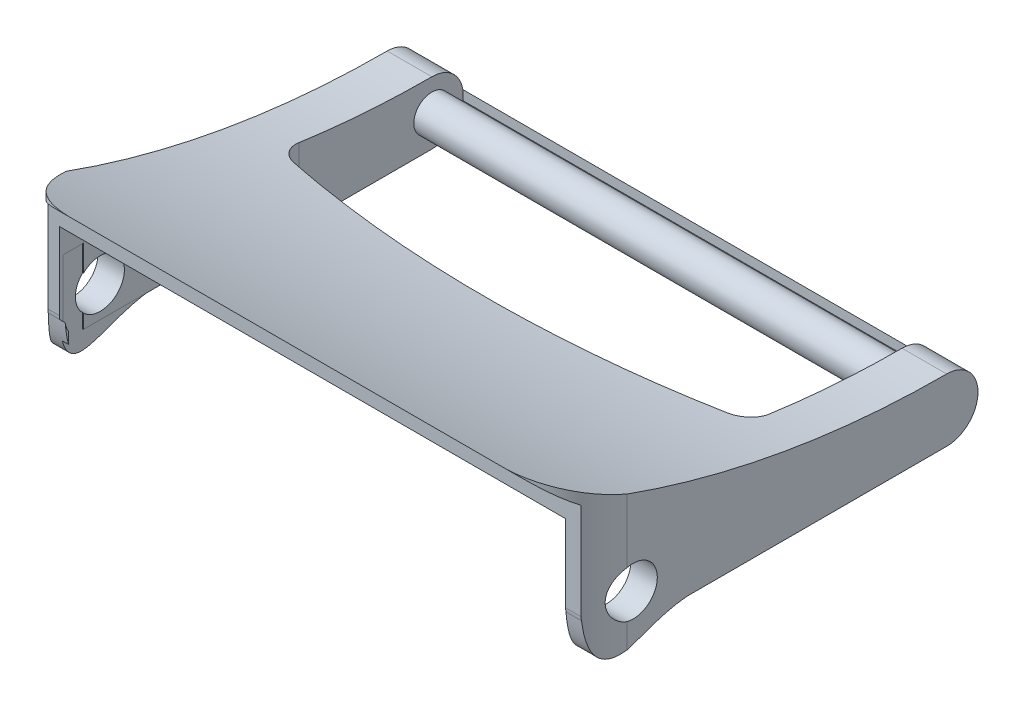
ISO-10303-21;
HEADER;
FILE_DESCRIPTION(('STEP AP214'),'2;1');
FILE_NAME('part.step','',(''),(''),'','','');
FILE_SCHEMA(('AUTOMOTIVE_DESIGN { 1 0 10303 214 1 1 1 1 }'));
ENDSEC;
DATA;
#1=APPLICATION_CONTEXT('core data for automotive mechanical design processes');
#2=APPLICATION_PROTOCOL_DEFINITION('international standard','automotive_design',2000,#1);
#3=PRODUCT_CONTEXT('',#1,'mechanical');
#4=PRODUCT('Part','Part','',(#3));
#5=PRODUCT_RELATED_PRODUCT_CATEGORY('part','',(#4));
#6=PRODUCT_DEFINITION_FORMATION('','',#4);
#7=PRODUCT_DEFINITION_CONTEXT('part definition',#1,'design');
#8=PRODUCT_DEFINITION('design','',#6,#7);
#9=PRODUCT_DEFINITION_SHAPE('','',#8);
#10=(LENGTH_UNIT() NAMED_UNIT(*) SI_UNIT(.MILLI.,.METRE.));
#11=(NAMED_UNIT(*) PLANE_ANGLE_UNIT() SI_UNIT($,.RADIAN.));
#12=(NAMED_UNIT(*) SI_UNIT($,.STERADIAN.) SOLID_ANGLE_UNIT());
#13=UNCERTAINTY_MEASURE_WITH_UNIT(LENGTH_MEASURE(1.E-05),#10,'distance_accuracy_value','');
#14=(GEOMETRIC_REPRESENTATION_CONTEXT(3) GLOBAL_UNCERTAINTY_ASSIGNED_CONTEXT((#13)) GLOBAL_UNIT_ASSIGNED_CONTEXT((#10,
#11,#12)) REPRESENTATION_CONTEXT('',''));
#15=CARTESIAN_POINT('',(0.,0.,0.));
#16=DIRECTION('',(0.,0.,1.));
#17=DIRECTION('',(1.,0.,0.));
#18=AXIS2_PLACEMENT_3D('',#15,#16,#17);
#19=CARTESIAN_POINT('',(116.,-13.8967209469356,49.8598706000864));
#20=CARTESIAN_POINT('',(116.,-12.5938648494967,64.9755858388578));
#21=CARTESIAN_POINT('',(116.,-30.3508177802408,74.130319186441));
#22=CARTESIAN_POINT('',(116.,1.10327905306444,72.7765396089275));
#23=B_SPLINE_CURVE_WITH_KNOTS('',3,(#19,#20,#21,#22),.UNSPECIFIED.,.F.,.F.,(4,4),(0.,1.),.UNSPECIFIED.);
#24=DIRECTION('',(-1.,0.,0.));
#25=VECTOR('',#24,1.);
#26=SURFACE_OF_LINEAR_EXTRUSION('',#23,#25);
#27=CARTESIAN_POINT('',(0.,-17.4200758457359,65.9185835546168));
#28=CARTESIAN_POINT('',(0.0283738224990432,-17.4426131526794,66.0073854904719));
#29=CARTESIAN_POINT('',(0.0571324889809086,-17.464321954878,66.0962739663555));
#30=CARTESIAN_POINT('',(0.115456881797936,-17.5058301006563,66.2742520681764));
#31=CARTESIAN_POINT('',(0.145022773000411,-17.5256290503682,66.3633417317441));
#32=CARTESIAN_POINT('',(0.235179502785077,-17.5818998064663,66.6315240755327));
#33=CARTESIAN_POINT('',(0.297031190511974,-17.6150840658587,66.8109084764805));
#34=CARTESIAN_POINT('',(0.425726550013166,-17.6707320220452,67.1743783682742));
#35=CARTESIAN_POINT('',(0.492652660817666,-17.6929296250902,67.3584765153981));
#36=CARTESIAN_POINT('',(0.630146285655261,-17.7218742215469,67.7263691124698));
#37=CARTESIAN_POINT('',(0.700708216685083,-17.7286442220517,67.9101636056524));
#38=CARTESIAN_POINT('',(0.815881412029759,-17.723782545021,68.2018990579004));
#39=CARTESIAN_POINT('',(0.85941245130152,-17.7184998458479,68.3103756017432));
#40=CARTESIAN_POINT('',(0.947497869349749,-17.700029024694,68.5262736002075));
#41=CARTESIAN_POINT('',(0.992052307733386,-17.6868404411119,68.6336949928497));
#42=CARTESIAN_POINT('',(1.08162062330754,-17.6517441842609,68.8461058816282));
#43=CARTESIAN_POINT('',(1.12662972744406,-17.6298929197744,68.9511065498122));
#44=CARTESIAN_POINT('',(1.21699449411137,-17.5767059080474,69.1585181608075));
#45=CARTESIAN_POINT('',(1.26235006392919,-17.5453726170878,69.2609297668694));
#46=CARTESIAN_POINT('',(1.3535349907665,-17.472233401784,69.4635697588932));
#47=CARTESIAN_POINT('',(1.39936262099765,-17.4302936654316,69.5637509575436));
#48=CARTESIAN_POINT('',(1.49029952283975,-17.3360488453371,69.7594614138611));
#49=CARTESIAN_POINT('',(1.53540882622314,-17.2837442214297,69.8549908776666));
#50=CARTESIAN_POINT('',(1.62437143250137,-17.169066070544,70.0405974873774));
#51=CARTESIAN_POINT('',(1.66822326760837,-17.1066812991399,70.1306683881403));
#52=CARTESIAN_POINT('',(1.75410139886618,-16.9726764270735,70.3045880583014));
#53=CARTESIAN_POINT('',(1.79612750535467,-16.90105536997,70.3884361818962));
#54=CARTESIAN_POINT('',(1.88147197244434,-16.7431686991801,70.5564798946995));
#55=CARTESIAN_POINT('',(1.92459266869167,-16.6561741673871,70.6400900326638));
#56=CARTESIAN_POINT('',(2.00792898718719,-16.4741278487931,70.7995645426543));
#57=CARTESIAN_POINT('',(2.04814418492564,-16.3790748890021,70.8754277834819));
#58=CARTESIAN_POINT('',(2.16439728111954,-16.0837441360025,71.0921293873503));
#59=CARTESIAN_POINT('',(2.2359451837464,-15.8734800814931,71.2218900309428));
#60=CARTESIAN_POINT('',(2.33970569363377,-15.5291274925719,71.4065549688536));
#61=CARTESIAN_POINT('',(2.37575701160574,-15.4004300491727,71.4699086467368));
#62=CARTESIAN_POINT('',(2.44441657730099,-15.1386670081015,71.5893352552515));
#63=CARTESIAN_POINT('',(2.47702251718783,-15.0055985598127,71.6454033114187));
#64=CARTESIAN_POINT('',(2.53905802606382,-14.7361979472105,71.7511032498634));
#65=CARTESIAN_POINT('',(2.56848660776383,-14.5998647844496,71.8007331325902));
#66=CARTESIAN_POINT('',(2.63867488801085,-14.2548815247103,71.9181368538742));
#67=CARTESIAN_POINT('',(2.67760600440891,-14.0446426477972,71.9823369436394));
#68=CARTESIAN_POINT('',(2.74987287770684,-13.6203034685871,72.1003050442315));
#69=CARTESIAN_POINT('',(2.78320673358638,-13.4062018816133,72.1540695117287));
#70=CARTESIAN_POINT('',(2.84210964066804,-12.9958879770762,72.248252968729));
#71=CARTESIAN_POINT('',(2.86811595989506,-12.7999156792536,72.2894555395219));
#72=CARTESIAN_POINT('',(2.91668132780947,-12.4063450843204,72.3658738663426));
#73=CARTESIAN_POINT('',(2.93923952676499,-12.2087463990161,72.4010881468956));
#74=CARTESIAN_POINT('',(2.9813219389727,-11.8123155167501,72.466393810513));
#75=CARTESIAN_POINT('',(3.00084501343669,-11.6134828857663,72.4964832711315));
#76=CARTESIAN_POINT('',(3.03680368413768,-11.2192420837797,72.5516225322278));
#77=CARTESIAN_POINT('',(3.05329664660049,-11.0238522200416,72.5767667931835));
#78=CARTESIAN_POINT('',(3.08397224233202,-10.6325476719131,72.6233345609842));
#79=CARTESIAN_POINT('',(3.09815595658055,-10.4366332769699,72.6447598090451));
#80=CARTESIAN_POINT('',(3.12443552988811,-10.0445835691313,72.6843082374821));
#81=CARTESIAN_POINT('',(3.13653402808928,-9.84844885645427,72.7024355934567));
#82=CARTESIAN_POINT('',(3.14771411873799,-9.65215149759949,72.7191426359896));
#83=B_SPLINE_CURVE_WITH_KNOTS('',3,(#27,#28,#29,#30,#31,#32,#33,#34,#35,#36,#37,#38,#39,#40,#41,
#42,#43,#44,#45,#46,#47,#48,#49,#50,#51,#52,#53,#54,#55,#56,#57,#58,#59,#60,#61,#62,#63,#64,#65,
#66,#67,#68,#69,#70,#71,#72,#73,#74,#75,#76,#77,#78,#79,#80,#81,#82),.UNSPECIFIED.,.F.,.F.,(4,2,
2,2,2,2,2,2,2,2,2,2,2,2,2,2,2,2,2,2,2,2,2,2,2,2,2,4),(0.,0.287722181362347,0.575503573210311,
1.15308093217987,1.74403526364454,2.33410773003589,2.68489252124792,3.03569779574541,
3.38425529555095,3.73272258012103,4.08582695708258,4.43891567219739,4.79240101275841,
5.14592298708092,5.52972685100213,5.91358667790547,6.68214368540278,7.12566910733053,
7.56948975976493,8.01344792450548,8.68270548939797,9.35218989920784,9.95786142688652,
10.5636819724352,11.1697292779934,11.7627438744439,12.3554800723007,12.9474604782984),.UNSPECIFIED.);
#84=CARTESIAN_POINT('',(0.,-17.4200758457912,65.9185835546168));
#85=VERTEX_POINT('',#84);
#86=CARTESIAN_POINT('',(3.147714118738,-9.65215149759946,72.7191426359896));
#87=VERTEX_POINT('',#86);
#88=EDGE_CURVE('E567',#85,#87,#83,.T.);
#89=ORIENTED_EDGE('',*,*,#88,.F.);
#90=CARTESIAN_POINT('',(0.,-13.8967209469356,49.8598706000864));
#91=CARTESIAN_POINT('',(0.,-12.5938648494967,64.9755858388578));
#92=CARTESIAN_POINT('',(0.,-30.3508177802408,74.130319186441));
#93=CARTESIAN_POINT('',(0.,1.10327905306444,72.7765396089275));
#94=B_SPLINE_CURVE_WITH_KNOTS('',3,(#90,#91,#92,#93),.UNSPECIFIED.,.F.,.F.,(4,4),(0.,1.),.UNSPECIFIED.);
#95=CARTESIAN_POINT('',(0.,-13.8967209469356,53.1621483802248));
#96=VERTEX_POINT('',#95);
#97=EDGE_CURVE('E574',#96,#85,#94,.T.);
#98=ORIENTED_EDGE('',*,*,#97,.F.);
#99=DIRECTION('',(-1.,0.,0.));
#100=VECTOR('',#99,1.);
#101=CARTESIAN_POINT('',(116.,-13.8967209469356,53.1621483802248));
#102=LINE('',#101,#100);
#103=CARTESIAN_POINT('',(5.32840696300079,-13.8967209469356,53.1621483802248));
#104=VERTEX_POINT('',#103);
#105=EDGE_CURVE('E584',#104,#96,#102,.T.);
#106=ORIENTED_EDGE('',*,*,#105,.F.);
#107=CARTESIAN_POINT('',(5.32840696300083,-13.8967209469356,49.8598706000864));
#108=CARTESIAN_POINT('',(5.32840696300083,-12.5938648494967,64.9755858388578));
#109=CARTESIAN_POINT('',(5.32840696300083,-30.3508177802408,74.130319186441));
#110=CARTESIAN_POINT('',(5.32840696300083,1.10327905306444,72.7765396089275));
#111=B_SPLINE_CURVE_WITH_KNOTS('',3,(#107,#108,#109,#110),.UNSPECIFIED.,.F.,.F.,(4,4),(0.,1.),.UNSPECIFIED.);
#112=CARTESIAN_POINT('',(5.32840696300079,-13.8967209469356,72.0232810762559));
#113=VERTEX_POINT('',#112);
#114=EDGE_CURVE('E1298',#113,#104,#111,.F.);
#115=ORIENTED_EDGE('',*,*,#114,.F.);
#116=DIRECTION('',(-1.,0.,0.));
#117=VECTOR('',#116,1.);
#118=CARTESIAN_POINT('',(116.,-13.8967209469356,72.0232810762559));
#119=LINE('',#118,#117);
#120=CARTESIAN_POINT('',(6.65999218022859,-13.8967209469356,72.0232810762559));
#121=VERTEX_POINT('',#120);
#122=EDGE_CURVE('E1293',#113,#121,#119,.F.);
#123=ORIENTED_EDGE('',*,*,#122,.T.);
#124=CARTESIAN_POINT('',(6.65999218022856,-13.8967209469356,49.8598706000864));
#125=CARTESIAN_POINT('',(6.65999218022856,-12.5938648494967,64.9755858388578));
#126=CARTESIAN_POINT('',(6.65999218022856,-30.3508177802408,74.130319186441));
#127=CARTESIAN_POINT('',(6.65999218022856,1.10327905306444,72.7765396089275));
#128=B_SPLINE_CURVE_WITH_KNOTS('',3,(#124,#125,#126,#127),.UNSPECIFIED.,.F.,.F.,(4,4),(0.,1.),.UNSPECIFIED.);
#129=CARTESIAN_POINT('',(6.65999218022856,-9.65215149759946,72.7191426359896));
#130=VERTEX_POINT('',#129);
#131=EDGE_CURVE('E823',#130,#121,#128,.F.);
#132=ORIENTED_EDGE('',*,*,#131,.F.);
#133=DIRECTION('',(-1.,0.,0.));
#134=VECTOR('',#133,1.);
#135=CARTESIAN_POINT('',(116.,-9.65215149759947,72.7191426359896));
#136=LINE('',#135,#134);
#137=CARTESIAN_POINT('',(5.50000000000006,-9.65215149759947,72.7191426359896));
#138=VERTEX_POINT('',#137);
#139=EDGE_CURVE('E601',#130,#138,#136,.T.);
#140=ORIENTED_EDGE('',*,*,#139,.T.);
#141=EDGE_CURVE('E576',#138,#87,#136,.T.);
#142=ORIENTED_EDGE('',*,*,#141,.T.);
#143=EDGE_LOOP('',(#89,#98,#106,#115,#123,#132,#140,#142));
#144=FACE_BOUND('',#143,.T.);
#145=ADVANCED_FACE('F35',(#144),#26,.T.);
#146=CARTESIAN_POINT('',(58.,7.1032790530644,61.318205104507));
#147=DIRECTION('',(0.,0.,-1.));
#148=DIRECTION('',(-1.,0.,0.));
#149=AXIS2_PLACEMENT_3D('',#146,#147,#148);
#150=PLANE('',#149);
#151=DIRECTION('',(-1.,0.,0.));
#152=VECTOR('',#151,1.);
#153=CARTESIAN_POINT('',(58.,5.49862275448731,61.318205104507));
#154=LINE('',#153,#152);
#155=CARTESIAN_POINT('',(110.5,5.49862275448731,61.318205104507));
#156=VERTEX_POINT('',#155);
#157=CARTESIAN_POINT('',(5.50000000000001,5.49862275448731,61.318205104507));
#158=VERTEX_POINT('',#157);
#159=EDGE_CURVE('E1299',#156,#158,#154,.T.);
#160=ORIENTED_EDGE('',*,*,#159,.F.);
#161=DIRECTION('',(0.,-1.,0.));
#162=VECTOR('',#161,1.);
#163=CARTESIAN_POINT('',(110.5,7.1032790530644,61.318205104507));
#164=LINE('',#163,#162);
#165=CARTESIAN_POINT('',(110.5,7.1032790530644,61.318205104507));
#166=VERTEX_POINT('',#165);
#167=EDGE_CURVE('E1498',#166,#156,#164,.T.);
#168=ORIENTED_EDGE('',*,*,#167,.F.);
#169=DIRECTION('',(1.,0.,0.));
#170=VECTOR('',#169,1.);
#171=CARTESIAN_POINT('',(58.,7.1032790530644,61.318205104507));
#172=LINE('',#171,#170);
#173=CARTESIAN_POINT('',(5.5,7.1032790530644,61.318205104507));
#174=VERTEX_POINT('',#173);
#175=EDGE_CURVE('E1487',#174,#166,#172,.T.);
#176=ORIENTED_EDGE('',*,*,#175,.F.);
#177=DIRECTION('',(0.,-1.,0.));
#178=VECTOR('',#177,1.);
#179=CARTESIAN_POINT('',(5.5,7.1032790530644,61.318205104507));
#180=LINE('',#179,#178);
#181=EDGE_CURVE('E1499',#174,#158,#180,.T.);
#182=ORIENTED_EDGE('',*,*,#181,.T.);
#183=EDGE_LOOP('',(#160,#168,#176,#182));
#184=FACE_BOUND('',#183,.T.);
#185=ADVANCED_FACE('F861',(#184),#150,.F.);
#186=CARTESIAN_POINT('',(116.,-8.8967209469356,67.7765396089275));
#187=DIRECTION('',(-1.,0.,0.));
#188=DIRECTION('',(0.,0.,1.));
#189=AXIS2_PLACEMENT_3D('',#186,#187,#188);
#190=CYLINDRICAL_SURFACE('',#189,5.);
#191=DIRECTION('',(-1.,0.,0.));
#192=VECTOR('',#191,1.);
#193=CARTESIAN_POINT('',(116.,-8.8967209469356,72.7765396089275));
#194=LINE('',#193,#192);
#195=CARTESIAN_POINT('',(5.50000000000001,-8.8967209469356,72.7765396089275));
#196=VERTEX_POINT('',#195);
#197=CARTESIAN_POINT('',(3.18628278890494,-8.89672094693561,72.7765396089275));
#198=VERTEX_POINT('',#197);
#199=EDGE_CURVE('E470',#196,#198,#194,.T.);
#200=ORIENTED_EDGE('',*,*,#199,.T.);
#201=CARTESIAN_POINT('',(3.18628278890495,-8.89672094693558,72.7765396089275));
#202=CARTESIAN_POINT('',(3.18628318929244,-8.93898800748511,72.7765399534));
#203=CARTESIAN_POINT('',(3.18592125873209,-8.9812549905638,72.7760036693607));
#204=CARTESIAN_POINT('',(3.18447695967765,-9.06567163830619,72.7738623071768));
#205=CARTESIAN_POINT('',(3.18339591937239,-9.10782137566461,72.7722591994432));
#206=CARTESIAN_POINT('',(3.1805189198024,-9.19200381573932,72.7679905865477));
#207=CARTESIAN_POINT('',(3.17872361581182,-9.23403659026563,72.7653260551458));
#208=CARTESIAN_POINT('',(3.17442377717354,-9.31798492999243,72.7589394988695));
#209=CARTESIAN_POINT('',(3.17191924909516,-9.35990049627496,72.7552174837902));
#210=CARTESIAN_POINT('',(3.1662057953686,-9.44361564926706,72.7467184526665));
#211=CARTESIAN_POINT('',(3.16299622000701,-9.48541509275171,72.7419404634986));
#212=CARTESIAN_POINT('',(3.15587755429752,-9.56889867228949,72.7313303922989));
#213=CARTESIAN_POINT('',(3.15196719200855,-9.61058245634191,72.7254963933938));
#214=CARTESIAN_POINT('',(3.14771411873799,-9.65215149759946,72.7191426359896));
#215=B_SPLINE_CURVE_WITH_KNOTS('',3,(#201,#202,#203,#204,#205,#206,#207,#208,#209,#210,#211,
#212,#213,#214),.UNSPECIFIED.,.F.,.F.,(4,2,2,2,2,2,4),(0.,0.126796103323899,0.25335866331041,
0.379805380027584,0.506250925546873,0.632813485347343,0.759608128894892),.UNSPECIFIED.);
#216=EDGE_CURVE('E439',#198,#87,#215,.T.);
#217=ORIENTED_EDGE('',*,*,#216,.T.);
#218=ORIENTED_EDGE('',*,*,#141,.F.);
#219=CARTESIAN_POINT('',(5.50000000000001,-8.8967209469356,67.7765396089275));
#220=DIRECTION('',(-1.,0.,0.));
#221=DIRECTION('',(0.,0.,1.));
#222=AXIS2_PLACEMENT_3D('',#219,#220,#221);
#223=CIRCLE('',#222,5.);
#224=EDGE_CURVE('E628',#138,#196,#223,.T.);
#225=ORIENTED_EDGE('',*,*,#224,.T.);
#226=EDGE_LOOP('',(#200,#217,#218,#225));
#227=FACE_BOUND('',#226,.T.);
#228=ADVANCED_FACE('F864',(#227),#190,.T.);
#229=CARTESIAN_POINT('',(113.724595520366,-9.65215149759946,72.7191426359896));
#230=VERTEX_POINT('',#229);
#231=CARTESIAN_POINT('',(110.5,-9.65215149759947,72.7191426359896));
#232=VERTEX_POINT('',#231);
#233=EDGE_CURVE('E595',#230,#232,#136,.T.);
#234=ORIENTED_EDGE('',*,*,#233,.F.);
#235=CARTESIAN_POINT('',(113.724595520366,-9.65215149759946,72.7191426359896));
#236=CARTESIAN_POINT('',(113.721011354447,-9.61054725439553,72.725501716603));
#237=CARTESIAN_POINT('',(113.717715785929,-9.56883818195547,72.7313387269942));
#238=CARTESIAN_POINT('',(113.711715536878,-9.48531418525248,72.7419526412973));
#239=CARTESIAN_POINT('',(113.709009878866,-9.44349955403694,72.7467312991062));
#240=CARTESIAN_POINT('',(113.70419314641,-9.35976433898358,72.7552302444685));
#241=CARTESIAN_POINT('',(113.70208157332,-9.31784387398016,72.7589514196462));
#242=CARTESIAN_POINT('',(113.698456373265,-9.23389632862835,72.7653355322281));
#243=CARTESIAN_POINT('',(113.696942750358,-9.19186924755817,72.7679984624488));
#244=CARTESIAN_POINT('',(113.694517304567,-9.10770868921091,72.7722638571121));
#245=CARTESIAN_POINT('',(113.693605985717,-9.06557515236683,72.7738654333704));
#246=CARTESIAN_POINT('',(113.692388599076,-8.98120145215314,72.7760043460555));
#247=CARTESIAN_POINT('',(113.69208355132,-8.93896122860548,72.7765398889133));
#248=CARTESIAN_POINT('',(113.692083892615,-8.89672094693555,72.7765396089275));
#249=B_SPLINE_CURVE_WITH_KNOTS('',3,(#235,#236,#237,#238,#239,#240,#241,#242,#243,#244,#245,
#246,#247,#248),.UNSPECIFIED.,.F.,.F.,(4,2,2,2,2,2,4),(0.,0.126715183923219,0.25321877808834,
0.379615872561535,0.506013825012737,0.632517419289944,0.75923367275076),.UNSPECIFIED.);
#250=CARTESIAN_POINT('',(113.692083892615,-8.89672094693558,72.7765396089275));
#251=VERTEX_POINT('',#250);
#252=EDGE_CURVE('E805',#230,#251,#249,.T.);
#253=ORIENTED_EDGE('',*,*,#252,.T.);
#254=CARTESIAN_POINT('',(110.5,-8.8967209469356,72.7765396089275));
#255=VERTEX_POINT('',#254);
#256=EDGE_CURVE('E467',#251,#255,#194,.T.);
#257=ORIENTED_EDGE('',*,*,#256,.T.);
#258=CARTESIAN_POINT('',(110.5,-8.8967209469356,67.7765396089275));
#259=DIRECTION('',(1.,0.,0.));
#260=DIRECTION('',(0.,0.,-1.));
#261=AXIS2_PLACEMENT_3D('',#258,#259,#260);
#262=CIRCLE('',#261,5.);
#263=EDGE_CURVE('E624',#255,#232,#262,.T.);
#264=ORIENTED_EDGE('',*,*,#263,.T.);
#265=EDGE_LOOP('',(#234,#253,#257,#264));
#266=FACE_BOUND('',#265,.T.);
#267=ADVANCED_FACE('F37',(#266),#190,.T.);
#268=CARTESIAN_POINT('',(116.,-13.8967209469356,67.7765396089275));
#269=DIRECTION('',(0.,1.,0.));
#270=DIRECTION('',(0.,0.,1.));
#271=AXIS2_PLACEMENT_3D('',#268,#269,#270);
#272=PLANE('',#271);
#273=DIRECTION('',(0.,0.,-1.));
#274=VECTOR('',#273,1.);
#275=CARTESIAN_POINT('',(5.50000000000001,-13.8967209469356,79.0215376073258));
#276=LINE('',#275,#274);
#277=CARTESIAN_POINT('',(5.50000000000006,-13.8967209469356,67.7765396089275));
#278=VERTEX_POINT('',#277);
#279=CARTESIAN_POINT('',(5.50000000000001,-13.8967209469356,49.8598706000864));
#280=VERTEX_POINT('',#279);
#281=EDGE_CURVE('E608',#278,#280,#276,.T.);
#282=ORIENTED_EDGE('',*,*,#281,.F.);
#283=DIRECTION('',(1.,0.,0.));
#284=VECTOR('',#283,1.);
#285=CARTESIAN_POINT('',(5.32840696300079,-13.8967209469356,67.7765396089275));
#286=LINE('',#285,#284);
#287=CARTESIAN_POINT('',(5.32840696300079,-13.8967209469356,67.7765396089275));
#288=VERTEX_POINT('',#287);
#289=EDGE_CURVE('E1647',#288,#278,#286,.T.);
#290=ORIENTED_EDGE('',*,*,#289,.F.);
#291=DIRECTION('',(0.,0.,1.));
#292=VECTOR('',#291,1.);
#293=CARTESIAN_POINT('',(5.32840696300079,-13.8967209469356,49.8598706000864));
#294=LINE('',#293,#292);
#295=EDGE_CURVE('E1349',#104,#288,#294,.T.);
#296=ORIENTED_EDGE('',*,*,#295,.F.);
#297=ORIENTED_EDGE('',*,*,#105,.T.);
#298=DIRECTION('',(0.,0.,-1.));
#299=VECTOR('',#298,1.);
#300=CARTESIAN_POINT('',(0.,-13.8967209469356,67.7765396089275));
#301=LINE('',#300,#299);
#302=CARTESIAN_POINT('',(0.,-13.8967209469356,-0.723460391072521));
#303=VERTEX_POINT('',#302);
#304=EDGE_CURVE('E463',#96,#303,#301,.T.);
#305=ORIENTED_EDGE('',*,*,#304,.T.);
#306=DIRECTION('',(-1.,0.,0.));
#307=VECTOR('',#306,1.);
#308=CARTESIAN_POINT('',(116.,-13.8967209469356,-0.723460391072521));
#309=LINE('',#308,#307);
#310=CARTESIAN_POINT('',(9.25,-13.8967209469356,-0.723460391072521));
#311=VERTEX_POINT('',#310);
#312=EDGE_CURVE('E478',#311,#303,#309,.T.);
#313=ORIENTED_EDGE('',*,*,#312,.F.);
#314=DIRECTION('',(0.,0.,-1.));
#315=VECTOR('',#314,1.);
#316=CARTESIAN_POINT('',(9.25,-13.8967209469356,-7.14765212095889));
#317=LINE('',#316,#315);
#318=CARTESIAN_POINT('',(9.25,-13.8967209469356,26.8523478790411));
#319=VERTEX_POINT('',#318);
#320=EDGE_CURVE('E673',#319,#311,#317,.T.);
#321=ORIENTED_EDGE('',*,*,#320,.F.);
#322=CARTESIAN_POINT('',(14.25,-13.8967209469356,26.8523478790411));
#323=DIRECTION('',(0.,-1.,0.));
#324=DIRECTION('',(0.,0.,-1.));
#325=AXIS2_PLACEMENT_3D('',#322,#323,#324);
#326=CIRCLE('',#325,5.00000000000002);
#327=CARTESIAN_POINT('',(13.1015528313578,-13.8967209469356,31.7186677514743));
#328=VERTEX_POINT('',#327);
#329=EDGE_CURVE('E670',#328,#319,#326,.T.);
#330=ORIENTED_EDGE('',*,*,#329,.F.);
#331=CARTESIAN_POINT('',(58.,-13.8967209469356,-158.529705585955));
#332=DIRECTION('',(0.,-1.,0.));
#333=DIRECTION('',(0.,0.,1.));
#334=AXIS2_PLACEMENT_3D('',#331,#332,#333);
#335=CIRCLE('',#334,195.474586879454);
#336=CARTESIAN_POINT('',(15.5000000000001,-13.8967209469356,32.2687852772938));
#337=VERTEX_POINT('',#336);
#338=EDGE_CURVE('E666',#337,#328,#335,.T.);
#339=ORIENTED_EDGE('',*,*,#338,.F.);
#340=DIRECTION('',(0.,0.,-1.));
#341=VECTOR('',#340,1.);
#342=CARTESIAN_POINT('',(15.5,-13.8967209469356,46.944881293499));
#343=LINE('',#342,#341);
#344=CARTESIAN_POINT('',(15.5,-13.8967209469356,46.944881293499));
#345=VERTEX_POINT('',#344);
#346=EDGE_CURVE('E632',#345,#337,#343,.T.);
#347=ORIENTED_EDGE('',*,*,#346,.F.);
#348=DIRECTION('',(-1.,0.,0.));
#349=VECTOR('',#348,1.);
#350=CARTESIAN_POINT('',(58.,-13.8967209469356,46.944881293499));
#351=LINE('',#350,#349);
#352=CARTESIAN_POINT('',(100.5,-13.8967209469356,46.944881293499));
#353=VERTEX_POINT('',#352);
#354=EDGE_CURVE('E637',#353,#345,#351,.T.);
#355=ORIENTED_EDGE('',*,*,#354,.F.);
#356=DIRECTION('',(0.,0.,1.));
#357=VECTOR('',#356,1.);
#358=CARTESIAN_POINT('',(100.5,-13.8967209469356,46.944881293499));
#359=LINE('',#358,#357);
#360=CARTESIAN_POINT('',(100.5,-13.8967209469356,32.2687852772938));
#361=VERTEX_POINT('',#360);
#362=EDGE_CURVE('E647',#361,#353,#359,.T.);
#363=ORIENTED_EDGE('',*,*,#362,.F.);
#364=CARTESIAN_POINT('',(102.898447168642,-13.8967209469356,31.7186677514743));
#365=VERTEX_POINT('',#364);
#366=EDGE_CURVE('E667',#365,#361,#335,.T.);
#367=ORIENTED_EDGE('',*,*,#366,.F.);
#368=CARTESIAN_POINT('',(101.75,-13.8967209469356,26.8523478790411));
#369=DIRECTION('',(0.,-1.,0.));
#370=DIRECTION('',(0.,0.,1.));
#371=AXIS2_PLACEMENT_3D('',#368,#369,#370);
#372=CIRCLE('',#371,5.00000000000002);
#373=CARTESIAN_POINT('',(106.75,-13.8967209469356,26.8523478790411));
#374=VERTEX_POINT('',#373);
#375=EDGE_CURVE('E663',#374,#365,#372,.T.);
#376=ORIENTED_EDGE('',*,*,#375,.F.);
#377=DIRECTION('',(0.,0.,1.));
#378=VECTOR('',#377,1.);
#379=CARTESIAN_POINT('',(106.75,-13.8967209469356,-7.14765212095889));
#380=LINE('',#379,#378);
#381=CARTESIAN_POINT('',(106.75,-13.8967209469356,-0.723460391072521));
#382=VERTEX_POINT('',#381);
#383=EDGE_CURVE('E653',#382,#374,#380,.T.);
#384=ORIENTED_EDGE('',*,*,#383,.F.);
#385=CARTESIAN_POINT('',(116.,-13.8967209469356,-0.723460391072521));
#386=VERTEX_POINT('',#385);
#387=EDGE_CURVE('E479',#386,#382,#309,.T.);
#388=ORIENTED_EDGE('',*,*,#387,.F.);
#389=DIRECTION('',(0.,0.,-1.));
#390=VECTOR('',#389,1.);
#391=CARTESIAN_POINT('',(116.,-13.8967209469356,67.7765396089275));
#392=LINE('',#391,#390);
#393=CARTESIAN_POINT('',(116.,-13.8967209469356,53.1621483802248));
#394=VERTEX_POINT('',#393);
#395=EDGE_CURVE('E458',#394,#386,#392,.T.);
#396=ORIENTED_EDGE('',*,*,#395,.F.);
#397=CARTESIAN_POINT('',(110.5,-13.8967209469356,53.1621483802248));
#398=VERTEX_POINT('',#397);
#399=EDGE_CURVE('E602',#394,#398,#102,.T.);
#400=ORIENTED_EDGE('',*,*,#399,.T.);
#401=DIRECTION('',(0.,0.,1.));
#402=VECTOR('',#401,1.);
#403=CARTESIAN_POINT('',(110.5,-13.8967209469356,49.8598706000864));
#404=LINE('',#403,#402);
#405=CARTESIAN_POINT('',(110.5,-13.8967209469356,49.8598706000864));
#406=VERTEX_POINT('',#405);
#407=EDGE_CURVE('E617',#406,#398,#404,.T.);
#408=ORIENTED_EDGE('',*,*,#407,.F.);
#409=DIRECTION('',(1.,0.,0.));
#410=VECTOR('',#409,1.);
#411=CARTESIAN_POINT('',(58.,-13.8967209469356,49.8598706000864));
#412=LINE('',#411,#410);
#413=EDGE_CURVE('E600',#280,#406,#412,.T.);
#414=ORIENTED_EDGE('',*,*,#413,.F.);
#415=EDGE_LOOP('',(#282,#290,#296,#297,#305,#313,#321,#330,#339,#347,#355,#363,#367,#376,#384,
#388,#396,#400,#408,#414));
#416=FACE_BOUND('',#415,.T.);
#417=DIRECTION('',(-1.,0.,0.));
#418=VECTOR('',#417,1.);
#419=CARTESIAN_POINT('',(8.28748522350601,-13.8967209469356,19.4021773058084));
#420=LINE('',#419,#418);
#421=CARTESIAN_POINT('',(8.287485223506,-13.8967209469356,19.4021773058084));
#422=VERTEX_POINT('',#421);
#423=CARTESIAN_POINT('',(2.07342087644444,-13.8967209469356,19.4021773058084));
#424=VERTEX_POINT('',#423);
#425=EDGE_CURVE('E1429',#422,#424,#420,.T.);
#426=ORIENTED_EDGE('',*,*,#425,.F.);
#427=DIRECTION('',(0.,0.,1.));
#428=VECTOR('',#427,1.);
#429=CARTESIAN_POINT('',(8.28748522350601,-13.8967209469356,1.2038460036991));
#430=LINE('',#429,#428);
#431=CARTESIAN_POINT('',(8.28748522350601,-13.8967209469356,1.2038460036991));
#432=VERTEX_POINT('',#431);
#433=EDGE_CURVE('E1413',#432,#422,#430,.T.);
#434=ORIENTED_EDGE('',*,*,#433,.F.);
#435=DIRECTION('',(1.,0.,0.));
#436=VECTOR('',#435,1.);
#437=CARTESIAN_POINT('',(8.28748522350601,-13.8967209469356,1.2038460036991));
#438=LINE('',#437,#436);
#439=CARTESIAN_POINT('',(2.07342087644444,-13.8967209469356,1.2038460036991));
#440=VERTEX_POINT('',#439);
#441=EDGE_CURVE('E1418',#440,#432,#438,.T.);
#442=ORIENTED_EDGE('',*,*,#441,.F.);
#443=DIRECTION('',(0.,0.,-1.));
#444=VECTOR('',#443,1.);
#445=CARTESIAN_POINT('',(2.07342087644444,-13.8967209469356,1.2038460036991));
#446=LINE('',#445,#444);
#447=EDGE_CURVE('E1432',#424,#440,#446,.T.);
#448=ORIENTED_EDGE('',*,*,#447,.F.);
#449=EDGE_LOOP('',(#426,#434,#442,#448));
#450=FACE_BOUND('',#449,.T.);
#451=DIRECTION('',(-1.,0.,0.));
#452=VECTOR('',#451,1.);
#453=CARTESIAN_POINT('',(114.518394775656,-13.8967209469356,18.8103616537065));
#454=LINE('',#453,#452);
#455=CARTESIAN_POINT('',(114.518394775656,-13.8967209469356,18.8103616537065));
#456=VERTEX_POINT('',#455);
#457=CARTESIAN_POINT('',(108.600238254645,-13.8967209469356,18.8103616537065));
#458=VERTEX_POINT('',#457);
#459=EDGE_CURVE('E1461',#456,#458,#454,.T.);
#460=ORIENTED_EDGE('',*,*,#459,.F.);
#461=DIRECTION('',(0.,0.,1.));
#462=VECTOR('',#461,1.);
#463=CARTESIAN_POINT('',(114.518394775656,-13.8967209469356,1.35179991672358));
#464=LINE('',#463,#462);
#465=CARTESIAN_POINT('',(114.518394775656,-13.8967209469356,1.35179991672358));
#466=VERTEX_POINT('',#465);
#467=EDGE_CURVE('E1439',#466,#456,#464,.T.);
#468=ORIENTED_EDGE('',*,*,#467,.F.);
#469=DIRECTION('',(1.,0.,0.));
#470=VECTOR('',#469,1.);
#471=CARTESIAN_POINT('',(114.518394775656,-13.8967209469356,1.35179991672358));
#472=LINE('',#471,#470);
#473=CARTESIAN_POINT('',(108.600238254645,-13.8967209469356,1.35179991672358));
#474=VERTEX_POINT('',#473);
#475=EDGE_CURVE('E1450',#474,#466,#472,.T.);
#476=ORIENTED_EDGE('',*,*,#475,.F.);
#477=DIRECTION('',(0.,0.,-1.));
#478=VECTOR('',#477,1.);
#479=CARTESIAN_POINT('',(108.600238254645,-13.8967209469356,1.35179991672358));
#480=LINE('',#479,#478);
#481=EDGE_CURVE('E1464',#458,#474,#480,.T.);
#482=ORIENTED_EDGE('',*,*,#481,.F.);
#483=EDGE_LOOP('',(#460,#468,#476,#482));
#484=FACE_BOUND('',#483,.T.);
#485=DIRECTION('',(1.,0.,0.));
#486=VECTOR('',#485,1.);
#487=CARTESIAN_POINT('',(114.518394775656,-13.8967209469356,20.5858086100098));
#488=LINE('',#487,#486);
#489=CARTESIAN_POINT('',(108.600238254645,-13.8967209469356,20.5858086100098));
#490=VERTEX_POINT('',#489);
#491=CARTESIAN_POINT('',(114.518394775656,-13.8967209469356,20.5858086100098));
#492=VERTEX_POINT('',#491);
#493=EDGE_CURVE('E1362',#490,#492,#488,.T.);
#494=ORIENTED_EDGE('',*,*,#493,.F.);
#495=DIRECTION('',(0.,0.,-1.));
#496=VECTOR('',#495,1.);
#497=CARTESIAN_POINT('',(108.600238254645,-13.8967209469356,20.5858086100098));
#498=LINE('',#497,#496);
#499=CARTESIAN_POINT('',(108.600238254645,-13.8967209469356,32.865983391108));
#500=VERTEX_POINT('',#499);
#501=EDGE_CURVE('E1370',#500,#490,#498,.T.);
#502=ORIENTED_EDGE('',*,*,#501,.F.);
#503=DIRECTION('',(1.,0.,0.));
#504=VECTOR('',#503,1.);
#505=CARTESIAN_POINT('',(109.340007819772,-13.8967209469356,32.865983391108));
#506=LINE('',#505,#504);
#507=CARTESIAN_POINT('',(103.421851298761,-13.8967209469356,32.865983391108));
#508=VERTEX_POINT('',#507);
#509=EDGE_CURVE('E1509',#508,#500,#506,.T.);
#510=ORIENTED_EDGE('',*,*,#509,.F.);
#511=DIRECTION('',(0.,0.,-1.));
#512=VECTOR('',#511,1.);
#513=CARTESIAN_POINT('',(103.421851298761,-13.8967209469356,32.865983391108));
#514=LINE('',#513,#512);
#515=CARTESIAN_POINT('',(103.421851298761,-13.8967209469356,45.8859277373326));
#516=VERTEX_POINT('',#515);
#517=EDGE_CURVE('E1517',#516,#508,#514,.T.);
#518=ORIENTED_EDGE('',*,*,#517,.F.);
#519=DIRECTION('',(-1.,0.,0.));
#520=VECTOR('',#519,1.);
#521=CARTESIAN_POINT('',(109.340007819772,-13.8967209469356,45.8859277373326));
#522=LINE('',#521,#520);
#523=CARTESIAN_POINT('',(114.518394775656,-13.8967209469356,45.8859277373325));
#524=VERTEX_POINT('',#523);
#525=EDGE_CURVE('E1502',#524,#516,#522,.T.);
#526=ORIENTED_EDGE('',*,*,#525,.F.);
#527=DIRECTION('',(0.,0.,1.));
#528=VECTOR('',#527,1.);
#529=CARTESIAN_POINT('',(114.518394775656,-13.8967209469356,20.5858086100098));
#530=LINE('',#529,#528);
#531=EDGE_CURVE('E1352',#492,#524,#530,.T.);
#532=ORIENTED_EDGE('',*,*,#531,.F.);
#533=EDGE_LOOP('',(#494,#502,#510,#518,#526,#532));
#534=FACE_BOUND('',#533,.T.);
#535=DIRECTION('',(0.,0.,1.));
#536=VECTOR('',#535,1.);
#537=CARTESIAN_POINT('',(13.7617800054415,-13.8967209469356,33.1618912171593));
#538=LINE('',#537,#536);
#539=CARTESIAN_POINT('',(13.7617800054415,-13.8967209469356,33.1618912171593));
#540=VERTEX_POINT('',#539);
#541=CARTESIAN_POINT('',(13.7617800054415,-13.8967209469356,45.7379738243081));
#542=VERTEX_POINT('',#541);
#543=EDGE_CURVE('E1524',#540,#542,#538,.T.);
#544=ORIENTED_EDGE('',*,*,#543,.F.);
#545=DIRECTION('',(1.,0.,0.));
#546=VECTOR('',#545,1.);
#547=CARTESIAN_POINT('',(13.7617800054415,-13.8967209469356,33.1618912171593));
#548=LINE('',#547,#546);
#549=CARTESIAN_POINT('',(7.54771565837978,-13.8967209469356,33.1618912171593));
#550=VERTEX_POINT('',#549);
#551=EDGE_CURVE('E1531',#550,#540,#548,.T.);
#552=ORIENTED_EDGE('',*,*,#551,.F.);
#553=DIRECTION('',(0.,0.,1.));
#554=VECTOR('',#553,1.);
#555=CARTESIAN_POINT('',(7.54771565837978,-13.8967209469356,21.4735320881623));
#556=LINE('',#555,#554);
#557=CARTESIAN_POINT('',(7.54771565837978,-13.8967209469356,21.4735320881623));
#558=VERTEX_POINT('',#557);
#559=EDGE_CURVE('E1545',#558,#550,#556,.T.);
#560=ORIENTED_EDGE('',*,*,#559,.F.);
#561=DIRECTION('',(1.,0.,0.));
#562=VECTOR('',#561,1.);
#563=CARTESIAN_POINT('',(7.54771565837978,-13.8967209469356,21.4735320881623));
#564=LINE('',#563,#562);
#565=CARTESIAN_POINT('',(2.07342087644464,-13.8967209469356,21.4735320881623));
#566=VERTEX_POINT('',#565);
#567=EDGE_CURVE('E1550',#566,#558,#564,.T.);
#568=ORIENTED_EDGE('',*,*,#567,.F.);
#569=DIRECTION('',(0.,0.,-1.));
#570=VECTOR('',#569,1.);
#571=CARTESIAN_POINT('',(2.07342087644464,-13.8967209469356,21.4735320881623));
#572=LINE('',#571,#570);
#573=CARTESIAN_POINT('',(2.07342087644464,-13.8967209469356,45.7379738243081));
#574=VERTEX_POINT('',#573);
#575=EDGE_CURVE('E1562',#574,#566,#572,.T.);
#576=ORIENTED_EDGE('',*,*,#575,.F.);
#577=DIRECTION('',(-1.,0.,0.));
#578=VECTOR('',#577,1.);
#579=CARTESIAN_POINT('',(7.54771565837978,-13.8967209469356,45.7379738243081));
#580=LINE('',#579,#578);
#581=EDGE_CURVE('E1560',#542,#574,#580,.T.);
#582=ORIENTED_EDGE('',*,*,#581,.F.);
#583=EDGE_LOOP('',(#544,#552,#560,#568,#576,#582));
#584=FACE_BOUND('',#583,.T.);
#585=ADVANCED_FACE('F714',(#416,#450,#484,#534,#584),#272,.F.);
#586=CARTESIAN_POINT('',(116.,-7.3967209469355,-0.723460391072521));
#587=DIRECTION('',(-1.,0.,0.));
#588=DIRECTION('',(0.,0.,1.));
#589=AXIS2_PLACEMENT_3D('',#586,#587,#588);
#590=CYLINDRICAL_SURFACE('',#589,6.50000000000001);
#591=DIRECTION('',(-1.,0.,0.));
#592=VECTOR('',#591,1.);
#593=CARTESIAN_POINT('',(116.,-0.896720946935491,-0.723460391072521));
#594=LINE('',#593,#592);
#595=CARTESIAN_POINT('',(9.24999999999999,-0.896720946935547,-0.723460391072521));
#596=VERTEX_POINT('',#595);
#597=CARTESIAN_POINT('',(0.,-0.896720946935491,-0.723460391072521));
#598=VERTEX_POINT('',#597);
#599=EDGE_CURVE('E456',#596,#598,#594,.T.);
#600=ORIENTED_EDGE('',*,*,#599,.F.);
#601=CARTESIAN_POINT('',(9.24999999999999,-7.3967209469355,-0.723460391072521));
#602=DIRECTION('',(-1.,0.,0.));
#603=DIRECTION('',(0.,0.,1.));
#604=AXIS2_PLACEMENT_3D('',#601,#602,#603);
#605=CIRCLE('',#604,6.50000000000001);
#606=CARTESIAN_POINT('',(9.24999999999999,-6.40689236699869,-7.14765212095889));
#607=VERTEX_POINT('',#606);
#608=EDGE_CURVE('E693',#596,#607,#605,.T.);
#609=ORIENTED_EDGE('',*,*,#608,.T.);
#610=DIRECTION('',(-1.,0.,0.));
#611=VECTOR('',#610,1.);
#612=CARTESIAN_POINT('',(116.,-6.40689236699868,-7.14765212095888));
#613=LINE('',#612,#611);
#614=CARTESIAN_POINT('',(106.75,-6.40689236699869,-7.14765212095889));
#615=VERTEX_POINT('',#614);
#616=EDGE_CURVE('E1622',#607,#615,#613,.F.);
#617=ORIENTED_EDGE('',*,*,#616,.T.);
#618=CARTESIAN_POINT('',(106.75,-7.3967209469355,-0.723460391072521));
#619=DIRECTION('',(1.,0.,0.));
#620=DIRECTION('',(0.,0.,-1.));
#621=AXIS2_PLACEMENT_3D('',#618,#619,#620);
#622=CIRCLE('',#621,6.50000000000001);
#623=CARTESIAN_POINT('',(106.75,-0.896720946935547,-0.723460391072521));
#624=VERTEX_POINT('',#623);
#625=EDGE_CURVE('E679',#615,#624,#622,.T.);
#626=ORIENTED_EDGE('',*,*,#625,.T.);
#627=CARTESIAN_POINT('',(116.,-0.896720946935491,-0.723460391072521));
#628=VERTEX_POINT('',#627);
#629=EDGE_CURVE('E475',#628,#624,#594,.T.);
#630=ORIENTED_EDGE('',*,*,#629,.F.);
#631=CARTESIAN_POINT('',(116.,-7.3967209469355,-0.723460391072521));
#632=DIRECTION('',(1.,0.,0.));
#633=DIRECTION('',(0.,0.,-1.));
#634=AXIS2_PLACEMENT_3D('',#631,#632,#633);
#635=CIRCLE('',#634,6.50000000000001);
#636=EDGE_CURVE('E461',#386,#628,#635,.T.);
#637=ORIENTED_EDGE('',*,*,#636,.F.);
#638=ORIENTED_EDGE('',*,*,#387,.T.);
#639=CARTESIAN_POINT('',(106.75,-8.3865495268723,-7.14765212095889));
#640=VERTEX_POINT('',#639);
#641=EDGE_CURVE('E692',#382,#640,#622,.T.);
#642=ORIENTED_EDGE('',*,*,#641,.T.);
#643=DIRECTION('',(-1.,0.,0.));
#644=VECTOR('',#643,1.);
#645=CARTESIAN_POINT('',(116.,-8.38654952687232,-7.14765212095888));
#646=LINE('',#645,#644);
#647=CARTESIAN_POINT('',(9.24999999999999,-8.3865495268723,-7.14765212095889));
#648=VERTEX_POINT('',#647);
#649=EDGE_CURVE('E709',#640,#648,#646,.T.);
#650=ORIENTED_EDGE('',*,*,#649,.T.);
#651=EDGE_CURVE('E695',#648,#311,#605,.T.);
#652=ORIENTED_EDGE('',*,*,#651,.T.);
#653=ORIENTED_EDGE('',*,*,#312,.T.);
#654=CARTESIAN_POINT('',(0.,-7.3967209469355,-0.723460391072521));
#655=DIRECTION('',(1.,0.,0.));
#656=DIRECTION('',(0.,0.,-1.));
#657=AXIS2_PLACEMENT_3D('',#654,#655,#656);
#658=CIRCLE('',#657,6.50000000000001);
#659=EDGE_CURVE('E459',#303,#598,#658,.T.);
#660=ORIENTED_EDGE('',*,*,#659,.T.);
#661=EDGE_LOOP('',(#600,#609,#617,#626,#630,#637,#638,#642,#650,#652,#653,#660));
#662=FACE_BOUND('',#661,.T.);
#663=ADVANCED_FACE('F706',(#662),#590,.T.);
#664=CARTESIAN_POINT('',(116.,194.627091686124,-0.72060706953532));
#665=DIRECTION('',(-1.,0.,0.));
#666=DIRECTION('',(0.,0.,1.));
#667=AXIS2_PLACEMENT_3D('',#664,#665,#666);
#668=CYLINDRICAL_SURFACE('',#667,195.523812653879);
#669=CARTESIAN_POINT('',(0.,194.627091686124,-0.72060706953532));
#670=DIRECTION('',(-1.,0.,0.));
#671=DIRECTION('',(0.,0.,1.));
#672=AXIS2_PLACEMENT_3D('',#669,#670,#671);
#673=CIRCLE('',#672,195.523812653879);
#674=CARTESIAN_POINT('',(0.,10.8098466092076,65.9185835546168));
#675=VERTEX_POINT('',#674);
#676=EDGE_CURVE('E446',#598,#675,#673,.T.);
#677=ORIENTED_EDGE('',*,*,#676,.T.);
#678=CARTESIAN_POINT('',(0.,10.8098466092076,65.9185835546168));
#679=CARTESIAN_POINT('',(0.0672598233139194,10.8861584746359,66.1290823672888));
#680=CARTESIAN_POINT('',(0.13631992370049,10.9626469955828,66.338938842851));
#681=CARTESIAN_POINT('',(0.278244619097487,11.1159261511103,66.7572637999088));
#682=CARTESIAN_POINT('',(0.351109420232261,11.1927168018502,66.9657322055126));
#683=CARTESIAN_POINT('',(0.576268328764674,11.4240308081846,67.5904274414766));
#684=CARTESIAN_POINT('',(0.734624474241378,11.5789217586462,68.0043602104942));
#685=CARTESIAN_POINT('',(1.06947001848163,11.8892767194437,68.8253861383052));
#686=CARTESIAN_POINT('',(1.24598445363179,12.0447412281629,69.232468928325));
#687=CARTESIAN_POINT('',(1.62335213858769,12.3588581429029,70.0469504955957));
#688=CARTESIAN_POINT('',(1.82467580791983,12.5175006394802,70.4541366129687));
#689=CARTESIAN_POINT('',(2.2504528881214,12.8330543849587,71.2562979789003));
#690=CARTESIAN_POINT('',(2.47487904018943,12.9899674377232,71.6512869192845));
#691=CARTESIAN_POINT('',(2.94953862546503,13.3007092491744,72.4263570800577));
#692=CARTESIAN_POINT('',(3.19974979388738,13.4545405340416,72.8064507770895));
#693=CARTESIAN_POINT('',(3.60924135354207,13.6889314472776,73.3806199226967));
#694=CARTESIAN_POINT('',(3.75853453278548,13.7711967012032,73.5811573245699));
#695=CARTESIAN_POINT('',(4.06616586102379,13.9339080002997,73.9759807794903));
#696=CARTESIAN_POINT('',(4.22450448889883,14.0143539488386,74.1702665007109));
#697=CARTESIAN_POINT('',(4.5506081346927,14.1730063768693,74.5517457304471));
#698=CARTESIAN_POINT('',(4.71837364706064,14.2512127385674,74.738938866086));
#699=CARTESIAN_POINT('',(5.06260951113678,14.4044549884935,75.1042010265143));
#700=CARTESIAN_POINT('',(5.23902150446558,14.4795071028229,75.2823181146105));
#701=CARTESIAN_POINT('',(5.60169121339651,14.6264342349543,75.6296397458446));
#702=CARTESIAN_POINT('',(5.78794894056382,14.6983092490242,75.7988442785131));
#703=CARTESIAN_POINT('',(6.17039995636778,14.8383464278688,76.1272964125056));
#704=CARTESIAN_POINT('',(6.36659334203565,14.90650855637,76.2865439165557));
#705=CARTESIAN_POINT('',(6.77181153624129,15.0395394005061,76.5962811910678));
#706=CARTESIAN_POINT('',(6.98098319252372,15.1043445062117,76.7466066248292));
#707=CARTESIAN_POINT('',(7.40919632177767,15.2289798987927,77.0348008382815));
#708=CARTESIAN_POINT('',(7.62823838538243,15.288809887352,77.1726688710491));
#709=CARTESIAN_POINT('',(8.07565777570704,15.4029413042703,77.4349154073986));
#710=CARTESIAN_POINT('',(8.30403521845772,15.4572426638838,77.5592937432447));
#711=CARTESIAN_POINT('',(8.76965336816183,15.5598939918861,77.7938275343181));
#712=CARTESIAN_POINT('',(9.00690473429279,15.6082364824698,77.9039651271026));
#713=CARTESIAN_POINT('',(9.48902357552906,15.6985012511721,78.1091678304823));
#714=CARTESIAN_POINT('',(9.73389106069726,15.7404235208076,78.2042329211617));
#715=CARTESIAN_POINT('',(10.2300209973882,15.8175676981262,78.37885289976));
#716=CARTESIAN_POINT('',(10.481280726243,15.8527924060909,78.4584142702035));
#717=CARTESIAN_POINT('',(10.8985959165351,15.9051016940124,78.5763925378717));
#718=CARTESIAN_POINT('',(11.0631321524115,15.9241793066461,78.6193722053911));
#719=CARTESIAN_POINT('',(11.3940158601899,15.9595110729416,78.6989047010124));
#720=CARTESIAN_POINT('',(11.5603629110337,15.9757658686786,78.7354589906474));
#721=CARTESIAN_POINT('',(11.894565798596,16.005475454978,78.8022252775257));
#722=CARTESIAN_POINT('',(12.0624216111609,16.0189302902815,78.8324373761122));
#723=CARTESIAN_POINT('',(12.3991152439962,16.0430667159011,78.8866050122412));
#724=CARTESIAN_POINT('',(12.5679515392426,16.0537518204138,78.9105684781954));
#725=CARTESIAN_POINT('',(12.9065191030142,16.0724298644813,78.952441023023));
#726=CARTESIAN_POINT('',(13.0762503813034,16.0804227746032,78.9703500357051));
#727=CARTESIAN_POINT('',(13.4163041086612,16.0937925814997,79.0002976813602));
#728=CARTESIAN_POINT('',(13.5866264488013,16.0991699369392,79.0123373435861));
#729=CARTESIAN_POINT('',(13.7571231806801,16.1032790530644,79.0215376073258));
#730=B_SPLINE_CURVE_WITH_KNOTS('',3,(#678,#679,#680,#681,#682,#683,#684,#685,#686,#687,#688,
#689,#690,#691,#692,#693,#694,#695,#696,#697,#698,#699,#700,#701,#702,#703,#704,#705,#706,#707,
#708,#709,#710,#711,#712,#713,#714,#715,#716,#717,#718,#719,#720,#721,#722,#723,#724,#725,#726,
#727,#728,#729),.UNSPECIFIED.,.F.,.F.,(4,2,2,2,2,2,2,2,2,2,2,2,2,2,2,2,2,2,2,2,2,2,2,2,2,4),(0.,
0.701350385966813,1.40273880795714,2.81078768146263,4.22080465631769,5.66360095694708,
7.10471399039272,8.54459291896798,9.33397905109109,10.1234070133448,10.9128764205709,
11.6976023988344,12.4823292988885,13.2670638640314,14.0634032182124,14.8597902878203,
15.6561872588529,16.4535736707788,17.2509611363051,18.048014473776,18.5612463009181,
19.0743612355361,19.5874679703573,20.0999204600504,20.6123785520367,21.1247467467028),.UNSPECIFIED.);
#731=CARTESIAN_POINT('',(13.7571231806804,16.1032790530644,79.0215376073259));
#732=VERTEX_POINT('',#731);
#733=EDGE_CURVE('E434',#675,#732,#730,.T.);
#734=ORIENTED_EDGE('',*,*,#733,.T.);
#735=DIRECTION('',(-1.,0.,0.));
#736=VECTOR('',#735,1.);
#737=CARTESIAN_POINT('',(116.,16.1032790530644,79.0215376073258));
#738=LINE('',#737,#736);
#739=CARTESIAN_POINT('',(15.4999493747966,16.1032790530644,79.0215376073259));
#740=VERTEX_POINT('',#739);
#741=EDGE_CURVE('E56',#740,#732,#738,.T.);
#742=ORIENTED_EDGE('',*,*,#741,.F.);
#743=CARTESIAN_POINT('',(104.368639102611,16.1032790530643,79.0215376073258));
#744=VERTEX_POINT('',#743);
#745=EDGE_CURVE('E473',#744,#740,#738,.T.);
#746=ORIENTED_EDGE('',*,*,#745,.F.);
#747=CARTESIAN_POINT('',(104.368639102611,16.1032790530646,79.0215376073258));
#748=CARTESIAN_POINT('',(104.497067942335,16.1012253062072,79.0169390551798));
#749=CARTESIAN_POINT('',(104.62533063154,16.0977386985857,79.0091336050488));
#750=CARTESIAN_POINT('',(104.88121142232,16.0881095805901,78.9875691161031));
#751=CARTESIAN_POINT('',(105.008829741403,16.0819680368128,78.9738122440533));
#752=CARTESIAN_POINT('',(105.262991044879,16.0672493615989,78.9408286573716));
#753=CARTESIAN_POINT('',(105.389535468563,16.0586763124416,78.9216111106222));
#754=CARTESIAN_POINT('',(105.641560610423,16.039244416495,78.8780279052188));
#755=CARTESIAN_POINT('',(105.767041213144,16.0283853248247,78.8536616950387));
#756=CARTESIAN_POINT('',(106.140101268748,15.9927235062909,78.7735892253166));
#757=CARTESIAN_POINT('',(106.385872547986,15.9647418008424,78.7106978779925));
#758=CARTESIAN_POINT('',(106.87131173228,15.9010988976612,78.567392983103));
#759=CARTESIAN_POINT('',(107.110975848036,15.8654330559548,78.4869688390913));
#760=CARTESIAN_POINT('',(107.635214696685,15.778448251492,78.2903923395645));
#761=CARTESIAN_POINT('',(107.918023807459,15.7254118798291,78.1702720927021));
#762=CARTESIAN_POINT('',(108.47118696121,15.6100025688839,77.9080367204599));
#763=CARTESIAN_POINT('',(108.741541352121,15.547629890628,77.7659222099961));
#764=CARTESIAN_POINT('',(109.269173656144,15.4143873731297,77.4612043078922));
#765=CARTESIAN_POINT('',(109.526416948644,15.3434965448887,77.2985502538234));
#766=CARTESIAN_POINT('',(110.026082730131,15.1943263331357,76.9548661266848));
#767=CARTESIAN_POINT('',(110.268502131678,15.1160454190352,76.7738322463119));
#768=CARTESIAN_POINT('',(110.793377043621,14.9337430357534,76.3503128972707));
#769=CARTESIAN_POINT('',(111.071703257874,14.8280182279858,76.1034323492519));
#770=CARTESIAN_POINT('',(111.603688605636,14.6085216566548,75.5876776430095));
#771=CARTESIAN_POINT('',(111.8573429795,14.494748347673,75.3187992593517));
#772=CARTESIAN_POINT('',(112.339855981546,14.2608085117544,74.7622144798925));
#773=CARTESIAN_POINT('',(112.5687099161,14.14064078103,74.4745045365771));
#774=CARTESIAN_POINT('',(113.002022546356,13.895406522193,73.8831579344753));
#775=CARTESIAN_POINT('',(113.206474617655,13.7703386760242,73.5795169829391));
#776=CARTESIAN_POINT('',(113.53414313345,13.554579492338,73.0517586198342));
#777=CARTESIAN_POINT('',(113.663382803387,13.4647789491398,72.8309796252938));
#778=CARTESIAN_POINT('',(113.910559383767,13.2838667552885,72.3837996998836));
#779=CARTESIAN_POINT('',(114.028498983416,13.1927554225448,72.1574001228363));
#780=CARTESIAN_POINT('',(114.366132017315,12.9178776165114,71.4705677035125));
#781=CARTESIAN_POINT('',(114.569549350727,12.7326276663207,71.0026485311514));
#782=CARTESIAN_POINT('',(114.936700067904,12.3604191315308,70.0514420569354));
#783=CARTESIAN_POINT('',(115.10037006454,12.1734583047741,69.5681315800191));
#784=CARTESIAN_POINT('',(115.39133203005,11.7999447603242,68.5907860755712));
#785=CARTESIAN_POINT('',(115.518635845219,11.6133919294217,68.0967545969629));
#786=CARTESIAN_POINT('',(115.706406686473,11.2990330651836,67.253799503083));
#787=CARTESIAN_POINT('',(115.775394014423,11.1707758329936,66.9068944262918));
#788=CARTESIAN_POINT('',(115.898448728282,10.9159753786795,66.2116254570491));
#789=CARTESIAN_POINT('',(115.952581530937,10.7894270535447,65.8632750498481));
#790=CARTESIAN_POINT('',(116.,10.6635970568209,65.5137794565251));
#791=B_SPLINE_CURVE_WITH_KNOTS('',3,(#747,#748,#749,#750,#751,#752,#753,#754,#755,#756,#757,
#758,#759,#760,#761,#762,#763,#764,#765,#766,#767,#768,#769,#770,#771,#772,#773,#774,#775,#776,
#777,#778,#779,#780,#781,#782,#783,#784,#785,#786,#787,#788,#789,#790),.UNSPECIFIED.,.F.,.F.,(4,
2,2,2,2,2,2,2,2,2,2,2,2,2,2,2,2,2,2,2,2,4),(0.,0.385492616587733,0.770845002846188,
1.15555420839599,1.54030464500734,2.30504997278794,3.07025878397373,4.00439590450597,
4.93850691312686,5.87496871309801,6.81162489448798,7.97028608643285,9.12917036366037,
10.2882735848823,11.4476907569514,12.2607816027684,13.0736784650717,14.7000193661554,
16.3289370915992,17.9573235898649,19.0857472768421,20.2091187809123),.UNSPECIFIED.);
#792=CARTESIAN_POINT('',(116.,10.6635970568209,65.5137794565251));
#793=VERTEX_POINT('',#792);
#794=EDGE_CURVE('E819',#744,#793,#791,.T.);
#795=ORIENTED_EDGE('',*,*,#794,.T.);
#796=CARTESIAN_POINT('',(116.,194.627091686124,-0.72060706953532));
#797=DIRECTION('',(-1.,0.,0.));
#798=DIRECTION('',(0.,0.,1.));
#799=AXIS2_PLACEMENT_3D('',#796,#797,#798);
#800=CIRCLE('',#799,195.523812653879);
#801=EDGE_CURVE('E698',#628,#793,#800,.T.);
#802=ORIENTED_EDGE('',*,*,#801,.F.);
#803=ORIENTED_EDGE('',*,*,#629,.T.);
#804=CARTESIAN_POINT('',(106.75,194.627091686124,-0.72060706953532));
#805=DIRECTION('',(1.,0.,0.));
#806=DIRECTION('',(0.,0.,-1.));
#807=AXIS2_PLACEMENT_3D('',#804,#805,#806);
#808=CIRCLE('',#807,195.523812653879);
#809=CARTESIAN_POINT('',(106.75,1.05722453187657,26.8523478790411));
#810=VERTEX_POINT('',#809);
#811=EDGE_CURVE('E482',#624,#810,#808,.F.);
#812=ORIENTED_EDGE('',*,*,#811,.T.);
#813=CARTESIAN_POINT('',(106.75,1.05722453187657,26.8523478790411));
#814=CARTESIAN_POINT('',(106.750014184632,1.07744443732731,26.9943084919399));
#815=CARTESIAN_POINT('',(106.743954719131,1.0978231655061,27.1362434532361));
#816=CARTESIAN_POINT('',(106.719803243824,1.13874344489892,27.4190563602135));
#817=CARTESIAN_POINT('',(106.701711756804,1.15928498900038,27.5599343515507));
#818=CARTESIAN_POINT('',(106.653616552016,1.2003730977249,27.8396076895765));
#819=CARTESIAN_POINT('',(106.623615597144,1.22091966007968,27.978403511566));
#820=CARTESIAN_POINT('',(106.551918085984,1.26185953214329,28.2529596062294));
#821=CARTESIAN_POINT('',(106.510221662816,1.28225284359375,28.388719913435));
#822=CARTESIAN_POINT('',(106.415399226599,1.32272602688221,28.656285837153));
#823=CARTESIAN_POINT('',(106.362270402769,1.34280582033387,28.7880904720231));
#824=CARTESIAN_POINT('',(106.244959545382,1.38247724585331,29.0467823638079));
#825=CARTESIAN_POINT('',(106.180773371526,1.40206869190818,29.1736677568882));
#826=CARTESIAN_POINT('',(105.97235166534,1.45981725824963,29.5453473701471));
#827=CARTESIAN_POINT('',(105.812113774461,1.49700805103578,29.781556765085));
#828=CARTESIAN_POINT('',(105.453958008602,1.56724322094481,30.2229905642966));
#829=CARTESIAN_POINT('',(105.256152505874,1.60029948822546,30.4283041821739));
#830=CARTESIAN_POINT('',(104.935334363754,1.64587821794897,30.7090221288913));
#831=CARTESIAN_POINT('',(104.824301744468,1.66041113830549,30.7980985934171));
#832=CARTESIAN_POINT('',(104.594944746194,1.68799788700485,30.9665302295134));
#833=CARTESIAN_POINT('',(104.476623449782,1.70105233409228,31.0458894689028));
#834=CARTESIAN_POINT('',(104.24278659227,1.72461164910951,31.1886289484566));
#835=CARTESIAN_POINT('',(104.127743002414,1.73523494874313,31.2527656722));
#836=CARTESIAN_POINT('',(103.892856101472,1.75500458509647,31.3718058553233));
#837=CARTESIAN_POINT('',(103.773013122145,1.76415102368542,31.4267099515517));
#838=CARTESIAN_POINT('',(103.529236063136,1.78088221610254,31.5269263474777));
#839=CARTESIAN_POINT('',(103.405300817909,1.78846652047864,31.5722358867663));
#840=CARTESIAN_POINT('',(103.15414054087,1.80200144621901,31.6529545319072));
#841=CARTESIAN_POINT('',(103.026915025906,1.80795182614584,31.6883621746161));
#842=CARTESIAN_POINT('',(102.898447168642,1.81304976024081,31.7186677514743));
#843=B_SPLINE_CURVE_WITH_KNOTS('',3,(#813,#814,#815,#816,#817,#818,#819,#820,#821,#822,#823,
#824,#825,#826,#827,#828,#829,#830,#831,#832,#833,#834,#835,#836,#837,#838,#839,#840,#841,#842),
.UNSPECIFIED.,.F.,.F.,(4,2,2,2,2,2,2,2,2,2,2,2,2,2,4),(0.,0.430047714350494,0.8600767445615,
1.2900060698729,1.71993050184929,2.14996075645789,2.58015238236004,3.43929187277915,
4.29590086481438,4.72472761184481,5.15337422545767,5.54939338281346,5.94538521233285,
6.34149081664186,6.73765492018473),.UNSPECIFIED.);
#844=CARTESIAN_POINT('',(102.898447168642,1.8130497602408,31.7186677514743));
#845=VERTEX_POINT('',#844);
#846=EDGE_CURVE('E485',#810,#845,#843,.T.);
#847=ORIENTED_EDGE('',*,*,#846,.T.);
#848=CARTESIAN_POINT('',(102.898447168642,1.8130497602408,31.7186677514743));
#849=CARTESIAN_POINT('',(101.567133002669,1.86591365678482,32.0328564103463));
#850=CARTESIAN_POINT('',(100.23250199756,1.91720751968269,32.3330751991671));
#851=CARTESIAN_POINT('',(97.5571114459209,2.01625616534,32.9054545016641));
#852=CARTESIAN_POINT('',(96.2163519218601,2.06401096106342,33.177615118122));
#853=CARTESIAN_POINT('',(92.1856946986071,2.20136637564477,33.9518215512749));
#854=CARTESIAN_POINT('',(89.4873478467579,2.28506086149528,34.4116085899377));
#855=CARTESIAN_POINT('',(84.0721056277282,2.43404466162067,35.2176997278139));
#856=CARTESIAN_POINT('',(81.3552025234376,2.49932574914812,35.5639531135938));
#857=CARTESIAN_POINT('',(75.9088608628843,2.6094001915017,36.142032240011));
#858=CARTESIAN_POINT('',(73.1794225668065,2.6541939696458,36.3738603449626));
#859=CARTESIAN_POINT('',(67.7660412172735,2.72125715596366,36.719241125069));
#860=CARTESIAN_POINT('',(65.082243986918,2.7439470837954,36.8350032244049));
#861=CARTESIAN_POINT('',(59.7120630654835,2.7676354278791,36.9558339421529));
#862=CARTESIAN_POINT('',(57.0256793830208,2.76863391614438,36.9609029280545));
#863=CARTESIAN_POINT('',(51.6564112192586,2.74891558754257,36.860364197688));
#864=CARTESIAN_POINT('',(48.973525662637,2.72820955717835,36.7548114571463));
#865=CARTESIAN_POINT('',(43.6148840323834,2.66570725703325,36.4333320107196));
#866=CARTESIAN_POINT('',(40.9391272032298,2.62391331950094,36.2174175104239));
#867=CARTESIAN_POINT('',(36.1593217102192,2.53133274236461,35.7324801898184));
#868=CARTESIAN_POINT('',(34.053079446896,2.48427115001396,35.4840965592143));
#869=CARTESIAN_POINT('',(29.8504574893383,2.37865770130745,34.9190259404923));
#870=CARTESIAN_POINT('',(27.7540759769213,2.32010805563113,34.6023520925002));
#871=CARTESIAN_POINT('',(23.5566781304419,2.19210803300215,33.8982945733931));
#872=CARTESIAN_POINT('',(21.4557539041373,2.12257593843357,33.5103769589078));
#873=CARTESIAN_POINT('',(17.2676694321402,1.97433939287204,32.6658928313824));
#874=CARTESIAN_POINT('',(15.1805117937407,1.89563325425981,32.2093136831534));
#875=CARTESIAN_POINT('',(13.1015528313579,1.81304976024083,31.7186677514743));
#876=B_SPLINE_CURVE_WITH_KNOTS('',3,(#848,#849,#850,#851,#852,#853,#854,#855,#856,#857,#858,
#859,#860,#861,#862,#863,#864,#865,#866,#867,#868,#869,#870,#871,#872,#873,#874,#875),
.UNSPECIFIED.,.F.,.F.,(4,2,2,2,2,2,2,2,2,2,2,2,2,4),(0.,4.10656191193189,8.21310878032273,
16.4259852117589,24.642525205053,32.8588954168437,40.915707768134,48.9724933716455,
57.0252768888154,65.0771699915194,71.4401478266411,77.8019024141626,84.2134405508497,
90.6261599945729),.UNSPECIFIED.);
#877=CARTESIAN_POINT('',(13.1015528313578,1.8130497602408,31.7186677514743));
#878=VERTEX_POINT('',#877);
#879=EDGE_CURVE('E493',#845,#878,#876,.T.);
#880=ORIENTED_EDGE('',*,*,#879,.T.);
#881=CARTESIAN_POINT('',(13.1015528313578,1.8130497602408,31.7186677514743));
#882=CARTESIAN_POINT('',(12.9651938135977,1.8076392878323,31.6865034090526));
#883=CARTESIAN_POINT('',(12.8302355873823,1.80126767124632,31.6485875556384));
#884=CARTESIAN_POINT('',(12.5640744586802,1.78668776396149,31.5616166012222));
#885=CARTESIAN_POINT('',(12.4328711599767,1.77847966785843,31.5125626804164));
#886=CARTESIAN_POINT('',(12.1752681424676,1.76031996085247,31.4037247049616));
#887=CARTESIAN_POINT('',(12.0488639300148,1.75037003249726,31.3439510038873));
#888=CARTESIAN_POINT('',(11.8016122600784,1.72882826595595,31.2141016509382));
#889=CARTESIAN_POINT('',(11.6807648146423,1.71723642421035,31.1440259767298));
#890=CARTESIAN_POINT('',(11.4454646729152,1.69253019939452,30.9940908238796));
#891=CARTESIAN_POINT('',(11.3310116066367,1.67941590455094,30.9142319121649));
#892=CARTESIAN_POINT('',(11.1092608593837,1.65179736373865,30.7453178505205));
#893=CARTESIAN_POINT('',(11.0019658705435,1.63729259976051,30.6562592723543));
#894=CARTESIAN_POINT('',(10.6920830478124,1.5919222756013,30.3763435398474));
#895=CARTESIAN_POINT('',(10.5011985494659,1.55916902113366,30.1725553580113));
#896=CARTESIAN_POINT('',(10.1546569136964,1.48958492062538,29.7345111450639));
#897=CARTESIAN_POINT('',(9.99933389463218,1.45271988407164,29.4999962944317));
#898=CARTESIAN_POINT('',(9.79753112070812,1.39557350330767,29.1316503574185));
#899=CARTESIAN_POINT('',(9.73542706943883,1.37620197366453,29.0060097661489));
#900=CARTESIAN_POINT('',(9.62200526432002,1.33700117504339,28.7500384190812));
#901=CARTESIAN_POINT('',(9.57068355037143,1.31717207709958,28.6197094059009));
#902=CARTESIAN_POINT('',(9.47952210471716,1.27737397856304,28.3562839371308));
#903=CARTESIAN_POINT('',(9.43959627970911,1.25740726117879,28.2232168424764));
#904=CARTESIAN_POINT('',(9.37095296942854,1.21733755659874,27.9542393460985));
#905=CARTESIAN_POINT('',(9.34223552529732,1.19723456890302,27.8183289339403));
#906=CARTESIAN_POINT('',(9.29620517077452,1.15704231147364,27.5445731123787));
#907=CARTESIAN_POINT('',(9.27889354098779,1.13695304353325,27.4067274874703));
#908=CARTESIAN_POINT('',(9.2557842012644,1.09693340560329,27.1300453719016));
#909=CARTESIAN_POINT('',(9.24998702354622,1.07700304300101,26.9912088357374));
#910=CARTESIAN_POINT('',(9.24999999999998,1.05722453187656,26.8523478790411));
#911=B_SPLINE_CURVE_WITH_KNOTS('',3,(#881,#882,#883,#884,#885,#886,#887,#888,#889,#890,#891,
#892,#893,#894,#895,#896,#897,#898,#899,#900,#901,#902,#903,#904,#905,#906,#907,#908,#909,#910),
.UNSPECIFIED.,.F.,.F.,(4,2,2,2,2,2,2,2,2,2,2,2,2,2,4),(0.,0.420481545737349,0.840918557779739,
1.26095166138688,1.68098567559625,2.10099536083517,2.521162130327,3.36044087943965,
4.20730808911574,4.63135206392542,5.05524002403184,5.47583529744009,5.89643211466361,
6.3170761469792,6.73773962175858),.UNSPECIFIED.);
#912=CARTESIAN_POINT('',(9.25,1.05722453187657,26.8523478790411));
#913=VERTEX_POINT('',#912);
#914=EDGE_CURVE('E724',#878,#913,#911,.T.);
#915=ORIENTED_EDGE('',*,*,#914,.T.);
#916=CARTESIAN_POINT('',(9.24999999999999,194.627091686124,-0.72060706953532));
#917=DIRECTION('',(-1.,0.,0.));
#918=DIRECTION('',(0.,0.,1.));
#919=AXIS2_PLACEMENT_3D('',#916,#917,#918);
#920=CIRCLE('',#919,195.523812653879);
#921=EDGE_CURVE('E719',#913,#596,#920,.F.);
#922=ORIENTED_EDGE('',*,*,#921,.T.);
#923=ORIENTED_EDGE('',*,*,#599,.T.);
#924=EDGE_LOOP('',(#677,#734,#742,#746,#795,#802,#803,#812,#847,#880,#915,#922,#923));
#925=FACE_BOUND('',#924,.T.);
#926=ADVANCED_FACE('F453',(#925),#668,.F.);
#927=CARTESIAN_POINT('',(116.,41.6017544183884,53.4823177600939));
#928=DIRECTION('',(-1.,0.,0.));
#929=DIRECTION('',(0.,0.,1.));
#930=AXIS2_PLACEMENT_3D('',#927,#928,#929);
#931=CYLINDRICAL_SURFACE('',#930,36.0891118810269);
#932=ORIENTED_EDGE('',*,*,#741,.T.);
#933=CARTESIAN_POINT('',(13.7571231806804,16.1032790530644,79.0215376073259));
#934=CARTESIAN_POINT('',(13.5500089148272,16.0921086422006,79.0103752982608));
#935=CARTESIAN_POINT('',(13.3433300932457,16.0767217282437,78.9950075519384));
#936=CARTESIAN_POINT('',(12.9316421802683,16.0374567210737,78.955668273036));
#937=CARTESIAN_POINT('',(12.7266328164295,16.0135800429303,78.9316981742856));
#938=CARTESIAN_POINT('',(12.3190406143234,15.9572774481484,78.8749615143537));
#939=CARTESIAN_POINT('',(12.1164574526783,15.9248526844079,78.8421961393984));
#940=CARTESIAN_POINT('',(11.7177220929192,15.8521997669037,78.7684221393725));
#941=CARTESIAN_POINT('',(11.5215188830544,15.812106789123,78.7275559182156));
#942=CARTESIAN_POINT('',(11.1328712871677,15.7240861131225,78.6373221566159));
#943=CARTESIAN_POINT('',(10.9404267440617,15.6761587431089,78.5879549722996));
#944=CARTESIAN_POINT('',(10.5599112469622,15.5729039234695,78.4808870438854));
#945=CARTESIAN_POINT('',(10.3718399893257,15.5175769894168,78.4231868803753));
#946=CARTESIAN_POINT('',(10.000670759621,15.4000966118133,78.299738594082));
#947=CARTESIAN_POINT('',(9.8175700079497,15.3379470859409,78.2339950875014));
#948=CARTESIAN_POINT('',(9.45660732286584,15.2074106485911,78.0947479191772));
#949=CARTESIAN_POINT('',(9.27874583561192,15.1390232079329,78.0212435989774));
#950=CARTESIAN_POINT('',(8.92855397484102,14.9966813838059,77.8668437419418));
#951=CARTESIAN_POINT('',(8.75622361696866,14.922726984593,77.7859481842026));
#952=CARTESIAN_POINT('',(8.41578981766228,14.7692697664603,77.6164211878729));
#953=CARTESIAN_POINT('',(8.24773611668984,14.6897243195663,77.5277286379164));
#954=CARTESIAN_POINT('',(7.9175079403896,14.526358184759,77.3436264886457));
#955=CARTESIAN_POINT('',(7.75533321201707,14.4425376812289,77.2482171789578));
#956=CARTESIAN_POINT('',(7.43685924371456,14.2712890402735,77.0510835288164));
#957=CARTESIAN_POINT('',(7.28055988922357,14.1838609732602,76.949359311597));
#958=CARTESIAN_POINT('',(6.85863677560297,13.9392905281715,76.6613989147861));
#959=CARTESIAN_POINT('',(6.59896803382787,13.779055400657,76.4690149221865));
#960=CARTESIAN_POINT('',(6.09651762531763,13.4523597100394,76.0677689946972));
#961=CARTESIAN_POINT('',(5.85375098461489,13.2858938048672,75.8588927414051));
#962=CARTESIAN_POINT('',(5.3841121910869,12.949237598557,75.4261664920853));
#963=CARTESIAN_POINT('',(5.15725817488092,12.77904332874,75.2022999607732));
#964=CARTESIAN_POINT('',(4.72242086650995,12.4401578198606,74.7450770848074));
#965=CARTESIAN_POINT('',(4.51418436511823,12.271489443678,74.5119436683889));
#966=CARTESIAN_POINT('',(4.11167021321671,11.934775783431,74.0341929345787));
#967=CARTESIAN_POINT('',(3.91737507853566,11.7667299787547,73.789590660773));
#968=CARTESIAN_POINT('',(3.5422120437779,11.43302520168,73.2904475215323));
#969=CARTESIAN_POINT('',(3.36129950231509,11.2673599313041,73.0359444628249));
#970=CARTESIAN_POINT('',(3.18628278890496,11.1032790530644,72.7765396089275));
#971=B_SPLINE_CURVE_WITH_KNOTS('',3,(#933,#934,#935,#936,#937,#938,#939,#940,#941,#942,#943,
#944,#945,#946,#947,#948,#949,#950,#951,#952,#953,#954,#955,#956,#957,#958,#959,#960,#961,#962,
#963,#964,#965,#966,#967,#968,#969,#970),.UNSPECIFIED.,.F.,.F.,(4,2,2,2,2,2,2,2,2,2,2,2,2,2,2,2,
2,2,4),(0.,0.623088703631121,1.24607359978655,1.86897451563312,2.48176674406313,
3.09453330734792,3.70725719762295,4.31963107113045,4.93205694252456,5.54448454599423,
6.16223370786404,6.7799562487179,7.39766673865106,8.47880782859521,9.56089809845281,
10.6442023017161,11.7092869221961,12.7730115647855,13.8330108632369),.UNSPECIFIED.);
#972=CARTESIAN_POINT('',(3.18628278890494,11.1032790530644,72.7765396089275));
#973=VERTEX_POINT('',#972);
#974=EDGE_CURVE('E437',#732,#973,#971,.T.);
#975=ORIENTED_EDGE('',*,*,#974,.T.);
#976=DIRECTION('',(-1.,0.,0.));
#977=VECTOR('',#976,1.);
#978=CARTESIAN_POINT('',(116.,11.1032790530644,72.7765396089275));
#979=LINE('',#978,#977);
#980=CARTESIAN_POINT('',(113.692083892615,11.1032790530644,72.7765396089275));
#981=VERTEX_POINT('',#980);
#982=EDGE_CURVE('E469',#981,#973,#979,.T.);
#983=ORIENTED_EDGE('',*,*,#982,.F.);
#984=CARTESIAN_POINT('',(113.692083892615,11.1032790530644,72.7765396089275));
#985=CARTESIAN_POINT('',(113.544951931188,11.2667532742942,73.0349803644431));
#986=CARTESIAN_POINT('',(113.390698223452,11.4317368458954,73.2884652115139));
#987=CARTESIAN_POINT('',(113.067073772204,11.7638861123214,73.7853913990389));
#988=CARTESIAN_POINT('',(112.897662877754,11.9310565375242,74.0288034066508));
#989=CARTESIAN_POINT('',(112.543469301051,12.2660060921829,74.5042731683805));
#990=CARTESIAN_POINT('',(112.358671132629,12.4337856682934,74.7363191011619));
#991=CARTESIAN_POINT('',(111.972116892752,12.7693497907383,75.1893764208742));
#992=CARTESIAN_POINT('',(111.77025660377,12.9371270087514,75.4103045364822));
#993=CARTESIAN_POINT('',(111.350363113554,13.2696011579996,75.838221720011));
#994=CARTESIAN_POINT('',(111.132344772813,13.4343007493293,76.0452232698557));
#995=CARTESIAN_POINT('',(110.679674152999,13.7585385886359,76.4441405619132));
#996=CARTESIAN_POINT('',(110.445036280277,13.9180811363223,76.636069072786));
#997=CARTESIAN_POINT('',(110.016393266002,14.1925939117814,76.9598746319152));
#998=CARTESIAN_POINT('',(109.825985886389,14.309145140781,77.095182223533));
#999=CARTESIAN_POINT('',(109.435003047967,14.5365839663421,77.3555330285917));
#1000=CARTESIAN_POINT('',(109.23442768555,14.647471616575,77.4805763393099));
#1001=CARTESIAN_POINT('',(108.823146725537,14.8620271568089,77.7194120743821));
#1002=CARTESIAN_POINT('',(108.612447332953,14.9656993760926,77.8332112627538));
#1003=CARTESIAN_POINT('',(108.180836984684,15.1641660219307,78.0485414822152));
#1004=CARTESIAN_POINT('',(107.959927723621,15.2589619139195,78.1500745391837));
#1005=CARTESIAN_POINT('',(107.541794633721,15.424337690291,78.3254080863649));
#1006=CARTESIAN_POINT('',(107.345954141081,15.4964204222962,78.4010861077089));
#1007=CARTESIAN_POINT('',(106.947221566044,15.6312918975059,78.541618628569));
#1008=CARTESIAN_POINT('',(106.744328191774,15.6940789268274,78.6064711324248));
#1009=CARTESIAN_POINT('',(106.332816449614,15.8084582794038,78.7238820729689));
#1010=CARTESIAN_POINT('',(106.124223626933,15.8600934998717,78.7764876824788));
#1011=CARTESIAN_POINT('',(105.701452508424,15.9505340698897,78.8682005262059));
#1012=CARTESIAN_POINT('',(105.487278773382,15.9893495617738,78.9073184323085));
#1013=CARTESIAN_POINT('',(105.122336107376,16.0421116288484,78.9603396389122));
#1014=CARTESIAN_POINT('',(104.972732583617,16.0600396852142,78.9783030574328));
#1015=CARTESIAN_POINT('',(104.671779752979,16.0879075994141,79.0061876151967));
#1016=CARTESIAN_POINT('',(104.520427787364,16.0978330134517,79.0160942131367));
#1017=CARTESIAN_POINT('',(104.368639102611,16.1032790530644,79.0215376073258));
#1018=B_SPLINE_CURVE_WITH_KNOTS('',3,(#984,#985,#986,#987,#988,#989,#990,#991,#992,#993,#994,
#995,#996,#997,#998,#999,#1000,#1001,#1002,#1003,#1004,#1005,#1006,#1007,#1008,#1009,#1010,
#1011,#1012,#1013,#1014,#1015,#1016,#1017),.UNSPECIFIED.,.F.,.F.,(4,2,2,2,2,2,2,2,2,2,2,2,2,2,2,
2,4),(0.,1.01801852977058,2.03881846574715,3.06065847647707,4.08926693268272,5.11694084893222,
6.14373459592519,6.92647656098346,7.70921110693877,8.49147188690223,9.27360329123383,
9.93904770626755,10.6046146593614,11.2675739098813,11.9300073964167,12.3848302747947,
12.8404722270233),.UNSPECIFIED.);
#1019=EDGE_CURVE('E535',#981,#744,#1018,.T.);
#1020=ORIENTED_EDGE('',*,*,#1019,.T.);
#1021=ORIENTED_EDGE('',*,*,#745,.T.);
#1022=EDGE_LOOP('',(#932,#975,#983,#1020,#1021));
#1023=FACE_BOUND('',#1022,.T.);
#1024=ADVANCED_FACE('F528',(#1023),#931,.T.);
#1025=CARTESIAN_POINT('',(116.,-8.8967209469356,72.7765396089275));
#1026=DIRECTION('',(0.,0.,-1.));
#1027=DIRECTION('',(-1.,0.,0.));
#1028=AXIS2_PLACEMENT_3D('',#1025,#1026,#1027);
#1029=PLANE('',#1028);
#1030=ORIENTED_EDGE('',*,*,#982,.T.);
#1031=DIRECTION('',(0.,-1.,0.));
#1032=VECTOR('',#1031,1.);
#1033=CARTESIAN_POINT('',(3.18628278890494,290.517486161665,72.7765396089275));
#1034=LINE('',#1033,#1032);
#1035=EDGE_CURVE('E450',#973,#198,#1034,.T.);
#1036=ORIENTED_EDGE('',*,*,#1035,.T.);
#1037=ORIENTED_EDGE('',*,*,#199,.F.);
#1038=DIRECTION('',(0.,1.,0.));
#1039=VECTOR('',#1038,1.);
#1040=CARTESIAN_POINT('',(5.50000000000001,-8.8967209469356,72.7765396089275));
#1041=LINE('',#1040,#1039);
#1042=CARTESIAN_POINT('',(5.50000000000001,7.1032790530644,72.7765396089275));
#1043=VERTEX_POINT('',#1042);
#1044=EDGE_CURVE('E1303',#196,#1043,#1041,.T.);
#1045=ORIENTED_EDGE('',*,*,#1044,.T.);
#1046=DIRECTION('',(-1.,0.,0.));
#1047=VECTOR('',#1046,1.);
#1048=CARTESIAN_POINT('',(5.50000000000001,7.1032790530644,72.7765396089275));
#1049=LINE('',#1048,#1047);
#1050=CARTESIAN_POINT('',(110.5,7.1032790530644,72.7765396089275));
#1051=VERTEX_POINT('',#1050);
#1052=EDGE_CURVE('E1492',#1051,#1043,#1049,.T.);
#1053=ORIENTED_EDGE('',*,*,#1052,.F.);
#1054=DIRECTION('',(0.,-1.,0.));
#1055=VECTOR('',#1054,1.);
#1056=CARTESIAN_POINT('',(110.5,-8.8967209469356,72.7765396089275));
#1057=LINE('',#1056,#1055);
#1058=EDGE_CURVE('E1618',#1051,#255,#1057,.T.);
#1059=ORIENTED_EDGE('',*,*,#1058,.T.);
#1060=ORIENTED_EDGE('',*,*,#256,.F.);
#1061=DIRECTION('',(0.,-1.,0.));
#1062=VECTOR('',#1061,1.);
#1063=CARTESIAN_POINT('',(113.692083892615,288.476199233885,72.7765396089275));
#1064=LINE('',#1063,#1062);
#1065=EDGE_CURVE('E809',#251,#981,#1064,.F.);
#1066=ORIENTED_EDGE('',*,*,#1065,.T.);
#1067=EDGE_LOOP('',(#1030,#1036,#1037,#1045,#1053,#1059,#1060,#1066));
#1068=FACE_BOUND('',#1067,.T.);
#1069=ADVANCED_FACE('F523',(#1068),#1029,.F.);
#1070=CARTESIAN_POINT('',(116.,-8.8967209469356,67.7765396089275));
#1071=DIRECTION('',(-1.,0.,0.));
#1072=DIRECTION('',(0.,0.,1.));
#1073=AXIS2_PLACEMENT_3D('',#1070,#1071,#1072);
#1074=PLANE('',#1073);
#1075=ORIENTED_EDGE('',*,*,#801,.T.);
#1076=DIRECTION('',(0.,-1.,0.));
#1077=VECTOR('',#1076,1.);
#1078=CARTESIAN_POINT('',(116.,287.273320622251,65.5137794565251));
#1079=LINE('',#1078,#1077);
#1080=CARTESIAN_POINT('',(116.,-2.55221503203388,65.5137794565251));
#1081=VERTEX_POINT('',#1080);
#1082=EDGE_CURVE('E800',#793,#1081,#1079,.T.);
#1083=ORIENTED_EDGE('',*,*,#1082,.T.);
#1084=CARTESIAN_POINT('',(116.,-7.39672094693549,64.2765396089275));
#1085=DIRECTION('',(1.,0.,0.));
#1086=DIRECTION('',(0.,0.,-1.));
#1087=AXIS2_PLACEMENT_3D('',#1084,#1085,#1086);
#1088=CIRCLE('',#1087,5.);
#1089=CARTESIAN_POINT('',(116.,-12.2412268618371,65.5137794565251));
#1090=VERTEX_POINT('',#1089);
#1091=EDGE_CURVE('E1481',#1090,#1081,#1088,.T.);
#1092=ORIENTED_EDGE('',*,*,#1091,.F.);
#1093=CARTESIAN_POINT('',(116.,-17.3117450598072,65.5137794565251));
#1094=VERTEX_POINT('',#1093);
#1095=EDGE_CURVE('E577',#1090,#1094,#1079,.T.);
#1096=ORIENTED_EDGE('',*,*,#1095,.T.);
#1097=EDGE_CURVE('E580',#394,#1094,#23,.T.);
#1098=ORIENTED_EDGE('',*,*,#1097,.F.);
#1099=ORIENTED_EDGE('',*,*,#395,.T.);
#1100=ORIENTED_EDGE('',*,*,#636,.T.);
#1101=EDGE_LOOP('',(#1075,#1083,#1092,#1096,#1098,#1099,#1100));
#1102=FACE_BOUND('',#1101,.T.);
#1103=ADVANCED_FACE('F520',(#1102),#1074,.F.);
#1104=CARTESIAN_POINT('',(0.,-8.8967209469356,67.7765396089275));
#1105=DIRECTION('',(-1.,0.,0.));
#1106=DIRECTION('',(0.,0.,1.));
#1107=AXIS2_PLACEMENT_3D('',#1104,#1105,#1106);
#1108=PLANE('',#1107);
#1109=DIRECTION('',(0.,-1.,0.));
#1110=VECTOR('',#1109,1.);
#1111=CARTESIAN_POINT('',(0.,287.831572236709,65.9185835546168));
#1112=LINE('',#1111,#1110);
#1113=CARTESIAN_POINT('',(0.,-2.67404250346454,65.9185835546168));
#1114=VERTEX_POINT('',#1113);
#1115=EDGE_CURVE('E64',#675,#1114,#1112,.T.);
#1116=ORIENTED_EDGE('',*,*,#1115,.F.);
#1117=ORIENTED_EDGE('',*,*,#676,.F.);
#1118=ORIENTED_EDGE('',*,*,#659,.F.);
#1119=ORIENTED_EDGE('',*,*,#304,.F.);
#1120=ORIENTED_EDGE('',*,*,#97,.T.);
#1121=CARTESIAN_POINT('',(0.,-12.1193993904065,65.9185835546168));
#1122=VERTEX_POINT('',#1121);
#1123=EDGE_CURVE('E451',#1122,#85,#1112,.T.);
#1124=ORIENTED_EDGE('',*,*,#1123,.F.);
#1125=CARTESIAN_POINT('',(0.,-7.39672094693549,64.2765396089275));
#1126=DIRECTION('',(-1.,0.,0.));
#1127=DIRECTION('',(0.,0.,1.));
#1128=AXIS2_PLACEMENT_3D('',#1125,#1126,#1127);
#1129=CIRCLE('',#1128,5.);
#1130=EDGE_CURVE('E449',#1114,#1122,#1129,.T.);
#1131=ORIENTED_EDGE('',*,*,#1130,.F.);
#1132=EDGE_LOOP('',(#1116,#1117,#1118,#1119,#1120,#1124,#1131));
#1133=FACE_BOUND('',#1132,.T.);
#1134=ADVANCED_FACE('F444',(#1133),#1108,.T.);
#1135=CARTESIAN_POINT('',(9.25,36.1032790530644,-7.14765212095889));
#1136=DIRECTION('',(0.,0.,-1.));
#1137=DIRECTION('',(0.,1.,0.));
#1138=AXIS2_PLACEMENT_3D('',#1135,#1136,#1137);
#1139=PLANE('',#1138);
#1140=DIRECTION('',(0.,-1.,0.));
#1141=VECTOR('',#1140,1.);
#1142=CARTESIAN_POINT('',(106.75,36.1032790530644,-7.14765212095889));
#1143=LINE('',#1142,#1141);
#1144=EDGE_CURVE('E675',#615,#640,#1143,.T.);
#1145=ORIENTED_EDGE('',*,*,#1144,.F.);
#1146=ORIENTED_EDGE('',*,*,#616,.F.);
#1147=DIRECTION('',(0.,-1.,0.));
#1148=VECTOR('',#1147,1.);
#1149=CARTESIAN_POINT('',(9.25,36.1032790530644,-7.14765212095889));
#1150=LINE('',#1149,#1148);
#1151=EDGE_CURVE('E676',#607,#648,#1150,.T.);
#1152=ORIENTED_EDGE('',*,*,#1151,.T.);
#1153=ORIENTED_EDGE('',*,*,#649,.F.);
#1154=EDGE_LOOP('',(#1145,#1146,#1152,#1153));
#1155=FACE_BOUND('',#1154,.T.);
#1156=ADVANCED_FACE('F515',(#1155),#1139,.F.);
#1157=CARTESIAN_POINT('',(9.25,36.1032790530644,-7.14765212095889));
#1158=DIRECTION('',(-1.,0.,0.));
#1159=DIRECTION('',(0.,0.,1.));
#1160=AXIS2_PLACEMENT_3D('',#1157,#1158,#1159);
#1161=PLANE('',#1160);
#1162=CARTESIAN_POINT('',(9.25,-7.3967209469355,-0.723460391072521));
#1163=DIRECTION('',(-1.,0.,0.));
#1164=DIRECTION('',(0.,0.,1.));
#1165=AXIS2_PLACEMENT_3D('',#1162,#1163,#1164);
#1166=CIRCLE('',#1165,3.75);
#1167=CARTESIAN_POINT('',(9.25,-7.3967209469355,3.02653960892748));
#1168=VERTEX_POINT('',#1167);
#1169=EDGE_CURVE('E1478',#1168,#1168,#1166,.T.);
#1170=ORIENTED_EDGE('',*,*,#1169,.T.);
#1171=EDGE_LOOP('',(#1170));
#1172=FACE_BOUND('',#1171,.T.);
#1173=ORIENTED_EDGE('',*,*,#1151,.F.);
#1174=ORIENTED_EDGE('',*,*,#608,.F.);
#1175=ORIENTED_EDGE('',*,*,#921,.F.);
#1176=DIRECTION('',(0.,-1.,0.));
#1177=VECTOR('',#1176,1.);
#1178=CARTESIAN_POINT('',(9.25,36.1032790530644,26.8523478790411));
#1179=LINE('',#1178,#1177);
#1180=EDGE_CURVE('E680',#913,#319,#1179,.T.);
#1181=ORIENTED_EDGE('',*,*,#1180,.T.);
#1182=ORIENTED_EDGE('',*,*,#320,.T.);
#1183=ORIENTED_EDGE('',*,*,#651,.F.);
#1184=EDGE_LOOP('',(#1173,#1174,#1175,#1181,#1182,#1183));
#1185=FACE_BOUND('',#1184,.T.);
#1186=ADVANCED_FACE('F518',(#1172,#1185),#1161,.F.);
#1187=CARTESIAN_POINT('',(14.25,36.1032790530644,26.8523478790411));
#1188=DIRECTION('',(0.,-1.,0.));
#1189=DIRECTION('',(0.,0.,-1.));
#1190=AXIS2_PLACEMENT_3D('',#1187,#1188,#1189);
#1191=CYLINDRICAL_SURFACE('',#1190,5.00000000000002);
#1192=DIRECTION('',(0.,-1.,0.));
#1193=VECTOR('',#1192,1.);
#1194=CARTESIAN_POINT('',(13.1015528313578,36.1032790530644,31.7186677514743));
#1195=LINE('',#1194,#1193);
#1196=EDGE_CURVE('E682',#878,#328,#1195,.T.);
#1197=ORIENTED_EDGE('',*,*,#1196,.T.);
#1198=ORIENTED_EDGE('',*,*,#329,.T.);
#1199=ORIENTED_EDGE('',*,*,#1180,.F.);
#1200=ORIENTED_EDGE('',*,*,#914,.F.);
#1201=EDGE_LOOP('',(#1197,#1198,#1199,#1200));
#1202=FACE_BOUND('',#1201,.T.);
#1203=ADVANCED_FACE('F722',(#1202),#1191,.F.);
#1204=CARTESIAN_POINT('',(58.,36.1032790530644,-158.529705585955));
#1205=DIRECTION('',(0.,-1.,0.));
#1206=DIRECTION('',(0.,0.,-1.));
#1207=AXIS2_PLACEMENT_3D('',#1204,#1205,#1206);
#1208=CYLINDRICAL_SURFACE('',#1207,195.474586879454);
#1209=ORIENTED_EDGE('',*,*,#366,.T.);
#1210=DIRECTION('',(0.,-1.,0.));
#1211=VECTOR('',#1210,1.);
#1212=CARTESIAN_POINT('',(100.5,0.103279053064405,32.2687852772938));
#1213=LINE('',#1212,#1211);
#1214=CARTESIAN_POINT('',(100.5,0.103279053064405,32.2687852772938));
#1215=VERTEX_POINT('',#1214);
#1216=EDGE_CURVE('E654',#1215,#361,#1213,.T.);
#1217=ORIENTED_EDGE('',*,*,#1216,.F.);
#1218=CARTESIAN_POINT('',(57.9999999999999,0.103279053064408,-158.529705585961));
#1219=DIRECTION('',(0.,1.,0.));
#1220=DIRECTION('',(0.,0.,-1.));
#1221=AXIS2_PLACEMENT_3D('',#1218,#1219,#1220);
#1222=CIRCLE('',#1221,195.47458687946);
#1223=CARTESIAN_POINT('',(15.5000000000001,0.1032790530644,32.2687852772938));
#1224=VERTEX_POINT('',#1223);
#1225=EDGE_CURVE('E639',#1224,#1215,#1222,.T.);
#1226=ORIENTED_EDGE('',*,*,#1225,.F.);
#1227=DIRECTION('',(0.,-1.,0.));
#1228=VECTOR('',#1227,1.);
#1229=CARTESIAN_POINT('',(15.5000000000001,0.103279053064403,32.2687852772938));
#1230=LINE('',#1229,#1228);
#1231=EDGE_CURVE('E656',#1224,#337,#1230,.T.);
#1232=ORIENTED_EDGE('',*,*,#1231,.T.);
#1233=ORIENTED_EDGE('',*,*,#338,.T.);
#1234=ORIENTED_EDGE('',*,*,#1196,.F.);
#1235=ORIENTED_EDGE('',*,*,#879,.F.);
#1236=DIRECTION('',(0.,-1.,0.));
#1237=VECTOR('',#1236,1.);
#1238=CARTESIAN_POINT('',(102.898447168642,36.1032790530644,31.7186677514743));
#1239=LINE('',#1238,#1237);
#1240=EDGE_CURVE('E685',#845,#365,#1239,.T.);
#1241=ORIENTED_EDGE('',*,*,#1240,.T.);
#1242=EDGE_LOOP('',(#1209,#1217,#1226,#1232,#1233,#1234,#1235,#1241));
#1243=FACE_BOUND('',#1242,.T.);
#1244=ADVANCED_FACE('F507',(#1243),#1208,.F.);
#1245=CARTESIAN_POINT('',(101.75,36.1032790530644,26.8523478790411));
#1246=DIRECTION('',(0.,-1.,0.));
#1247=DIRECTION('',(0.,0.,-1.));
#1248=AXIS2_PLACEMENT_3D('',#1245,#1246,#1247);
#1249=CYLINDRICAL_SURFACE('',#1248,5.00000000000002);
#1250=DIRECTION('',(0.,-1.,0.));
#1251=VECTOR('',#1250,1.);
#1252=CARTESIAN_POINT('',(106.75,36.1032790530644,26.8523478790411));
#1253=LINE('',#1252,#1251);
#1254=EDGE_CURVE('E687',#810,#374,#1253,.T.);
#1255=ORIENTED_EDGE('',*,*,#1254,.T.);
#1256=ORIENTED_EDGE('',*,*,#375,.T.);
#1257=ORIENTED_EDGE('',*,*,#1240,.F.);
#1258=ORIENTED_EDGE('',*,*,#846,.F.);
#1259=EDGE_LOOP('',(#1255,#1256,#1257,#1258));
#1260=FACE_BOUND('',#1259,.T.);
#1261=ADVANCED_FACE('F502',(#1260),#1249,.F.);
#1262=CARTESIAN_POINT('',(106.75,36.1032790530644,-7.14765212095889));
#1263=DIRECTION('',(1.,0.,0.));
#1264=DIRECTION('',(0.,0.,-1.));
#1265=AXIS2_PLACEMENT_3D('',#1262,#1263,#1264);
#1266=PLANE('',#1265);
#1267=CARTESIAN_POINT('',(106.75,-7.3967209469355,-0.723460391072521));
#1268=DIRECTION('',(1.,0.,0.));
#1269=DIRECTION('',(0.,0.,-1.));
#1270=AXIS2_PLACEMENT_3D('',#1267,#1268,#1269);
#1271=CIRCLE('',#1270,3.75);
#1272=CARTESIAN_POINT('',(106.75,-7.3967209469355,-4.47346039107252));
#1273=VERTEX_POINT('',#1272);
#1274=EDGE_CURVE('E1471',#1273,#1273,#1271,.T.);
#1275=ORIENTED_EDGE('',*,*,#1274,.T.);
#1276=EDGE_LOOP('',(#1275));
#1277=FACE_BOUND('',#1276,.T.);
#1278=ORIENTED_EDGE('',*,*,#383,.T.);
#1279=ORIENTED_EDGE('',*,*,#1254,.F.);
#1280=ORIENTED_EDGE('',*,*,#811,.F.);
#1281=ORIENTED_EDGE('',*,*,#625,.F.);
#1282=ORIENTED_EDGE('',*,*,#1144,.T.);
#1283=ORIENTED_EDGE('',*,*,#641,.F.);
#1284=EDGE_LOOP('',(#1278,#1279,#1280,#1281,#1282,#1283));
#1285=FACE_BOUND('',#1284,.T.);
#1286=ADVANCED_FACE('F506',(#1277,#1285),#1266,.F.);
#1287=CARTESIAN_POINT('',(58.,0.103279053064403,46.944881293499));
#1288=DIRECTION('',(0.,0.,1.));
#1289=DIRECTION('',(0.,-1.,0.));
#1290=AXIS2_PLACEMENT_3D('',#1287,#1288,#1289);
#1291=PLANE('',#1290);
#1292=ORIENTED_EDGE('',*,*,#354,.T.);
#1293=DIRECTION('',(0.,-1.,0.));
#1294=VECTOR('',#1293,1.);
#1295=CARTESIAN_POINT('',(15.5,0.103279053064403,46.944881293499));
#1296=LINE('',#1295,#1294);
#1297=CARTESIAN_POINT('',(15.5,0.103279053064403,46.944881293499));
#1298=VERTEX_POINT('',#1297);
#1299=EDGE_CURVE('E645',#1298,#345,#1296,.T.);
#1300=ORIENTED_EDGE('',*,*,#1299,.F.);
#1301=DIRECTION('',(-1.,0.,0.));
#1302=VECTOR('',#1301,1.);
#1303=CARTESIAN_POINT('',(58.,0.103279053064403,46.944881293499));
#1304=LINE('',#1303,#1302);
#1305=CARTESIAN_POINT('',(100.5,0.103279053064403,46.944881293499));
#1306=VERTEX_POINT('',#1305);
#1307=EDGE_CURVE('E633',#1306,#1298,#1304,.T.);
#1308=ORIENTED_EDGE('',*,*,#1307,.F.);
#1309=DIRECTION('',(0.,-1.,0.));
#1310=VECTOR('',#1309,1.);
#1311=CARTESIAN_POINT('',(100.5,0.103279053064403,46.944881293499));
#1312=LINE('',#1311,#1310);
#1313=EDGE_CURVE('E651',#1306,#353,#1312,.T.);
#1314=ORIENTED_EDGE('',*,*,#1313,.T.);
#1315=EDGE_LOOP('',(#1292,#1300,#1308,#1314));
#1316=FACE_BOUND('',#1315,.T.);
#1317=ADVANCED_FACE('F513',(#1316),#1291,.F.);
#1318=CARTESIAN_POINT('',(100.5,0.103279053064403,46.944881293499));
#1319=DIRECTION('',(1.,0.,0.));
#1320=DIRECTION('',(0.,0.,-1.));
#1321=AXIS2_PLACEMENT_3D('',#1318,#1319,#1320);
#1322=PLANE('',#1321);
#1323=ORIENTED_EDGE('',*,*,#362,.T.);
#1324=ORIENTED_EDGE('',*,*,#1313,.F.);
#1325=DIRECTION('',(0.,0.,1.));
#1326=VECTOR('',#1325,1.);
#1327=CARTESIAN_POINT('',(100.5,0.103279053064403,46.944881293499));
#1328=LINE('',#1327,#1326);
#1329=EDGE_CURVE('E642',#1215,#1306,#1328,.T.);
#1330=ORIENTED_EDGE('',*,*,#1329,.F.);
#1331=ORIENTED_EDGE('',*,*,#1216,.T.);
#1332=EDGE_LOOP('',(#1323,#1324,#1330,#1331));
#1333=FACE_BOUND('',#1332,.T.);
#1334=ADVANCED_FACE('F744',(#1333),#1322,.F.);
#1335=CARTESIAN_POINT('',(15.5,0.103279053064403,46.944881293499));
#1336=DIRECTION('',(-1.,0.,0.));
#1337=DIRECTION('',(0.,0.,1.));
#1338=AXIS2_PLACEMENT_3D('',#1335,#1336,#1337);
#1339=PLANE('',#1338);
#1340=ORIENTED_EDGE('',*,*,#346,.T.);
#1341=ORIENTED_EDGE('',*,*,#1231,.F.);
#1342=DIRECTION('',(0.,0.,-1.));
#1343=VECTOR('',#1342,1.);
#1344=CARTESIAN_POINT('',(15.5,0.103279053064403,46.944881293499));
#1345=LINE('',#1344,#1343);
#1346=EDGE_CURVE('E636',#1298,#1224,#1345,.T.);
#1347=ORIENTED_EDGE('',*,*,#1346,.F.);
#1348=ORIENTED_EDGE('',*,*,#1299,.T.);
#1349=EDGE_LOOP('',(#1340,#1341,#1347,#1348));
#1350=FACE_BOUND('',#1349,.T.);
#1351=ADVANCED_FACE('F740',(#1350),#1339,.F.);
#1352=CARTESIAN_POINT('',(57.9999999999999,0.103279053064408,-158.529705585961));
#1353=DIRECTION('',(0.,-1.,0.));
#1354=DIRECTION('',(0.,0.,-1.));
#1355=AXIS2_PLACEMENT_3D('',#1352,#1353,#1354);
#1356=PLANE('',#1355);
#1357=ORIENTED_EDGE('',*,*,#1307,.T.);
#1358=ORIENTED_EDGE('',*,*,#1346,.T.);
#1359=ORIENTED_EDGE('',*,*,#1225,.T.);
#1360=ORIENTED_EDGE('',*,*,#1329,.T.);
#1361=EDGE_LOOP('',(#1357,#1358,#1359,#1360));
#1362=FACE_BOUND('',#1361,.T.);
#1363=ADVANCED_FACE('F743',(#1362),#1356,.T.);
#1364=CARTESIAN_POINT('',(5.50000000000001,2.10327905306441,79.0215376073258));
#1365=DIRECTION('',(-1.,0.,0.));
#1366=DIRECTION('',(0.,0.,1.));
#1367=AXIS2_PLACEMENT_3D('',#1364,#1365,#1366);
#1368=PLANE('',#1367);
#1369=CARTESIAN_POINT('',(5.50000000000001,-7.39672094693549,64.2765396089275));
#1370=DIRECTION('',(-1.,0.,0.));
#1371=DIRECTION('',(0.,0.,1.));
#1372=AXIS2_PLACEMENT_3D('',#1369,#1370,#1371);
#1373=CIRCLE('',#1372,5.);
#1374=CARTESIAN_POINT('',(5.50000000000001,-3.82600673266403,67.7765396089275));
#1375=VERTEX_POINT('',#1374);
#1376=CARTESIAN_POINT('',(5.50000000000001,-10.967435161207,67.7765396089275));
#1377=VERTEX_POINT('',#1376);
#1378=EDGE_CURVE('E1484',#1375,#1377,#1373,.T.);
#1379=ORIENTED_EDGE('',*,*,#1378,.T.);
#1380=DIRECTION('',(0.,-1.,0.));
#1381=VECTOR('',#1380,1.);
#1382=CARTESIAN_POINT('',(5.50000000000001,2.10327905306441,67.7765396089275));
#1383=LINE('',#1382,#1381);
#1384=EDGE_CURVE('E1649',#1377,#278,#1383,.T.);
#1385=ORIENTED_EDGE('',*,*,#1384,.T.);
#1386=ORIENTED_EDGE('',*,*,#281,.T.);
#1387=DIRECTION('',(0.,-1.,0.));
#1388=VECTOR('',#1387,1.);
#1389=CARTESIAN_POINT('',(5.50000000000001,2.10327905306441,49.8598706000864));
#1390=LINE('',#1389,#1388);
#1391=CARTESIAN_POINT('',(5.50000000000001,2.10327905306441,49.8598706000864));
#1392=VERTEX_POINT('',#1391);
#1393=EDGE_CURVE('E621',#1392,#280,#1390,.T.);
#1394=ORIENTED_EDGE('',*,*,#1393,.F.);
#1395=DIRECTION('',(0.,0.,-1.));
#1396=VECTOR('',#1395,1.);
#1397=CARTESIAN_POINT('',(5.50000000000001,2.10327905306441,79.0215376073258));
#1398=LINE('',#1397,#1396);
#1399=CARTESIAN_POINT('',(5.50000000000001,2.10327905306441,52.823968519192));
#1400=VERTEX_POINT('',#1399);
#1401=EDGE_CURVE('E611',#1400,#1392,#1398,.T.);
#1402=ORIENTED_EDGE('',*,*,#1401,.F.);
#1403=CARTESIAN_POINT('',(5.50000000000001,2.10327905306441,61.318205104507));
#1404=VERTEX_POINT('',#1403);
#1405=EDGE_CURVE('E612',#1404,#1400,#1398,.T.);
#1406=ORIENTED_EDGE('',*,*,#1405,.F.);
#1407=EDGE_CURVE('E1503',#158,#1404,#180,.T.);
#1408=ORIENTED_EDGE('',*,*,#1407,.F.);
#1409=ORIENTED_EDGE('',*,*,#181,.F.);
#1410=DIRECTION('',(0.,0.,-1.));
#1411=VECTOR('',#1410,1.);
#1412=CARTESIAN_POINT('',(5.5,7.1032790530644,61.318205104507));
#1413=LINE('',#1412,#1411);
#1414=EDGE_CURVE('E1495',#1043,#174,#1413,.T.);
#1415=ORIENTED_EDGE('',*,*,#1414,.F.);
#1416=ORIENTED_EDGE('',*,*,#1044,.F.);
#1417=ORIENTED_EDGE('',*,*,#224,.F.);
#1418=CARTESIAN_POINT('',(5.50000000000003,-11.5358850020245,72.0232810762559));
#1419=VERTEX_POINT('',#1418);
#1420=EDGE_CURVE('E629',#1419,#138,#223,.T.);
#1421=ORIENTED_EDGE('',*,*,#1420,.F.);
#1422=DIRECTION('',(0.,1.,0.));
#1423=VECTOR('',#1422,1.);
#1424=CARTESIAN_POINT('',(5.50000000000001,2.10327905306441,72.0232810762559));
#1425=LINE('',#1424,#1423);
#1426=CARTESIAN_POINT('',(5.50000000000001,1.6032790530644,72.0232810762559));
#1427=VERTEX_POINT('',#1426);
#1428=EDGE_CURVE('E1341',#1419,#1427,#1425,.T.);
#1429=ORIENTED_EDGE('',*,*,#1428,.T.);
#1430=DIRECTION('',(0.,0.,1.));
#1431=VECTOR('',#1430,1.);
#1432=CARTESIAN_POINT('',(5.50000000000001,1.6032790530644,79.0215376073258));
#1433=LINE('',#1432,#1431);
#1434=CARTESIAN_POINT('',(5.50000000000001,1.6032790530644,67.7765396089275));
#1435=VERTEX_POINT('',#1434);
#1436=EDGE_CURVE('E845',#1435,#1427,#1433,.T.);
#1437=ORIENTED_EDGE('',*,*,#1436,.F.);
#1438=EDGE_CURVE('E1354',#1435,#1375,#1383,.T.);
#1439=ORIENTED_EDGE('',*,*,#1438,.T.);
#1440=EDGE_LOOP('',(#1379,#1385,#1386,#1394,#1402,#1406,#1408,#1409,#1415,#1416,#1417,#1421,
#1429,#1437,#1439));
#1441=FACE_BOUND('',#1440,.T.);
#1442=ADVANCED_FACE('F754',(#1441),#1368,.F.);
#1443=CARTESIAN_POINT('',(110.5,2.10327905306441,49.8598706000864));
#1444=DIRECTION('',(1.,0.,0.));
#1445=DIRECTION('',(0.,0.,-1.));
#1446=AXIS2_PLACEMENT_3D('',#1443,#1444,#1445);
#1447=PLANE('',#1446);
#1448=CARTESIAN_POINT('',(110.5,-13.8967209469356,49.8598706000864));
#1449=CARTESIAN_POINT('',(110.5,-12.5938648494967,64.9755858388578));
#1450=CARTESIAN_POINT('',(110.5,-30.3508177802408,74.130319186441));
#1451=CARTESIAN_POINT('',(110.5,1.10327905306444,72.7765396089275));
#1452=B_SPLINE_CURVE_WITH_KNOTS('',3,(#1448,#1449,#1450,#1451),.UNSPECIFIED.,.F.,.F.,(4,4),(0.,
1.),.UNSPECIFIED.);
#1453=EDGE_CURVE('E1301',#398,#232,#1452,.T.);
#1454=ORIENTED_EDGE('',*,*,#1453,.T.);
#1455=ORIENTED_EDGE('',*,*,#263,.F.);
#1456=ORIENTED_EDGE('',*,*,#1058,.F.);
#1457=DIRECTION('',(0.,0.,1.));
#1458=VECTOR('',#1457,1.);
#1459=CARTESIAN_POINT('',(110.5,7.1032790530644,61.318205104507));
#1460=LINE('',#1459,#1458);
#1461=EDGE_CURVE('E1489',#166,#1051,#1460,.T.);
#1462=ORIENTED_EDGE('',*,*,#1461,.F.);
#1463=ORIENTED_EDGE('',*,*,#167,.T.);
#1464=DIRECTION('',(0.,0.,-1.));
#1465=VECTOR('',#1464,1.);
#1466=CARTESIAN_POINT('',(110.5,5.49862275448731,61.318205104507));
#1467=LINE('',#1466,#1465);
#1468=CARTESIAN_POINT('',(110.5,5.49862275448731,52.823968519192));
#1469=VERTEX_POINT('',#1468);
#1470=EDGE_CURVE('E1384',#156,#1469,#1467,.T.);
#1471=ORIENTED_EDGE('',*,*,#1470,.T.);
#1472=DIRECTION('',(0.,1.,0.));
#1473=VECTOR('',#1472,1.);
#1474=CARTESIAN_POINT('',(110.5,2.10327905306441,52.823968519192));
#1475=LINE('',#1474,#1473);
#1476=CARTESIAN_POINT('',(110.5,2.10327905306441,52.823968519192));
#1477=VERTEX_POINT('',#1476);
#1478=EDGE_CURVE('E1389',#1477,#1469,#1475,.T.);
#1479=ORIENTED_EDGE('',*,*,#1478,.F.);
#1480=DIRECTION('',(0.,0.,1.));
#1481=VECTOR('',#1480,1.);
#1482=CARTESIAN_POINT('',(110.5,2.10327905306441,49.8598706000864));
#1483=LINE('',#1482,#1481);
#1484=CARTESIAN_POINT('',(110.5,2.10327905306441,49.8598706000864));
#1485=VERTEX_POINT('',#1484);
#1486=EDGE_CURVE('E607',#1485,#1477,#1483,.T.);
#1487=ORIENTED_EDGE('',*,*,#1486,.F.);
#1488=DIRECTION('',(0.,-1.,0.));
#1489=VECTOR('',#1488,1.);
#1490=CARTESIAN_POINT('',(110.5,2.10327905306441,49.8598706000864));
#1491=LINE('',#1490,#1489);
#1492=EDGE_CURVE('E614',#1485,#406,#1491,.T.);
#1493=ORIENTED_EDGE('',*,*,#1492,.T.);
#1494=ORIENTED_EDGE('',*,*,#407,.T.);
#1495=EDGE_LOOP('',(#1454,#1455,#1456,#1462,#1463,#1471,#1479,#1487,#1493,#1494));
#1496=FACE_BOUND('',#1495,.T.);
#1497=CARTESIAN_POINT('',(110.5,-7.39672094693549,64.2765396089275));
#1498=DIRECTION('',(1.,0.,0.));
#1499=DIRECTION('',(0.,0.,-1.));
#1500=AXIS2_PLACEMENT_3D('',#1497,#1498,#1499);
#1501=CIRCLE('',#1500,5.);
#1502=CARTESIAN_POINT('',(110.5,-7.39672094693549,59.2765396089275));
#1503=VERTEX_POINT('',#1502);
#1504=EDGE_CURVE('E1483',#1503,#1503,#1501,.T.);
#1505=ORIENTED_EDGE('',*,*,#1504,.T.);
#1506=EDGE_LOOP('',(#1505));
#1507=FACE_BOUND('',#1506,.T.);
#1508=ADVANCED_FACE('F762',(#1496,#1507),#1447,.F.);
#1509=CARTESIAN_POINT('',(5.50000000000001,2.10327905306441,49.8598706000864));
#1510=DIRECTION('',(0.,-1.,0.));
#1511=DIRECTION('',(0.,0.,-1.));
#1512=AXIS2_PLACEMENT_3D('',#1509,#1510,#1511);
#1513=PLANE('',#1512);
#1514=DIRECTION('',(1.,0.,0.));
#1515=VECTOR('',#1514,1.);
#1516=CARTESIAN_POINT('',(0.500000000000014,2.10327905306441,52.823968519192));
#1517=LINE('',#1516,#1515);
#1518=EDGE_CURVE('E1404',#1400,#1477,#1517,.T.);
#1519=ORIENTED_EDGE('',*,*,#1518,.F.);
#1520=ORIENTED_EDGE('',*,*,#1401,.T.);
#1521=DIRECTION('',(1.,0.,0.));
#1522=VECTOR('',#1521,1.);
#1523=CARTESIAN_POINT('',(58.,2.10327905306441,49.8598706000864));
#1524=LINE('',#1523,#1522);
#1525=EDGE_CURVE('E605',#1392,#1485,#1524,.T.);
#1526=ORIENTED_EDGE('',*,*,#1525,.T.);
#1527=ORIENTED_EDGE('',*,*,#1486,.T.);
#1528=EDGE_LOOP('',(#1519,#1520,#1526,#1527));
#1529=FACE_BOUND('',#1528,.T.);
#1530=ADVANCED_FACE('F760',(#1529),#1513,.T.);
#1531=CARTESIAN_POINT('',(58.,2.10327905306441,49.8598706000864));
#1532=DIRECTION('',(0.,0.,-1.));
#1533=DIRECTION('',(0.,1.,0.));
#1534=AXIS2_PLACEMENT_3D('',#1531,#1532,#1533);
#1535=PLANE('',#1534);
#1536=ORIENTED_EDGE('',*,*,#413,.T.);
#1537=ORIENTED_EDGE('',*,*,#1492,.F.);
#1538=ORIENTED_EDGE('',*,*,#1525,.F.);
#1539=ORIENTED_EDGE('',*,*,#1393,.T.);
#1540=EDGE_LOOP('',(#1536,#1537,#1538,#1539));
#1541=FACE_BOUND('',#1540,.T.);
#1542=ADVANCED_FACE('F756',(#1541),#1535,.F.);
#1543=CARTESIAN_POINT('',(116.,-8.8967209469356,67.7765396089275));
#1544=DIRECTION('',(-1.,0.,0.));
#1545=DIRECTION('',(0.,0.,1.));
#1546=AXIS2_PLACEMENT_3D('',#1543,#1544,#1545);
#1547=CYLINDRICAL_SURFACE('',#1546,5.);
#1548=ORIENTED_EDGE('',*,*,#139,.F.);
#1549=CARTESIAN_POINT('',(6.65999218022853,-8.8967209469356,67.7765396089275));
#1550=DIRECTION('',(-1.,0.,0.));
#1551=DIRECTION('',(0.,0.,1.));
#1552=AXIS2_PLACEMENT_3D('',#1549,#1550,#1551);
#1553=CIRCLE('',#1552,5.);
#1554=CARTESIAN_POINT('',(6.65999218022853,-11.5358850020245,72.0232810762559));
#1555=VERTEX_POINT('',#1554);
#1556=EDGE_CURVE('E833',#130,#1555,#1553,.F.);
#1557=ORIENTED_EDGE('',*,*,#1556,.T.);
#1558=DIRECTION('',(-1.,0.,0.));
#1559=VECTOR('',#1558,1.);
#1560=CARTESIAN_POINT('',(116.,-11.5358850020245,72.0232810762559));
#1561=LINE('',#1560,#1559);
#1562=EDGE_CURVE('E1296',#1555,#1419,#1561,.T.);
#1563=ORIENTED_EDGE('',*,*,#1562,.T.);
#1564=ORIENTED_EDGE('',*,*,#1420,.T.);
#1565=EDGE_LOOP('',(#1548,#1557,#1563,#1564));
#1566=FACE_BOUND('',#1565,.T.);
#1567=ADVANCED_FACE('F759',(#1566),#1547,.F.);
#1568=CARTESIAN_POINT('',(113.724595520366,-9.65215149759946,72.7191426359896));
#1569=CARTESIAN_POINT('',(113.734086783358,-9.85007582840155,72.7022964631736));
#1570=CARTESIAN_POINT('',(113.744356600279,-10.0478498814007,72.684006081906));
#1571=CARTESIAN_POINT('',(113.766689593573,-10.4438649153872,72.6440019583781));
#1572=CARTESIAN_POINT('',(113.778760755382,-10.6421038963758,72.6222729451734));
#1573=CARTESIAN_POINT('',(113.804884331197,-11.0385349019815,72.5749390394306));
#1574=CARTESIAN_POINT('',(113.818941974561,-11.2367253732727,72.5493239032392));
#1575=CARTESIAN_POINT('',(113.849256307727,-11.6325243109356,72.4936573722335));
#1576=CARTESIAN_POINT('',(113.865515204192,-11.830131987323,72.4636015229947));
#1577=CARTESIAN_POINT('',(113.900877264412,-12.2287210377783,72.3976389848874));
#1578=CARTESIAN_POINT('',(113.920036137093,-12.4296784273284,72.361615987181));
#1579=CARTESIAN_POINT('',(113.961224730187,-12.8298643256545,72.2833291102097));
#1580=CARTESIAN_POINT('',(113.983251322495,-13.0290944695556,72.2410720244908));
#1581=CARTESIAN_POINT('',(114.030545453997,-13.4251851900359,72.149181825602));
#1582=CARTESIAN_POINT('',(114.055808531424,-13.6220486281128,72.0995588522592));
#1583=CARTESIAN_POINT('',(114.110031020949,-14.0127045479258,71.9914575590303));
#1584=CARTESIAN_POINT('',(114.138987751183,-14.2064991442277,71.9329856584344));
#1585=CARTESIAN_POINT('',(114.190743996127,-14.5258269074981,71.8266170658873));
#1586=CARTESIAN_POINT('',(114.212370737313,-14.65254514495,71.7817089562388));
#1587=CARTESIAN_POINT('',(114.257662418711,-14.9035798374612,71.686442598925));
#1588=CARTESIAN_POINT('',(114.281327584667,-15.0278960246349,71.6360837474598));
#1589=CARTESIAN_POINT('',(114.330840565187,-15.2733316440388,71.5291904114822));
#1590=CARTESIAN_POINT('',(114.356687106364,-15.3944528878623,71.4726595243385));
#1591=CARTESIAN_POINT('',(114.410720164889,-15.6326412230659,71.3525470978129));
#1592=CARTESIAN_POINT('',(114.438906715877,-15.7497082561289,71.2889654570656));
#1593=CARTESIAN_POINT('',(114.498245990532,-15.9806136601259,71.1526436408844));
#1594=CARTESIAN_POINT('',(114.52944275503,-16.0943568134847,71.0797599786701));
#1595=CARTESIAN_POINT('',(114.59437483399,-16.3147352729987,70.9248417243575));
#1596=CARTESIAN_POINT('',(114.628110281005,-16.4213702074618,70.8428066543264));
#1597=CARTESIAN_POINT('',(114.697819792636,-16.6251213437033,70.6692386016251));
#1598=CARTESIAN_POINT('',(114.73378464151,-16.7222729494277,70.5777437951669));
#1599=CARTESIAN_POINT('',(114.807658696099,-16.9052841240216,70.3847938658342));
#1600=CARTESIAN_POINT('',(114.845566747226,-16.9911502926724,70.283344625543));
#1601=CARTESIAN_POINT('',(114.911742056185,-17.1271486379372,70.1010318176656));
#1602=CARTESIAN_POINT('',(114.939704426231,-17.1805196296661,70.0224587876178));
#1603=CARTESIAN_POINT('',(114.995958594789,-17.2798430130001,69.8608751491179));
#1604=CARTESIAN_POINT('',(115.024250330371,-17.3257967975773,69.7778653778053));
#1605=CARTESIAN_POINT('',(115.08080175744,-17.4099238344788,69.6080399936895));
#1606=CARTESIAN_POINT('',(115.10906145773,-17.4481007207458,69.5212261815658));
#1607=CARTESIAN_POINT('',(115.16522034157,-17.5166487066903,69.3444560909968));
#1608=CARTESIAN_POINT('',(115.193119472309,-17.5470186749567,69.2544993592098));
#1609=CARTESIAN_POINT('',(115.254559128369,-17.6062395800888,69.0513059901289));
#1610=CARTESIAN_POINT('',(115.287929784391,-17.6331528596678,68.937452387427));
#1611=CARTESIAN_POINT('',(115.353219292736,-17.6763400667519,68.7073451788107));
#1612=CARTESIAN_POINT('',(115.385137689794,-17.6926106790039,68.5910908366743));
#1613=CARTESIAN_POINT('',(115.447465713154,-17.7157353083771,68.3563148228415));
#1614=CARTESIAN_POINT('',(115.477861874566,-17.7225160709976,68.2377825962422));
#1615=CARTESIAN_POINT('',(115.536716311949,-17.7276834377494,68.0001065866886));
#1616=CARTESIAN_POINT('',(115.56517480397,-17.726070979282,67.8809628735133));
#1617=CARTESIAN_POINT('',(115.636694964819,-17.7125465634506,67.5705227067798));
#1618=CARTESIAN_POINT('',(115.678194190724,-17.6950016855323,67.37911388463));
#1619=CARTESIAN_POINT('',(115.756193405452,-17.6458709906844,66.9969497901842));
#1620=CARTESIAN_POINT('',(115.792686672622,-17.6142665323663,66.8061957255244));
#1621=CARTESIAN_POINT('',(115.860024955,-17.5414451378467,66.4308585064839));
#1622=CARTESIAN_POINT('',(115.890991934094,-17.5004988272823,66.2462436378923));
#1623=CARTESIAN_POINT('',(115.934231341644,-17.4334849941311,65.9705353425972));
#1624=CARTESIAN_POINT('',(115.948089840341,-17.410255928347,65.8789792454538));
#1625=CARTESIAN_POINT('',(115.974794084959,-17.362165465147,65.6961655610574));
#1626=CARTESIAN_POINT('',(115.987640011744,-17.3373043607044,65.6049079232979));
#1627=CARTESIAN_POINT('',(116.,-17.3117450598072,65.5137794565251));
#1628=B_SPLINE_CURVE_WITH_KNOTS('',3,(#1568,#1569,#1570,#1571,#1572,#1573,#1574,#1575,#1576,
#1577,#1578,#1579,#1580,#1581,#1582,#1583,#1584,#1585,#1586,#1587,#1588,#1589,#1590,#1591,#1592,
#1593,#1594,#1595,#1596,#1597,#1598,#1599,#1600,#1601,#1602,#1603,#1604,#1605,#1606,#1607,#1608,
#1609,#1610,#1611,#1612,#1613,#1614,#1615,#1616,#1617,#1618,#1619,#1620,#1621,#1622,#1623,#1624,
#1625,#1626,#1627),.UNSPECIFIED.,.F.,.F.,(4,2,2,2,2,2,2,2,2,2,2,2,2,2,2,2,2,2,2,2,2,2,2,2,2,2,2,
2,2,4),(0.,0.596607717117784,1.19594342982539,1.79688733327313,2.39843818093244,
3.01350797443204,3.62791238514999,4.24147872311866,4.8546020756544,5.26298936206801,
5.67142193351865,6.07961770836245,6.48781935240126,6.90332313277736,7.31884862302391,
7.73275821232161,8.14642465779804,8.44312110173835,8.73976176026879,9.03626348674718,
9.3328081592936,9.69720710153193,10.061719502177,10.4290304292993,10.7963003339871,
11.3854133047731,11.9753097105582,12.5499035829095,12.8362930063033,13.1226311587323),.UNSPECIFIED.);
#1629=EDGE_CURVE('E781',#230,#1094,#1628,.T.);
#1630=ORIENTED_EDGE('',*,*,#1629,.F.);
#1631=ORIENTED_EDGE('',*,*,#233,.T.);
#1632=ORIENTED_EDGE('',*,*,#1453,.F.);
#1633=ORIENTED_EDGE('',*,*,#399,.F.);
#1634=ORIENTED_EDGE('',*,*,#1097,.T.);
#1635=EDGE_LOOP('',(#1630,#1631,#1632,#1633,#1634));
#1636=FACE_BOUND('',#1635,.T.);
#1637=ADVANCED_FACE('F772',(#1636),#26,.T.);
#1638=CARTESIAN_POINT('',(7.54771565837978,-3.8967209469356,21.4735320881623));
#1639=DIRECTION('',(1.,0.,0.));
#1640=DIRECTION('',(0.,0.,-1.));
#1641=AXIS2_PLACEMENT_3D('',#1638,#1639,#1640);
#1642=PLANE('',#1641);
#1643=ORIENTED_EDGE('',*,*,#559,.T.);
#1644=DIRECTION('',(0.,1.,0.));
#1645=VECTOR('',#1644,1.);
#1646=CARTESIAN_POINT('',(7.54771565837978,-3.8967209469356,33.1618912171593));
#1647=LINE('',#1646,#1645);
#1648=CARTESIAN_POINT('',(7.54771565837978,-3.8967209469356,33.1618912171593));
#1649=VERTEX_POINT('',#1648);
#1650=EDGE_CURVE('E1540',#550,#1649,#1647,.T.);
#1651=ORIENTED_EDGE('',*,*,#1650,.T.);
#1652=DIRECTION('',(0.,0.,1.));
#1653=VECTOR('',#1652,1.);
#1654=CARTESIAN_POINT('',(7.54771565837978,-3.8967209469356,21.4735320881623));
#1655=LINE('',#1654,#1653);
#1656=CARTESIAN_POINT('',(7.54771565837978,-3.8967209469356,21.4735320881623));
#1657=VERTEX_POINT('',#1656);
#1658=EDGE_CURVE('E1546',#1657,#1649,#1655,.T.);
#1659=ORIENTED_EDGE('',*,*,#1658,.F.);
#1660=DIRECTION('',(0.,-1.,0.));
#1661=VECTOR('',#1660,1.);
#1662=CARTESIAN_POINT('',(7.54771565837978,-3.8967209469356,21.4735320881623));
#1663=LINE('',#1662,#1661);
#1664=EDGE_CURVE('E581',#1657,#558,#1663,.T.);
#1665=ORIENTED_EDGE('',*,*,#1664,.T.);
#1666=EDGE_LOOP('',(#1643,#1651,#1659,#1665));
#1667=FACE_BOUND('',#1666,.T.);
#1668=ADVANCED_FACE('F776',(#1667),#1642,.F.);
#1669=CARTESIAN_POINT('',(7.54771565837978,-3.8967209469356,21.4735320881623));
#1670=DIRECTION('',(0.,0.,-1.));
#1671=DIRECTION('',(0.,1.,0.));
#1672=AXIS2_PLACEMENT_3D('',#1669,#1670,#1671);
#1673=PLANE('',#1672);
#1674=ORIENTED_EDGE('',*,*,#567,.T.);
#1675=ORIENTED_EDGE('',*,*,#1664,.F.);
#1676=DIRECTION('',(1.,0.,0.));
#1677=VECTOR('',#1676,1.);
#1678=CARTESIAN_POINT('',(7.54771565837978,-3.8967209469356,21.4735320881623));
#1679=LINE('',#1678,#1677);
#1680=CARTESIAN_POINT('',(2.07342087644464,-3.8967209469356,21.4735320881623));
#1681=VERTEX_POINT('',#1680);
#1682=EDGE_CURVE('E1555',#1681,#1657,#1679,.T.);
#1683=ORIENTED_EDGE('',*,*,#1682,.F.);
#1684=DIRECTION('',(0.,-1.,0.));
#1685=VECTOR('',#1684,1.);
#1686=CARTESIAN_POINT('',(2.07342087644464,-3.8967209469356,21.4735320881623));
#1687=LINE('',#1686,#1685);
#1688=EDGE_CURVE('E586',#1681,#566,#1687,.T.);
#1689=ORIENTED_EDGE('',*,*,#1688,.T.);
#1690=EDGE_LOOP('',(#1674,#1675,#1683,#1689));
#1691=FACE_BOUND('',#1690,.T.);
#1692=ADVANCED_FACE('F894',(#1691),#1673,.F.);
#1693=CARTESIAN_POINT('',(2.07342087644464,-3.8967209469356,21.4735320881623));
#1694=DIRECTION('',(-1.,0.,0.));
#1695=DIRECTION('',(0.,0.,1.));
#1696=AXIS2_PLACEMENT_3D('',#1693,#1694,#1695);
#1697=PLANE('',#1696);
#1698=ORIENTED_EDGE('',*,*,#575,.T.);
#1699=ORIENTED_EDGE('',*,*,#1688,.F.);
#1700=DIRECTION('',(0.,0.,-1.));
#1701=VECTOR('',#1700,1.);
#1702=CARTESIAN_POINT('',(2.07342087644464,-3.8967209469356,21.4735320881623));
#1703=LINE('',#1702,#1701);
#1704=CARTESIAN_POINT('',(2.07342087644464,-3.8967209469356,45.7379738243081));
#1705=VERTEX_POINT('',#1704);
#1706=EDGE_CURVE('E1552',#1705,#1681,#1703,.T.);
#1707=ORIENTED_EDGE('',*,*,#1706,.F.);
#1708=DIRECTION('',(0.,-1.,0.));
#1709=VECTOR('',#1708,1.);
#1710=CARTESIAN_POINT('',(2.07342087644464,-3.8967209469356,45.7379738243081));
#1711=LINE('',#1710,#1709);
#1712=EDGE_CURVE('E1558',#1705,#574,#1711,.T.);
#1713=ORIENTED_EDGE('',*,*,#1712,.T.);
#1714=EDGE_LOOP('',(#1698,#1699,#1707,#1713));
#1715=FACE_BOUND('',#1714,.T.);
#1716=ADVANCED_FACE('F897',(#1715),#1697,.F.);
#1717=CARTESIAN_POINT('',(7.54771565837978,-3.8967209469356,45.7379738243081));
#1718=DIRECTION('',(0.,0.,1.));
#1719=DIRECTION('',(0.,-1.,0.));
#1720=AXIS2_PLACEMENT_3D('',#1717,#1718,#1719);
#1721=PLANE('',#1720);
#1722=ORIENTED_EDGE('',*,*,#1712,.F.);
#1723=DIRECTION('',(-1.,0.,0.));
#1724=VECTOR('',#1723,1.);
#1725=CARTESIAN_POINT('',(7.54771565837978,-3.8967209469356,45.7379738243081));
#1726=LINE('',#1725,#1724);
#1727=CARTESIAN_POINT('',(13.7617800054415,-3.8967209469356,45.7379738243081));
#1728=VERTEX_POINT('',#1727);
#1729=EDGE_CURVE('E1549',#1728,#1705,#1726,.T.);
#1730=ORIENTED_EDGE('',*,*,#1729,.F.);
#1731=DIRECTION('',(0.,-1.,0.));
#1732=VECTOR('',#1731,1.);
#1733=CARTESIAN_POINT('',(13.7617800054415,-3.8967209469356,45.7379738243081));
#1734=LINE('',#1733,#1732);
#1735=EDGE_CURVE('E1533',#1728,#542,#1734,.T.);
#1736=ORIENTED_EDGE('',*,*,#1735,.T.);
#1737=ORIENTED_EDGE('',*,*,#581,.T.);
#1738=EDGE_LOOP('',(#1722,#1730,#1736,#1737));
#1739=FACE_BOUND('',#1738,.T.);
#1740=ADVANCED_FACE('F892',(#1739),#1721,.F.);
#1741=CARTESIAN_POINT('',(0.,-3.89672094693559,0.));
#1742=DIRECTION('',(0.,-1.,0.));
#1743=DIRECTION('',(0.,0.,-1.));
#1744=AXIS2_PLACEMENT_3D('',#1741,#1742,#1743);
#1745=PLANE('',#1744);
#1746=ORIENTED_EDGE('',*,*,#1658,.T.);
#1747=DIRECTION('',(1.,0.,0.));
#1748=VECTOR('',#1747,1.);
#1749=CARTESIAN_POINT('',(13.7617800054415,-3.8967209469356,33.1618912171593));
#1750=LINE('',#1749,#1748);
#1751=CARTESIAN_POINT('',(13.7617800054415,-3.8967209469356,33.1618912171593));
#1752=VERTEX_POINT('',#1751);
#1753=EDGE_CURVE('E1530',#1649,#1752,#1750,.T.);
#1754=ORIENTED_EDGE('',*,*,#1753,.T.);
#1755=DIRECTION('',(0.,0.,1.));
#1756=VECTOR('',#1755,1.);
#1757=CARTESIAN_POINT('',(13.7617800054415,-3.8967209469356,33.1618912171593));
#1758=LINE('',#1757,#1756);
#1759=EDGE_CURVE('E1527',#1752,#1728,#1758,.T.);
#1760=ORIENTED_EDGE('',*,*,#1759,.T.);
#1761=ORIENTED_EDGE('',*,*,#1729,.T.);
#1762=ORIENTED_EDGE('',*,*,#1706,.T.);
#1763=ORIENTED_EDGE('',*,*,#1682,.T.);
#1764=EDGE_LOOP('',(#1746,#1754,#1760,#1761,#1762,#1763));
#1765=FACE_BOUND('',#1764,.T.);
#1766=ADVANCED_FACE('F885',(#1765),#1745,.T.);
#1767=CARTESIAN_POINT('',(13.7617800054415,-3.8967209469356,33.1618912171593));
#1768=DIRECTION('',(0.,0.,-1.));
#1769=DIRECTION('',(0.,1.,0.));
#1770=AXIS2_PLACEMENT_3D('',#1767,#1768,#1769);
#1771=PLANE('',#1770);
#1772=ORIENTED_EDGE('',*,*,#551,.T.);
#1773=DIRECTION('',(0.,-1.,0.));
#1774=VECTOR('',#1773,1.);
#1775=CARTESIAN_POINT('',(13.7617800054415,-3.8967209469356,33.1618912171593));
#1776=LINE('',#1775,#1774);
#1777=EDGE_CURVE('E1537',#1752,#540,#1776,.T.);
#1778=ORIENTED_EDGE('',*,*,#1777,.F.);
#1779=ORIENTED_EDGE('',*,*,#1753,.F.);
#1780=ORIENTED_EDGE('',*,*,#1650,.F.);
#1781=EDGE_LOOP('',(#1772,#1778,#1779,#1780));
#1782=FACE_BOUND('',#1781,.T.);
#1783=ADVANCED_FACE('F882',(#1782),#1771,.F.);
#1784=CARTESIAN_POINT('',(13.7617800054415,-3.8967209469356,33.1618912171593));
#1785=DIRECTION('',(1.,0.,0.));
#1786=DIRECTION('',(0.,0.,-1.));
#1787=AXIS2_PLACEMENT_3D('',#1784,#1785,#1786);
#1788=PLANE('',#1787);
#1789=ORIENTED_EDGE('',*,*,#543,.T.);
#1790=ORIENTED_EDGE('',*,*,#1735,.F.);
#1791=ORIENTED_EDGE('',*,*,#1759,.F.);
#1792=ORIENTED_EDGE('',*,*,#1777,.T.);
#1793=EDGE_LOOP('',(#1789,#1790,#1791,#1792));
#1794=FACE_BOUND('',#1793,.T.);
#1795=ADVANCED_FACE('F874',(#1794),#1788,.F.);
#1796=CARTESIAN_POINT('',(109.340007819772,-3.8967209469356,32.865983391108));
#1797=DIRECTION('',(0.,0.,-1.));
#1798=DIRECTION('',(0.,1.,0.));
#1799=AXIS2_PLACEMENT_3D('',#1796,#1797,#1798);
#1800=PLANE('',#1799);
#1801=ORIENTED_EDGE('',*,*,#509,.T.);
#1802=DIRECTION('',(0.,1.,0.));
#1803=VECTOR('',#1802,1.);
#1804=CARTESIAN_POINT('',(108.600238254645,-3.8967209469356,32.865983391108));
#1805=LINE('',#1804,#1803);
#1806=CARTESIAN_POINT('',(108.600238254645,-3.8967209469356,32.865983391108));
#1807=VERTEX_POINT('',#1806);
#1808=EDGE_CURVE('E1376',#500,#1807,#1805,.T.);
#1809=ORIENTED_EDGE('',*,*,#1808,.T.);
#1810=DIRECTION('',(1.,0.,0.));
#1811=VECTOR('',#1810,1.);
#1812=CARTESIAN_POINT('',(109.340007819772,-3.8967209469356,32.865983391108));
#1813=LINE('',#1812,#1811);
#1814=CARTESIAN_POINT('',(103.421851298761,-3.8967209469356,32.865983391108));
#1815=VERTEX_POINT('',#1814);
#1816=EDGE_CURVE('E1512',#1815,#1807,#1813,.T.);
#1817=ORIENTED_EDGE('',*,*,#1816,.F.);
#1818=DIRECTION('',(0.,-1.,0.));
#1819=VECTOR('',#1818,1.);
#1820=CARTESIAN_POINT('',(103.421851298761,-3.8967209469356,32.865983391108));
#1821=LINE('',#1820,#1819);
#1822=EDGE_CURVE('E1522',#1815,#508,#1821,.T.);
#1823=ORIENTED_EDGE('',*,*,#1822,.T.);
#1824=EDGE_LOOP('',(#1801,#1809,#1817,#1823));
#1825=FACE_BOUND('',#1824,.T.);
#1826=ADVANCED_FACE('F870',(#1825),#1800,.F.);
#1827=CARTESIAN_POINT('',(103.421851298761,-3.8967209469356,32.865983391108));
#1828=DIRECTION('',(-1.,0.,0.));
#1829=DIRECTION('',(0.,0.,1.));
#1830=AXIS2_PLACEMENT_3D('',#1827,#1828,#1829);
#1831=PLANE('',#1830);
#1832=ORIENTED_EDGE('',*,*,#517,.T.);
#1833=ORIENTED_EDGE('',*,*,#1822,.F.);
#1834=DIRECTION('',(0.,0.,-1.));
#1835=VECTOR('',#1834,1.);
#1836=CARTESIAN_POINT('',(103.421851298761,-3.8967209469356,32.865983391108));
#1837=LINE('',#1836,#1835);
#1838=CARTESIAN_POINT('',(103.421851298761,-3.8967209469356,45.8859277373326));
#1839=VERTEX_POINT('',#1838);
#1840=EDGE_CURVE('E1508',#1839,#1815,#1837,.T.);
#1841=ORIENTED_EDGE('',*,*,#1840,.F.);
#1842=DIRECTION('',(0.,-1.,0.));
#1843=VECTOR('',#1842,1.);
#1844=CARTESIAN_POINT('',(103.421851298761,-3.8967209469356,45.8859277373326));
#1845=LINE('',#1844,#1843);
#1846=EDGE_CURVE('E1515',#1839,#516,#1845,.T.);
#1847=ORIENTED_EDGE('',*,*,#1846,.T.);
#1848=EDGE_LOOP('',(#1832,#1833,#1841,#1847));
#1849=FACE_BOUND('',#1848,.T.);
#1850=ADVANCED_FACE('F873',(#1849),#1831,.F.);
#1851=CARTESIAN_POINT('',(109.340007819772,-3.8967209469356,45.8859277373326));
#1852=DIRECTION('',(0.,0.,1.));
#1853=DIRECTION('',(0.,-1.,0.));
#1854=AXIS2_PLACEMENT_3D('',#1851,#1852,#1853);
#1855=PLANE('',#1854);
#1856=ORIENTED_EDGE('',*,*,#1846,.F.);
#1857=DIRECTION('',(-1.,0.,0.));
#1858=VECTOR('',#1857,1.);
#1859=CARTESIAN_POINT('',(109.340007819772,-3.8967209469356,45.8859277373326));
#1860=LINE('',#1859,#1858);
#1861=CARTESIAN_POINT('',(114.518394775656,-3.8967209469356,45.8859277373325));
#1862=VERTEX_POINT('',#1861);
#1863=EDGE_CURVE('E1506',#1862,#1839,#1860,.T.);
#1864=ORIENTED_EDGE('',*,*,#1863,.F.);
#1865=DIRECTION('',(0.,-1.,0.));
#1866=VECTOR('',#1865,1.);
#1867=CARTESIAN_POINT('',(114.518394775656,-3.8967209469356,45.8859277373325));
#1868=LINE('',#1867,#1866);
#1869=EDGE_CURVE('E1367',#1862,#524,#1868,.T.);
#1870=ORIENTED_EDGE('',*,*,#1869,.T.);
#1871=ORIENTED_EDGE('',*,*,#525,.T.);
#1872=EDGE_LOOP('',(#1856,#1864,#1870,#1871));
#1873=FACE_BOUND('',#1872,.T.);
#1874=ADVANCED_FACE('F868',(#1873),#1855,.F.);
#1875=CARTESIAN_POINT('',(0.,-3.89672094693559,0.));
#1876=DIRECTION('',(0.,-1.,0.));
#1877=DIRECTION('',(0.,0.,-1.));
#1878=AXIS2_PLACEMENT_3D('',#1875,#1876,#1877);
#1879=PLANE('',#1878);
#1880=DIRECTION('',(0.,0.,1.));
#1881=VECTOR('',#1880,1.);
#1882=CARTESIAN_POINT('',(114.518394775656,-3.8967209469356,20.5858086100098));
#1883=LINE('',#1882,#1881);
#1884=CARTESIAN_POINT('',(114.518394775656,-3.8967209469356,20.5858086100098));
#1885=VERTEX_POINT('',#1884);
#1886=EDGE_CURVE('E1358',#1885,#1862,#1883,.T.);
#1887=ORIENTED_EDGE('',*,*,#1886,.T.);
#1888=ORIENTED_EDGE('',*,*,#1863,.T.);
#1889=ORIENTED_EDGE('',*,*,#1840,.T.);
#1890=ORIENTED_EDGE('',*,*,#1816,.T.);
#1891=DIRECTION('',(0.,0.,-1.));
#1892=VECTOR('',#1891,1.);
#1893=CARTESIAN_POINT('',(108.600238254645,-3.8967209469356,20.5858086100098));
#1894=LINE('',#1893,#1892);
#1895=CARTESIAN_POINT('',(108.600238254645,-3.8967209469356,20.5858086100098));
#1896=VERTEX_POINT('',#1895);
#1897=EDGE_CURVE('E1361',#1807,#1896,#1894,.T.);
#1898=ORIENTED_EDGE('',*,*,#1897,.T.);
#1899=DIRECTION('',(1.,0.,0.));
#1900=VECTOR('',#1899,1.);
#1901=CARTESIAN_POINT('',(114.518394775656,-3.8967209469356,20.5858086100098));
#1902=LINE('',#1901,#1900);
#1903=EDGE_CURVE('E1364',#1896,#1885,#1902,.T.);
#1904=ORIENTED_EDGE('',*,*,#1903,.T.);
#1905=EDGE_LOOP('',(#1887,#1888,#1889,#1890,#1898,#1904));
#1906=FACE_BOUND('',#1905,.T.);
#1907=ADVANCED_FACE('F859',(#1906),#1879,.T.);
#1908=CARTESIAN_POINT('',(5.5,7.1032790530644,61.318205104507));
#1909=DIRECTION('',(0.,1.,0.));
#1910=DIRECTION('',(0.,0.,1.));
#1911=AXIS2_PLACEMENT_3D('',#1908,#1909,#1910);
#1912=PLANE('',#1911);
#1913=ORIENTED_EDGE('',*,*,#175,.T.);
#1914=ORIENTED_EDGE('',*,*,#1461,.T.);
#1915=ORIENTED_EDGE('',*,*,#1052,.T.);
#1916=ORIENTED_EDGE('',*,*,#1414,.T.);
#1917=EDGE_LOOP('',(#1913,#1914,#1915,#1916));
#1918=FACE_BOUND('',#1917,.T.);
#1919=ADVANCED_FACE('F855',(#1918),#1912,.F.);
#1920=CARTESIAN_POINT('',(-5.,-7.39672094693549,64.2765396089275));
#1921=DIRECTION('',(1.,0.,0.));
#1922=DIRECTION('',(0.,0.,-1.));
#1923=AXIS2_PLACEMENT_3D('',#1920,#1921,#1922);
#1924=CYLINDRICAL_SURFACE('',#1923,5.);
#1925=ORIENTED_EDGE('',*,*,#1091,.T.);
#1926=CARTESIAN_POINT('',(116.,-2.55221503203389,65.5137794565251));
#1927=CARTESIAN_POINT('',(115.981295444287,-2.58744246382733,65.6517722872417));
#1928=CARTESIAN_POINT('',(115.961714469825,-2.62856161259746,65.7881326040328));
#1929=CARTESIAN_POINT('',(115.921077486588,-2.72217270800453,66.0566443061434));
#1930=CARTESIAN_POINT('',(115.900021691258,-2.77466301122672,66.1887962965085));
#1931=CARTESIAN_POINT('',(115.856726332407,-2.89056525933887,66.4478739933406));
#1932=CARTESIAN_POINT('',(115.83448782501,-2.95396756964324,66.5748041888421));
#1933=CARTESIAN_POINT('',(115.78914915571,-3.09124746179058,66.8227075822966));
#1934=CARTESIAN_POINT('',(115.766048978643,-3.16512522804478,66.9436806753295));
#1935=CARTESIAN_POINT('',(115.719372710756,-3.32281577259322,67.1788379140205));
#1936=CARTESIAN_POINT('',(115.695796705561,-3.4066267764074,67.293023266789));
#1937=CARTESIAN_POINT('',(115.648577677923,-3.58365483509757,67.5139099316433));
#1938=CARTESIAN_POINT('',(115.624934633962,-3.67687534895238,67.6206084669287));
#1939=CARTESIAN_POINT('',(115.578051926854,-3.8720486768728,67.8257254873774));
#1940=CARTESIAN_POINT('',(115.554812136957,-3.97399868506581,67.9241466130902));
#1941=CARTESIAN_POINT('',(115.509197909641,-4.18603083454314,68.1121030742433));
#1942=CARTESIAN_POINT('',(115.486823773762,-4.2961157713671,68.201635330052));
#1943=CARTESIAN_POINT('',(115.443326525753,-4.52427127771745,68.3715820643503));
#1944=CARTESIAN_POINT('',(115.422210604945,-4.64238076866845,68.451946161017));
#1945=CARTESIAN_POINT('',(115.381858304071,-4.88527624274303,68.6023982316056));
#1946=CARTESIAN_POINT('',(115.362621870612,-5.01006203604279,68.672486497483));
#1947=CARTESIAN_POINT('',(115.326509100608,-5.2654774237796,68.8018346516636));
#1948=CARTESIAN_POINT('',(115.30963308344,-5.39610780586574,68.8610930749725));
#1949=CARTESIAN_POINT('',(115.278699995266,-5.66221561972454,68.9682402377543));
#1950=CARTESIAN_POINT('',(115.264641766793,-5.79769103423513,69.0161336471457));
#1951=CARTESIAN_POINT('',(115.240057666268,-6.06890941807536,69.0990380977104));
#1952=CARTESIAN_POINT('',(115.229448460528,-6.20455122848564,69.1343553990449));
#1953=CARTESIAN_POINT('',(115.211564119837,-6.47847987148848,69.1934957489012));
#1954=CARTESIAN_POINT('',(115.204287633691,-6.61676560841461,69.2173234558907));
#1955=CARTESIAN_POINT('',(115.193270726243,-6.89497832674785,69.2532781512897));
#1956=CARTESIAN_POINT('',(115.189529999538,-7.03490516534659,69.2654061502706));
#1957=CARTESIAN_POINT('',(115.185692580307,-7.31533171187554,69.2778467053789));
#1958=CARTESIAN_POINT('',(115.185595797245,-7.45583140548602,69.2781595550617));
#1959=CARTESIAN_POINT('',(115.188984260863,-7.73110608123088,69.2671760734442));
#1960=CARTESIAN_POINT('',(115.192336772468,-7.86590009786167,69.2563099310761));
#1961=CARTESIAN_POINT('',(115.202333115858,-8.1340915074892,69.2237143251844));
#1962=CARTESIAN_POINT('',(115.208978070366,-8.26748840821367,69.2019811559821));
#1963=CARTESIAN_POINT('',(115.225380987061,-8.53185985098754,69.1478495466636));
#1964=CARTESIAN_POINT('',(115.235137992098,-8.66283512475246,69.1154543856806));
#1965=CARTESIAN_POINT('',(115.257518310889,-8.92156407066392,69.0402576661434));
#1966=CARTESIAN_POINT('',(115.270142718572,-9.04931649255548,68.9974521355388));
#1967=CARTESIAN_POINT('',(115.297990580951,-9.30114573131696,68.9016212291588));
#1968=CARTESIAN_POINT('',(115.3132228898,-9.42520827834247,68.848560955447));
#1969=CARTESIAN_POINT('',(115.345898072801,-9.66844756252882,68.7327052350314));
#1970=CARTESIAN_POINT('',(115.363341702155,-9.78762261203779,68.6699064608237));
#1971=CARTESIAN_POINT('',(115.400039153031,-10.0203073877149,68.535045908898));
#1972=CARTESIAN_POINT('',(115.419292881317,-10.1338174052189,68.4629846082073));
#1973=CARTESIAN_POINT('',(115.459199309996,-10.3545077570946,68.3100888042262));
#1974=CARTESIAN_POINT('',(115.479852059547,-10.461687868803,68.2292539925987));
#1975=CARTESIAN_POINT('',(115.522961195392,-10.6731222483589,68.0560355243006));
#1976=CARTESIAN_POINT('',(115.545456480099,-10.7771011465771,67.9633252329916));
#1977=CARTESIAN_POINT('',(115.591038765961,-10.9768677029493,67.7696609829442));
#1978=CARTESIAN_POINT('',(115.614125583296,-11.0726578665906,67.6687095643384));
#1979=CARTESIAN_POINT('',(115.66046211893,-11.255505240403,67.4591682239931));
#1980=CARTESIAN_POINT('',(115.683711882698,-11.3425598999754,67.3505760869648));
#1981=CARTESIAN_POINT('',(115.72994268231,-11.5073093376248,67.1265202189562));
#1982=CARTESIAN_POINT('',(115.752923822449,-11.5850078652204,67.0110592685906));
#1983=CARTESIAN_POINT('',(115.795943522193,-11.7231734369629,66.7860080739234));
#1984=CARTESIAN_POINT('',(115.816044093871,-11.7845889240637,66.6770104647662));
#1985=CARTESIAN_POINT('',(115.855476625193,-11.8991236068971,66.4546152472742));
#1986=CARTESIAN_POINT('',(115.874808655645,-11.9522435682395,66.3412180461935));
#1987=CARTESIAN_POINT('',(115.912481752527,-12.0498724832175,66.1106199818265));
#1988=CARTESIAN_POINT('',(115.930822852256,-12.0943817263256,65.9934192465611));
#1989=CARTESIAN_POINT('',(115.966335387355,-12.1745290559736,65.7558278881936));
#1990=CARTESIAN_POINT('',(115.983506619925,-12.2101656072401,65.6354367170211));
#1991=CARTESIAN_POINT('',(116.,-12.241226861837,65.5137794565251));
#1992=B_SPLINE_CURVE_WITH_KNOTS('',3,(#1926,#1927,#1928,#1929,#1930,#1931,#1932,#1933,#1934,
#1935,#1936,#1937,#1938,#1939,#1940,#1941,#1942,#1943,#1944,#1945,#1946,#1947,#1948,#1949,#1950,
#1951,#1952,#1953,#1954,#1955,#1956,#1957,#1958,#1959,#1960,#1961,#1962,#1963,#1964,#1965,#1966,
#1967,#1968,#1969,#1970,#1971,#1972,#1973,#1974,#1975,#1976,#1977,#1978,#1979,#1980,#1981,#1982,
#1983,#1984,#1985,#1986,#1987,#1988,#1989,#1990,#1991),.UNSPECIFIED.,.F.,.F.,(4,2,2,2,2,2,2,2,2,
2,2,2,2,2,2,2,2,2,2,2,2,2,2,2,2,2,2,2,2,2,2,2,4),(0.,0.430779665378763,0.861497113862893,
1.29183620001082,1.72218286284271,2.15245276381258,2.58288141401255,3.01317222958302,
3.44361160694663,3.87631274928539,4.30900159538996,4.74174892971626,5.17431813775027,
5.59548650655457,6.01648396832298,6.43744506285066,6.85839569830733,7.26373201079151,
7.66920663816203,8.0745566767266,8.48006161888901,8.88697164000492,9.29402100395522,
9.70104941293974,10.1080921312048,10.5309459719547,10.9536699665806,11.3765170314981,
11.7991940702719,12.1789933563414,12.5587575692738,12.9385090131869,13.3183261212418),.UNSPECIFIED.);
#1993=EDGE_CURVE('E49',#1081,#1090,#1992,.T.);
#1994=ORIENTED_EDGE('',*,*,#1993,.T.);
#1995=EDGE_LOOP('',(#1925,#1994));
#1996=FACE_BOUND('',#1995,.T.);
#1997=ORIENTED_EDGE('',*,*,#1504,.F.);
#1998=EDGE_LOOP('',(#1997));
#1999=FACE_BOUND('',#1998,.T.);
#2000=ADVANCED_FACE('F852',(#1996,#1999),#1924,.F.);
#2001=ORIENTED_EDGE('',*,*,#1130,.T.);
#2002=CARTESIAN_POINT('',(0.,-12.1193993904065,65.9185835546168));
#2003=CARTESIAN_POINT('',(0.0438273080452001,-12.071706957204,66.0557796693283));
#2004=CARTESIAN_POINT('',(0.0878423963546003,-12.0180385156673,66.1908362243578));
#2005=CARTESIAN_POINT('',(0.175825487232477,-11.8991554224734,66.4557926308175));
#2006=CARTESIAN_POINT('',(0.219793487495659,-11.8339402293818,66.5856922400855));
#2007=CARTESIAN_POINT('',(0.307322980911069,-11.6922648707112,66.8396397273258));
#2008=CARTESIAN_POINT('',(0.350883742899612,-11.6157875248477,66.9636782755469));
#2009=CARTESIAN_POINT('',(0.437051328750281,-11.452129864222,67.2048310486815));
#2010=CARTESIAN_POINT('',(0.479658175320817,-11.364949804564,67.321945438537));
#2011=CARTESIAN_POINT('',(0.563438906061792,-11.1803180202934,67.5485062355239));
#2012=CARTESIAN_POINT('',(0.604611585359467,-11.0828579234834,67.6579462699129));
#2013=CARTESIAN_POINT('',(0.684946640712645,-10.8782547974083,67.8682595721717));
#2014=CARTESIAN_POINT('',(0.724108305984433,-10.7711083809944,67.9691298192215));
#2015=CARTESIAN_POINT('',(0.799787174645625,-10.5478856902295,68.1613611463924));
#2016=CARTESIAN_POINT('',(0.836306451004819,-10.4318165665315,68.2527297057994));
#2017=CARTESIAN_POINT('',(0.90612074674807,-10.1914015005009,68.4252316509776));
#2018=CARTESIAN_POINT('',(0.93941603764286,-10.0670562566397,68.5063658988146));
#2019=CARTESIAN_POINT('',(1.00112783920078,-9.81514056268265,68.6551160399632));
#2020=CARTESIAN_POINT('',(1.02966912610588,-9.68781210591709,68.7230897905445));
#2021=CARTESIAN_POINT('',(1.08259731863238,-9.42709549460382,68.8480232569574));
#2022=CARTESIAN_POINT('',(1.1069860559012,-9.29371004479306,68.9049878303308));
#2023=CARTESIAN_POINT('',(1.15110562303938,-9.02182797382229,69.0073028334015));
#2024=CARTESIAN_POINT('',(1.17083712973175,-8.88333209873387,69.0526549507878));
#2025=CARTESIAN_POINT('',(1.20519413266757,-8.60231962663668,69.1312085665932));
#2026=CARTESIAN_POINT('',(1.21982004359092,-8.4598033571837,69.1644110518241));
#2027=CARTESIAN_POINT('',(1.24267570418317,-8.18329341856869,69.2161250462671));
#2028=CARTESIAN_POINT('',(1.25131795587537,-8.04951074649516,69.2355864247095));
#2029=CARTESIAN_POINT('',(1.26378158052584,-7.78058868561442,69.2636147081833));
#2030=CARTESIAN_POINT('',(1.26760324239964,-7.64544937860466,69.2721822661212));
#2031=CARTESIAN_POINT('',(1.27034087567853,-7.37491369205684,69.2783219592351));
#2032=CARTESIAN_POINT('',(1.26925834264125,-7.23951740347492,69.2758974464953));
#2033=CARTESIAN_POINT('',(1.26221505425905,-6.96949538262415,69.2600892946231));
#2034=CARTESIAN_POINT('',(1.25625438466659,-6.83486963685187,69.2467058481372));
#2035=CARTESIAN_POINT('',(1.23998949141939,-6.57389838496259,69.2100454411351));
#2036=CARTESIAN_POINT('',(1.22990890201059,-6.44746694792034,69.1872774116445));
#2037=CARTESIAN_POINT('',(1.20563971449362,-6.19706453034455,69.1321820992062));
#2038=CARTESIAN_POINT('',(1.19144977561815,-6.07309436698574,69.0998516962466));
#2039=CARTESIAN_POINT('',(1.15922934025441,-5.82849517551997,69.0259591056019));
#2040=CARTESIAN_POINT('',(1.14120002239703,-5.70786513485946,68.9843997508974));
#2041=CARTESIAN_POINT('',(1.10160424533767,-5.4705912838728,68.8924061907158));
#2042=CARTESIAN_POINT('',(1.08003644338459,-5.35394900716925,68.8419686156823));
#2043=CARTESIAN_POINT('',(1.03302606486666,-5.12194891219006,68.7310234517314));
#2044=CARTESIAN_POINT('',(1.00748742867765,-5.00673214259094,68.6702612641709));
#2045=CARTESIAN_POINT('',(0.95343424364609,-4.7818831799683,68.5402835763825));
#2046=CARTESIAN_POINT('',(0.924918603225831,-4.67225305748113,68.4710649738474));
#2047=CARTESIAN_POINT('',(0.835515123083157,-4.35260578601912,68.251472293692));
#2048=CARTESIAN_POINT('',(0.770748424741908,-4.15172421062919,68.089109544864));
#2049=CARTESIAN_POINT('',(0.629057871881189,-3.76442611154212,67.7236704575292));
#2050=CARTESIAN_POINT('',(0.551584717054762,-3.5802585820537,67.5184414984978));
#2051=CARTESIAN_POINT('',(0.392237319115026,-3.24874732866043,67.0817659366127));
#2052=CARTESIAN_POINT('',(0.310366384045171,-3.10137638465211,66.8503388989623));
#2053=CARTESIAN_POINT('',(0.189998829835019,-2.91536115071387,66.4976370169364));
#2054=CARTESIAN_POINT('',(0.151927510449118,-2.8609485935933,66.3842830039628));
#2055=CARTESIAN_POINT('',(0.0758642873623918,-2.76090789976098,66.1540216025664));
#2056=CARTESIAN_POINT('',(0.037872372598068,-2.7152629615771,66.0371215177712));
#2057=CARTESIAN_POINT('',(0.,-2.67404250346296,65.918583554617));
#2058=B_SPLINE_CURVE_WITH_KNOTS('',3,(#2002,#2003,#2004,#2005,#2006,#2007,#2008,#2009,#2010,
#2011,#2012,#2013,#2014,#2015,#2016,#2017,#2018,#2019,#2020,#2021,#2022,#2023,#2024,#2025,#2026,
#2027,#2028,#2029,#2030,#2031,#2032,#2033,#2034,#2035,#2036,#2037,#2038,#2039,#2040,#2041,#2042,
#2043,#2044,#2045,#2046,#2047,#2048,#2049,#2050,#2051,#2052,#2053,#2054,#2055,#2056,#2057),
.UNSPECIFIED.,.F.,.F.,(4,2,2,2,2,2,2,2,2,2,2,2,2,2,2,2,2,2,2,2,2,2,2,2,2,2,2,4),(0.,
0.45501807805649,0.910057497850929,1.36579840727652,1.82152845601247,2.27763256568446,
2.73389678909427,3.18979909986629,3.64566298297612,4.08647739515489,4.52709686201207,
4.96765225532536,5.40817185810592,5.81405349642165,6.21991080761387,6.62564435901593,
7.03137077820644,7.41750597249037,7.80376729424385,8.18991021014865,8.57619999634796,
8.97396311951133,9.37187260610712,10.1673313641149,11.0230566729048,11.8781470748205,
12.2719852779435,12.6650610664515),.UNSPECIFIED.);
#2059=EDGE_CURVE('E11',#1122,#1114,#2058,.T.);
#2060=ORIENTED_EDGE('',*,*,#2059,.T.);
#2061=EDGE_LOOP('',(#2001,#2060));
#2062=FACE_BOUND('',#2061,.T.);
#2063=ORIENTED_EDGE('',*,*,#1378,.F.);
#2064=DIRECTION('',(1.,0.,0.));
#2065=VECTOR('',#2064,1.);
#2066=CARTESIAN_POINT('',(-5.,-3.82600673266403,67.7765396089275));
#2067=LINE('',#2066,#2065);
#2068=CARTESIAN_POINT('',(5.32840696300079,-3.82600673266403,67.7765396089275));
#2069=VERTEX_POINT('',#2068);
#2070=EDGE_CURVE('E1308',#1375,#2069,#2067,.F.);
#2071=ORIENTED_EDGE('',*,*,#2070,.T.);
#2072=CARTESIAN_POINT('',(5.32840696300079,-7.39672094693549,64.2765396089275));
#2073=DIRECTION('',(-1.,0.,0.));
#2074=DIRECTION('',(0.,0.,1.));
#2075=AXIS2_PLACEMENT_3D('',#2072,#2073,#2074);
#2076=CIRCLE('',#2075,5.);
#2077=CARTESIAN_POINT('',(5.32840696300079,-10.967435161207,67.7765396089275));
#2078=VERTEX_POINT('',#2077);
#2079=EDGE_CURVE('E1327',#2069,#2078,#2076,.F.);
#2080=ORIENTED_EDGE('',*,*,#2079,.T.);
#2081=DIRECTION('',(1.,0.,0.));
#2082=VECTOR('',#2081,1.);
#2083=CARTESIAN_POINT('',(-5.,-10.967435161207,67.7765396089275));
#2084=LINE('',#2083,#2082);
#2085=EDGE_CURVE('E1322',#2078,#1377,#2084,.T.);
#2086=ORIENTED_EDGE('',*,*,#2085,.T.);
#2087=EDGE_LOOP('',(#2063,#2071,#2080,#2086));
#2088=FACE_BOUND('',#2087,.T.);
#2089=ADVANCED_FACE('F846',(#2062,#2088),#1924,.F.);
#2090=CARTESIAN_POINT('',(1.,-7.3967209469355,-0.723460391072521));
#2091=DIRECTION('',(1.,0.,0.));
#2092=DIRECTION('',(0.,0.,-1.));
#2093=AXIS2_PLACEMENT_3D('',#2090,#2091,#2092);
#2094=CYLINDRICAL_SURFACE('',#2093,3.75);
#2095=ORIENTED_EDGE('',*,*,#1274,.F.);
#2096=EDGE_LOOP('',(#2095));
#2097=FACE_BOUND('',#2096,.T.);
#2098=ORIENTED_EDGE('',*,*,#1169,.F.);
#2099=EDGE_LOOP('',(#2098));
#2100=FACE_BOUND('',#2099,.T.);
#2101=ADVANCED_FACE('F851',(#2097,#2100),#2094,.T.);
#2102=CARTESIAN_POINT('',(114.518394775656,-3.8967209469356,1.35179991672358));
#2103=DIRECTION('',(1.,0.,0.));
#2104=DIRECTION('',(0.,0.,-1.));
#2105=AXIS2_PLACEMENT_3D('',#2102,#2103,#2104);
#2106=PLANE('',#2105);
#2107=ORIENTED_EDGE('',*,*,#467,.T.);
#2108=DIRECTION('',(0.,-1.,0.));
#2109=VECTOR('',#2108,1.);
#2110=CARTESIAN_POINT('',(114.518394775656,-3.8967209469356,18.8103616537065));
#2111=LINE('',#2110,#2109);
#2112=CARTESIAN_POINT('',(114.518394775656,-3.8967209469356,18.8103616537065));
#2113=VERTEX_POINT('',#2112);
#2114=EDGE_CURVE('E1459',#2113,#456,#2111,.T.);
#2115=ORIENTED_EDGE('',*,*,#2114,.F.);
#2116=DIRECTION('',(0.,0.,1.));
#2117=VECTOR('',#2116,1.);
#2118=CARTESIAN_POINT('',(114.518394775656,-3.8967209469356,1.35179991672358));
#2119=LINE('',#2118,#2117);
#2120=CARTESIAN_POINT('',(114.518394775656,-3.8967209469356,1.35179991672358));
#2121=VERTEX_POINT('',#2120);
#2122=EDGE_CURVE('E1446',#2121,#2113,#2119,.T.);
#2123=ORIENTED_EDGE('',*,*,#2122,.F.);
#2124=DIRECTION('',(0.,-1.,0.));
#2125=VECTOR('',#2124,1.);
#2126=CARTESIAN_POINT('',(114.518394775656,-3.8967209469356,1.35179991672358));
#2127=LINE('',#2126,#2125);
#2128=EDGE_CURVE('E1469',#2121,#466,#2127,.T.);
#2129=ORIENTED_EDGE('',*,*,#2128,.T.);
#2130=EDGE_LOOP('',(#2107,#2115,#2123,#2129));
#2131=FACE_BOUND('',#2130,.T.);
#2132=ADVANCED_FACE('F1077',(#2131),#2106,.F.);
#2133=CARTESIAN_POINT('',(114.518394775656,-3.8967209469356,1.35179991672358));
#2134=DIRECTION('',(0.,0.,-1.));
#2135=DIRECTION('',(0.,1.,0.));
#2136=AXIS2_PLACEMENT_3D('',#2133,#2134,#2135);
#2137=PLANE('',#2136);
#2138=ORIENTED_EDGE('',*,*,#475,.T.);
#2139=ORIENTED_EDGE('',*,*,#2128,.F.);
#2140=DIRECTION('',(1.,0.,0.));
#2141=VECTOR('',#2140,1.);
#2142=CARTESIAN_POINT('',(114.518394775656,-3.8967209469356,1.35179991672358));
#2143=LINE('',#2142,#2141);
#2144=CARTESIAN_POINT('',(108.600238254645,-3.8967209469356,1.35179991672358));
#2145=VERTEX_POINT('',#2144);
#2146=EDGE_CURVE('E1456',#2145,#2121,#2143,.T.);
#2147=ORIENTED_EDGE('',*,*,#2146,.F.);
#2148=DIRECTION('',(0.,-1.,0.));
#2149=VECTOR('',#2148,1.);
#2150=CARTESIAN_POINT('',(108.600238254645,-3.8967209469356,1.35179991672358));
#2151=LINE('',#2150,#2149);
#2152=EDGE_CURVE('E1472',#2145,#474,#2151,.T.);
#2153=ORIENTED_EDGE('',*,*,#2152,.T.);
#2154=EDGE_LOOP('',(#2138,#2139,#2147,#2153));
#2155=FACE_BOUND('',#2154,.T.);
#2156=ADVANCED_FACE('F1083',(#2155),#2137,.F.);
#2157=CARTESIAN_POINT('',(108.600238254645,-3.8967209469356,1.35179991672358));
#2158=DIRECTION('',(-1.,0.,0.));
#2159=DIRECTION('',(0.,0.,1.));
#2160=AXIS2_PLACEMENT_3D('',#2157,#2158,#2159);
#2161=PLANE('',#2160);
#2162=ORIENTED_EDGE('',*,*,#481,.T.);
#2163=ORIENTED_EDGE('',*,*,#2152,.F.);
#2164=DIRECTION('',(0.,0.,-1.));
#2165=VECTOR('',#2164,1.);
#2166=CARTESIAN_POINT('',(108.600238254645,-3.8967209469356,1.35179991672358));
#2167=LINE('',#2166,#2165);
#2168=CARTESIAN_POINT('',(108.600238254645,-3.8967209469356,18.8103616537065));
#2169=VERTEX_POINT('',#2168);
#2170=EDGE_CURVE('E1453',#2169,#2145,#2167,.T.);
#2171=ORIENTED_EDGE('',*,*,#2170,.F.);
#2172=DIRECTION('',(0.,-1.,0.));
#2173=VECTOR('',#2172,1.);
#2174=CARTESIAN_POINT('',(108.600238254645,-3.8967209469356,18.8103616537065));
#2175=LINE('',#2174,#2173);
#2176=EDGE_CURVE('E1474',#2169,#458,#2175,.T.);
#2177=ORIENTED_EDGE('',*,*,#2176,.T.);
#2178=EDGE_LOOP('',(#2162,#2163,#2171,#2177));
#2179=FACE_BOUND('',#2178,.T.);
#2180=ADVANCED_FACE('F1090',(#2179),#2161,.F.);
#2181=CARTESIAN_POINT('',(114.518394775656,-3.8967209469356,18.8103616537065));
#2182=DIRECTION('',(0.,0.,1.));
#2183=DIRECTION('',(0.,-1.,0.));
#2184=AXIS2_PLACEMENT_3D('',#2181,#2182,#2183);
#2185=PLANE('',#2184);
#2186=ORIENTED_EDGE('',*,*,#459,.T.);
#2187=ORIENTED_EDGE('',*,*,#2176,.F.);
#2188=DIRECTION('',(-1.,0.,0.));
#2189=VECTOR('',#2188,1.);
#2190=CARTESIAN_POINT('',(114.518394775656,-3.8967209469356,18.8103616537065));
#2191=LINE('',#2190,#2189);
#2192=EDGE_CURVE('E1449',#2113,#2169,#2191,.T.);
#2193=ORIENTED_EDGE('',*,*,#2192,.F.);
#2194=ORIENTED_EDGE('',*,*,#2114,.T.);
#2195=EDGE_LOOP('',(#2186,#2187,#2193,#2194));
#2196=FACE_BOUND('',#2195,.T.);
#2197=ADVANCED_FACE('F1098',(#2196),#2185,.F.);
#2198=CARTESIAN_POINT('',(0.,-3.8967209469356,0.));
#2199=DIRECTION('',(0.,-1.,0.));
#2200=DIRECTION('',(0.,0.,-1.));
#2201=AXIS2_PLACEMENT_3D('',#2198,#2199,#2200);
#2202=PLANE('',#2201);
#2203=ORIENTED_EDGE('',*,*,#2122,.T.);
#2204=ORIENTED_EDGE('',*,*,#2192,.T.);
#2205=ORIENTED_EDGE('',*,*,#2170,.T.);
#2206=ORIENTED_EDGE('',*,*,#2146,.T.);
#2207=EDGE_LOOP('',(#2203,#2204,#2205,#2206));
#2208=FACE_BOUND('',#2207,.T.);
#2209=ADVANCED_FACE('F1106',(#2208),#2202,.T.);
#2210=CARTESIAN_POINT('',(8.28748522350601,-3.8967209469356,1.2038460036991));
#2211=DIRECTION('',(1.,0.,0.));
#2212=DIRECTION('',(0.,0.,-1.));
#2213=AXIS2_PLACEMENT_3D('',#2210,#2211,#2212);
#2214=PLANE('',#2213);
#2215=ORIENTED_EDGE('',*,*,#433,.T.);
#2216=DIRECTION('',(0.,-1.,0.));
#2217=VECTOR('',#2216,1.);
#2218=CARTESIAN_POINT('',(8.28748522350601,-3.8967209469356,19.4021773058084));
#2219=LINE('',#2218,#2217);
#2220=CARTESIAN_POINT('',(8.28748522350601,-3.8967209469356,19.4021773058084));
#2221=VERTEX_POINT('',#2220);
#2222=EDGE_CURVE('E1427',#2221,#422,#2219,.T.);
#2223=ORIENTED_EDGE('',*,*,#2222,.F.);
#2224=DIRECTION('',(0.,0.,1.));
#2225=VECTOR('',#2224,1.);
#2226=CARTESIAN_POINT('',(8.28748522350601,-3.8967209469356,1.2038460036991));
#2227=LINE('',#2226,#2225);
#2228=CARTESIAN_POINT('',(8.28748522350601,-3.8967209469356,1.2038460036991));
#2229=VERTEX_POINT('',#2228);
#2230=EDGE_CURVE('E1414',#2229,#2221,#2227,.T.);
#2231=ORIENTED_EDGE('',*,*,#2230,.F.);
#2232=DIRECTION('',(0.,-1.,0.));
#2233=VECTOR('',#2232,1.);
#2234=CARTESIAN_POINT('',(8.28748522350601,-3.8967209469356,1.2038460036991));
#2235=LINE('',#2234,#2233);
#2236=EDGE_CURVE('E1437',#2229,#432,#2235,.T.);
#2237=ORIENTED_EDGE('',*,*,#2236,.T.);
#2238=EDGE_LOOP('',(#2215,#2223,#2231,#2237));
#2239=FACE_BOUND('',#2238,.T.);
#2240=ADVANCED_FACE('F1114',(#2239),#2214,.F.);
#2241=CARTESIAN_POINT('',(8.28748522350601,-3.8967209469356,1.2038460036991));
#2242=DIRECTION('',(0.,0.,-1.));
#2243=DIRECTION('',(0.,1.,0.));
#2244=AXIS2_PLACEMENT_3D('',#2241,#2242,#2243);
#2245=PLANE('',#2244);
#2246=ORIENTED_EDGE('',*,*,#441,.T.);
#2247=ORIENTED_EDGE('',*,*,#2236,.F.);
#2248=DIRECTION('',(1.,0.,0.));
#2249=VECTOR('',#2248,1.);
#2250=CARTESIAN_POINT('',(8.28748522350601,-3.8967209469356,1.2038460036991));
#2251=LINE('',#2250,#2249);
#2252=CARTESIAN_POINT('',(2.07342087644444,-3.8967209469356,1.2038460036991));
#2253=VERTEX_POINT('',#2252);
#2254=EDGE_CURVE('E1424',#2253,#2229,#2251,.T.);
#2255=ORIENTED_EDGE('',*,*,#2254,.F.);
#2256=DIRECTION('',(0.,-1.,0.));
#2257=VECTOR('',#2256,1.);
#2258=CARTESIAN_POINT('',(2.07342087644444,-3.8967209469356,1.2038460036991));
#2259=LINE('',#2258,#2257);
#2260=EDGE_CURVE('E1440',#2253,#440,#2259,.T.);
#2261=ORIENTED_EDGE('',*,*,#2260,.T.);
#2262=EDGE_LOOP('',(#2246,#2247,#2255,#2261));
#2263=FACE_BOUND('',#2262,.T.);
#2264=ADVANCED_FACE('F1122',(#2263),#2245,.F.);
#2265=CARTESIAN_POINT('',(2.07342087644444,-3.8967209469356,1.2038460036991));
#2266=DIRECTION('',(-1.,0.,0.));
#2267=DIRECTION('',(0.,0.,1.));
#2268=AXIS2_PLACEMENT_3D('',#2265,#2266,#2267);
#2269=PLANE('',#2268);
#2270=ORIENTED_EDGE('',*,*,#447,.T.);
#2271=ORIENTED_EDGE('',*,*,#2260,.F.);
#2272=DIRECTION('',(0.,0.,-1.));
#2273=VECTOR('',#2272,1.);
#2274=CARTESIAN_POINT('',(2.07342087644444,-3.8967209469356,1.2038460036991));
#2275=LINE('',#2274,#2273);
#2276=CARTESIAN_POINT('',(2.07342087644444,-3.8967209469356,19.4021773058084));
#2277=VERTEX_POINT('',#2276);
#2278=EDGE_CURVE('E1421',#2277,#2253,#2275,.T.);
#2279=ORIENTED_EDGE('',*,*,#2278,.F.);
#2280=DIRECTION('',(0.,-1.,0.));
#2281=VECTOR('',#2280,1.);
#2282=CARTESIAN_POINT('',(2.07342087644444,-3.8967209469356,19.4021773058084));
#2283=LINE('',#2282,#2281);
#2284=EDGE_CURVE('E1442',#2277,#424,#2283,.T.);
#2285=ORIENTED_EDGE('',*,*,#2284,.T.);
#2286=EDGE_LOOP('',(#2270,#2271,#2279,#2285));
#2287=FACE_BOUND('',#2286,.T.);
#2288=ADVANCED_FACE('F1130',(#2287),#2269,.F.);
#2289=CARTESIAN_POINT('',(8.28748522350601,-3.8967209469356,19.4021773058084));
#2290=DIRECTION('',(0.,0.,1.));
#2291=DIRECTION('',(0.,-1.,0.));
#2292=AXIS2_PLACEMENT_3D('',#2289,#2290,#2291);
#2293=PLANE('',#2292);
#2294=ORIENTED_EDGE('',*,*,#425,.T.);
#2295=ORIENTED_EDGE('',*,*,#2284,.F.);
#2296=DIRECTION('',(-1.,0.,0.));
#2297=VECTOR('',#2296,1.);
#2298=CARTESIAN_POINT('',(8.28748522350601,-3.8967209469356,19.4021773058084));
#2299=LINE('',#2298,#2297);
#2300=EDGE_CURVE('E1417',#2221,#2277,#2299,.T.);
#2301=ORIENTED_EDGE('',*,*,#2300,.F.);
#2302=ORIENTED_EDGE('',*,*,#2222,.T.);
#2303=EDGE_LOOP('',(#2294,#2295,#2301,#2302));
#2304=FACE_BOUND('',#2303,.T.);
#2305=ADVANCED_FACE('F1138',(#2304),#2293,.F.);
#2306=CARTESIAN_POINT('',(0.,-3.8967209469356,0.));
#2307=DIRECTION('',(0.,-1.,0.));
#2308=DIRECTION('',(0.,0.,-1.));
#2309=AXIS2_PLACEMENT_3D('',#2306,#2307,#2308);
#2310=PLANE('',#2309);
#2311=ORIENTED_EDGE('',*,*,#2230,.T.);
#2312=ORIENTED_EDGE('',*,*,#2300,.T.);
#2313=ORIENTED_EDGE('',*,*,#2278,.T.);
#2314=ORIENTED_EDGE('',*,*,#2254,.T.);
#2315=EDGE_LOOP('',(#2311,#2312,#2313,#2314));
#2316=FACE_BOUND('',#2315,.T.);
#2317=ADVANCED_FACE('F1146',(#2316),#2310,.T.);
#2318=CARTESIAN_POINT('',(0.500000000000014,2.10327905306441,61.318205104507));
#2319=DIRECTION('',(0.,0.,-1.));
#2320=DIRECTION('',(-1.,0.,0.));
#2321=AXIS2_PLACEMENT_3D('',#2318,#2319,#2320);
#2322=PLANE('',#2321);
#2323=ORIENTED_EDGE('',*,*,#1407,.T.);
#2324=DIRECTION('',(1.,0.,0.));
#2325=VECTOR('',#2324,1.);
#2326=CARTESIAN_POINT('',(0.500000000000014,2.10327905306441,61.318205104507));
#2327=LINE('',#2326,#2325);
#2328=CARTESIAN_POINT('',(0.500000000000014,2.10327905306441,61.318205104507));
#2329=VERTEX_POINT('',#2328);
#2330=EDGE_CURVE('E1397',#2329,#1404,#2327,.T.);
#2331=ORIENTED_EDGE('',*,*,#2330,.F.);
#2332=DIRECTION('',(0.,1.,0.));
#2333=VECTOR('',#2332,1.);
#2334=CARTESIAN_POINT('',(0.500000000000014,2.10327905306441,61.318205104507));
#2335=LINE('',#2334,#2333);
#2336=CARTESIAN_POINT('',(0.500000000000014,5.49862275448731,61.318205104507));
#2337=VERTEX_POINT('',#2336);
#2338=EDGE_CURVE('E1385',#2329,#2337,#2335,.T.);
#2339=ORIENTED_EDGE('',*,*,#2338,.T.);
#2340=DIRECTION('',(1.,0.,0.));
#2341=VECTOR('',#2340,1.);
#2342=CARTESIAN_POINT('',(0.500000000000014,5.49862275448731,61.318205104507));
#2343=LINE('',#2342,#2341);
#2344=EDGE_CURVE('E1410',#2337,#158,#2343,.T.);
#2345=ORIENTED_EDGE('',*,*,#2344,.T.);
#2346=EDGE_LOOP('',(#2323,#2331,#2339,#2345));
#2347=FACE_BOUND('',#2346,.T.);
#2348=ADVANCED_FACE('F1153',(#2347),#2322,.T.);
#2349=CARTESIAN_POINT('',(0.500000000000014,2.10327905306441,61.318205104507));
#2350=DIRECTION('',(0.,-1.,0.));
#2351=DIRECTION('',(0.,0.,-1.));
#2352=AXIS2_PLACEMENT_3D('',#2349,#2350,#2351);
#2353=PLANE('',#2352);
#2354=CARTESIAN_POINT('',(0.500000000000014,2.10327905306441,52.823968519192));
#2355=VERTEX_POINT('',#2354);
#2356=EDGE_CURVE('E1405',#2355,#1400,#1517,.T.);
#2357=ORIENTED_EDGE('',*,*,#2356,.F.);
#2358=DIRECTION('',(0.,0.,-1.));
#2359=VECTOR('',#2358,1.);
#2360=CARTESIAN_POINT('',(0.500000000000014,2.10327905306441,61.318205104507));
#2361=LINE('',#2360,#2359);
#2362=EDGE_CURVE('E1394',#2329,#2355,#2361,.T.);
#2363=ORIENTED_EDGE('',*,*,#2362,.F.);
#2364=ORIENTED_EDGE('',*,*,#2330,.T.);
#2365=ORIENTED_EDGE('',*,*,#1405,.T.);
#2366=EDGE_LOOP('',(#2357,#2363,#2364,#2365));
#2367=FACE_BOUND('',#2366,.T.);
#2368=ADVANCED_FACE('F1160',(#2367),#2353,.F.);
#2369=CARTESIAN_POINT('',(0.500000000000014,5.49862275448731,61.318205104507));
#2370=DIRECTION('',(0.,-1.,0.));
#2371=DIRECTION('',(0.,0.,-1.));
#2372=AXIS2_PLACEMENT_3D('',#2369,#2370,#2371);
#2373=PLANE('',#2372);
#2374=ORIENTED_EDGE('',*,*,#1470,.F.);
#2375=ORIENTED_EDGE('',*,*,#159,.T.);
#2376=ORIENTED_EDGE('',*,*,#2344,.F.);
#2377=DIRECTION('',(0.,0.,-1.));
#2378=VECTOR('',#2377,1.);
#2379=CARTESIAN_POINT('',(0.500000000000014,5.49862275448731,61.318205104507));
#2380=LINE('',#2379,#2378);
#2381=CARTESIAN_POINT('',(0.500000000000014,5.49862275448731,52.823968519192));
#2382=VERTEX_POINT('',#2381);
#2383=EDGE_CURVE('E1388',#2337,#2382,#2380,.T.);
#2384=ORIENTED_EDGE('',*,*,#2383,.T.);
#2385=DIRECTION('',(1.,0.,0.));
#2386=VECTOR('',#2385,1.);
#2387=CARTESIAN_POINT('',(0.500000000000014,5.49862275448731,52.823968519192));
#2388=LINE('',#2387,#2386);
#2389=EDGE_CURVE('E1408',#2382,#1469,#2388,.T.);
#2390=ORIENTED_EDGE('',*,*,#2389,.T.);
#2391=EDGE_LOOP('',(#2374,#2375,#2376,#2384,#2390));
#2392=FACE_BOUND('',#2391,.T.);
#2393=ADVANCED_FACE('F1168',(#2392),#2373,.T.);
#2394=CARTESIAN_POINT('',(0.500000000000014,2.10327905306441,52.823968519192));
#2395=DIRECTION('',(0.,0.,-1.));
#2396=DIRECTION('',(-1.,0.,0.));
#2397=AXIS2_PLACEMENT_3D('',#2394,#2395,#2396);
#2398=PLANE('',#2397);
#2399=ORIENTED_EDGE('',*,*,#1478,.T.);
#2400=ORIENTED_EDGE('',*,*,#2389,.F.);
#2401=DIRECTION('',(0.,1.,0.));
#2402=VECTOR('',#2401,1.);
#2403=CARTESIAN_POINT('',(0.500000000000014,2.10327905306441,52.823968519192));
#2404=LINE('',#2403,#2402);
#2405=EDGE_CURVE('E1391',#2355,#2382,#2404,.T.);
#2406=ORIENTED_EDGE('',*,*,#2405,.F.);
#2407=ORIENTED_EDGE('',*,*,#2356,.T.);
#2408=ORIENTED_EDGE('',*,*,#1518,.T.);
#2409=EDGE_LOOP('',(#2399,#2400,#2406,#2407,#2408));
#2410=FACE_BOUND('',#2409,.T.);
#2411=ADVANCED_FACE('F1176',(#2410),#2398,.F.);
#2412=CARTESIAN_POINT('',(0.500000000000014,0.,0.));
#2413=DIRECTION('',(-1.,0.,0.));
#2414=DIRECTION('',(0.,0.,1.));
#2415=AXIS2_PLACEMENT_3D('',#2412,#2413,#2414);
#2416=PLANE('',#2415);
#2417=ORIENTED_EDGE('',*,*,#2338,.F.);
#2418=ORIENTED_EDGE('',*,*,#2362,.T.);
#2419=ORIENTED_EDGE('',*,*,#2405,.T.);
#2420=ORIENTED_EDGE('',*,*,#2383,.F.);
#2421=EDGE_LOOP('',(#2417,#2418,#2419,#2420));
#2422=FACE_BOUND('',#2421,.T.);
#2423=ADVANCED_FACE('F1184',(#2422),#2416,.F.);
#2424=CARTESIAN_POINT('',(108.600238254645,-3.8967209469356,20.5858086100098));
#2425=DIRECTION('',(-1.,0.,0.));
#2426=DIRECTION('',(0.,0.,1.));
#2427=AXIS2_PLACEMENT_3D('',#2424,#2425,#2426);
#2428=PLANE('',#2427);
#2429=ORIENTED_EDGE('',*,*,#501,.T.);
#2430=DIRECTION('',(0.,-1.,0.));
#2431=VECTOR('',#2430,1.);
#2432=CARTESIAN_POINT('',(108.600238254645,-3.8967209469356,20.5858086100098));
#2433=LINE('',#2432,#2431);
#2434=EDGE_CURVE('E1377',#1896,#490,#2433,.T.);
#2435=ORIENTED_EDGE('',*,*,#2434,.F.);
#2436=ORIENTED_EDGE('',*,*,#1897,.F.);
#2437=ORIENTED_EDGE('',*,*,#1808,.F.);
#2438=EDGE_LOOP('',(#2429,#2435,#2436,#2437));
#2439=FACE_BOUND('',#2438,.T.);
#2440=ADVANCED_FACE('F1192',(#2439),#2428,.F.);
#2441=CARTESIAN_POINT('',(114.518394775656,-3.8967209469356,20.5858086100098));
#2442=DIRECTION('',(1.,0.,0.));
#2443=DIRECTION('',(0.,0.,-1.));
#2444=AXIS2_PLACEMENT_3D('',#2441,#2442,#2443);
#2445=PLANE('',#2444);
#2446=ORIENTED_EDGE('',*,*,#531,.T.);
#2447=ORIENTED_EDGE('',*,*,#1869,.F.);
#2448=ORIENTED_EDGE('',*,*,#1886,.F.);
#2449=DIRECTION('',(0.,-1.,0.));
#2450=VECTOR('',#2449,1.);
#2451=CARTESIAN_POINT('',(114.518394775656,-3.8967209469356,20.5858086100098));
#2452=LINE('',#2451,#2450);
#2453=EDGE_CURVE('E1374',#1885,#492,#2452,.T.);
#2454=ORIENTED_EDGE('',*,*,#2453,.T.);
#2455=EDGE_LOOP('',(#2446,#2447,#2448,#2454));
#2456=FACE_BOUND('',#2455,.T.);
#2457=ADVANCED_FACE('F1201',(#2456),#2445,.F.);
#2458=CARTESIAN_POINT('',(114.518394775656,-3.8967209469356,20.5858086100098));
#2459=DIRECTION('',(0.,0.,-1.));
#2460=DIRECTION('',(0.,1.,0.));
#2461=AXIS2_PLACEMENT_3D('',#2458,#2459,#2460);
#2462=PLANE('',#2461);
#2463=ORIENTED_EDGE('',*,*,#493,.T.);
#2464=ORIENTED_EDGE('',*,*,#2453,.F.);
#2465=ORIENTED_EDGE('',*,*,#1903,.F.);
#2466=ORIENTED_EDGE('',*,*,#2434,.T.);
#2467=EDGE_LOOP('',(#2463,#2464,#2465,#2466));
#2468=FACE_BOUND('',#2467,.T.);
#2469=ADVANCED_FACE('F1210',(#2468),#2462,.F.);
#2470=CARTESIAN_POINT('',(5.32840696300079,-29.3967209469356,49.8598706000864));
#2471=DIRECTION('',(-1.,0.,0.));
#2472=DIRECTION('',(0.,0.,1.));
#2473=AXIS2_PLACEMENT_3D('',#2470,#2471,#2472);
#2474=PLANE('',#2473);
#2475=ORIENTED_EDGE('',*,*,#114,.T.);
#2476=ORIENTED_EDGE('',*,*,#295,.T.);
#2477=DIRECTION('',(0.,-1.,0.));
#2478=VECTOR('',#2477,1.);
#2479=CARTESIAN_POINT('',(5.32840696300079,1.6032790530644,67.7765396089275));
#2480=LINE('',#2479,#2478);
#2481=EDGE_CURVE('E1345',#2078,#288,#2480,.T.);
#2482=ORIENTED_EDGE('',*,*,#2481,.F.);
#2483=ORIENTED_EDGE('',*,*,#2079,.F.);
#2484=CARTESIAN_POINT('',(5.32840696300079,1.6032790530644,67.7765396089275));
#2485=VERTEX_POINT('',#2484);
#2486=EDGE_CURVE('E1650',#2485,#2069,#2480,.T.);
#2487=ORIENTED_EDGE('',*,*,#2486,.F.);
#2488=DIRECTION('',(0.,0.,-1.));
#2489=VECTOR('',#2488,1.);
#2490=CARTESIAN_POINT('',(5.32840696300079,1.6032790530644,72.0232810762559));
#2491=LINE('',#2490,#2489);
#2492=CARTESIAN_POINT('',(5.32840696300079,1.6032790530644,72.0232810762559));
#2493=VERTEX_POINT('',#2492);
#2494=EDGE_CURVE('E1655',#2493,#2485,#2491,.T.);
#2495=ORIENTED_EDGE('',*,*,#2494,.F.);
#2496=DIRECTION('',(0.,-1.,0.));
#2497=VECTOR('',#2496,1.);
#2498=CARTESIAN_POINT('',(5.32840696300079,1.6032790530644,72.0232810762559));
#2499=LINE('',#2498,#2497);
#2500=EDGE_CURVE('E1343',#2493,#113,#2499,.T.);
#2501=ORIENTED_EDGE('',*,*,#2500,.T.);
#2502=EDGE_LOOP('',(#2475,#2476,#2482,#2483,#2487,#2495,#2501));
#2503=FACE_BOUND('',#2502,.T.);
#2504=ADVANCED_FACE('F1217',(#2503),#2474,.F.);
#2505=CARTESIAN_POINT('',(0.,1.6032790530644,0.));
#2506=DIRECTION('',(0.,-1.,0.));
#2507=DIRECTION('',(0.,0.,-1.));
#2508=AXIS2_PLACEMENT_3D('',#2505,#2506,#2507);
#2509=PLANE('',#2508);
#2510=ORIENTED_EDGE('',*,*,#1436,.T.);
#2511=DIRECTION('',(-1.,0.,0.));
#2512=VECTOR('',#2511,1.);
#2513=CARTESIAN_POINT('',(5.32840696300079,1.6032790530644,72.0232810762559));
#2514=LINE('',#2513,#2512);
#2515=EDGE_CURVE('E1336',#1427,#2493,#2514,.T.);
#2516=ORIENTED_EDGE('',*,*,#2515,.T.);
#2517=ORIENTED_EDGE('',*,*,#2494,.T.);
#2518=DIRECTION('',(1.,0.,0.));
#2519=VECTOR('',#2518,1.);
#2520=CARTESIAN_POINT('',(5.32840696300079,1.6032790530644,67.7765396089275));
#2521=LINE('',#2520,#2519);
#2522=EDGE_CURVE('E1338',#2485,#1435,#2521,.T.);
#2523=ORIENTED_EDGE('',*,*,#2522,.T.);
#2524=EDGE_LOOP('',(#2510,#2516,#2517,#2523));
#2525=FACE_BOUND('',#2524,.T.);
#2526=ADVANCED_FACE('F1224',(#2525),#2509,.T.);
#2527=CARTESIAN_POINT('',(5.32840696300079,1.6032790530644,72.0232810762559));
#2528=DIRECTION('',(0.,0.,1.));
#2529=DIRECTION('',(0.,-1.,0.));
#2530=AXIS2_PLACEMENT_3D('',#2527,#2528,#2529);
#2531=PLANE('',#2530);
#2532=ORIENTED_EDGE('',*,*,#1562,.F.);
#2533=DIRECTION('',(0.,1.,0.));
#2534=VECTOR('',#2533,1.);
#2535=CARTESIAN_POINT('',(6.65999218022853,-9.56827779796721,72.0232810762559));
#2536=LINE('',#2535,#2534);
#2537=EDGE_CURVE('E821',#121,#1555,#2536,.T.);
#2538=ORIENTED_EDGE('',*,*,#2537,.F.);
#2539=ORIENTED_EDGE('',*,*,#122,.F.);
#2540=ORIENTED_EDGE('',*,*,#2500,.F.);
#2541=ORIENTED_EDGE('',*,*,#2515,.F.);
#2542=ORIENTED_EDGE('',*,*,#1428,.F.);
#2543=EDGE_LOOP('',(#2532,#2538,#2539,#2540,#2541,#2542));
#2544=FACE_BOUND('',#2543,.T.);
#2545=ADVANCED_FACE('F1232',(#2544),#2531,.F.);
#2546=CARTESIAN_POINT('',(5.32840696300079,1.6032790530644,67.7765396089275));
#2547=DIRECTION('',(0.,0.,-1.));
#2548=DIRECTION('',(0.,1.,0.));
#2549=AXIS2_PLACEMENT_3D('',#2546,#2547,#2548);
#2550=PLANE('',#2549);
#2551=ORIENTED_EDGE('',*,*,#2522,.F.);
#2552=ORIENTED_EDGE('',*,*,#2486,.T.);
#2553=ORIENTED_EDGE('',*,*,#2070,.F.);
#2554=ORIENTED_EDGE('',*,*,#1438,.F.);
#2555=EDGE_LOOP('',(#2551,#2552,#2553,#2554));
#2556=FACE_BOUND('',#2555,.T.);
#2557=ADVANCED_FACE('F1240',(#2556),#2550,.F.);
#2558=ORIENTED_EDGE('',*,*,#2085,.F.);
#2559=ORIENTED_EDGE('',*,*,#2481,.T.);
#2560=ORIENTED_EDGE('',*,*,#289,.T.);
#2561=ORIENTED_EDGE('',*,*,#1384,.F.);
#2562=EDGE_LOOP('',(#2558,#2559,#2560,#2561));
#2563=FACE_BOUND('',#2562,.T.);
#2564=ADVANCED_FACE('F1246',(#2563),#2550,.F.);
#2565=CARTESIAN_POINT('',(6.65999218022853,-9.56827779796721,87.5232810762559));
#2566=DIRECTION('',(-1.,0.,0.));
#2567=DIRECTION('',(0.,0.,1.));
#2568=AXIS2_PLACEMENT_3D('',#2565,#2566,#2567);
#2569=PLANE('',#2568);
#2570=ORIENTED_EDGE('',*,*,#131,.T.);
#2571=ORIENTED_EDGE('',*,*,#2537,.T.);
#2572=ORIENTED_EDGE('',*,*,#1556,.F.);
#2573=EDGE_LOOP('',(#2570,#2571,#2572));
#2574=FACE_BOUND('',#2573,.T.);
#2575=ADVANCED_FACE('F1055',(#2574),#2569,.F.);
#2576=CARTESIAN_POINT('',(104.368639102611,292.713002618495,79.0215376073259));
#2577=CARTESIAN_POINT('',(108.121636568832,290.837884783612,78.8878284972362));
#2578=CARTESIAN_POINT('',(114.594989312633,288.261039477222,75.8730913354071));
#2579=CARTESIAN_POINT('',(116.,287.273320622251,65.5137794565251));
#2580=B_SPLINE_CURVE_WITH_KNOTS('',3,(#2576,#2577,#2578,#2579),.UNSPECIFIED.,.F.,.F.,(4,4),(0.,
1.),.UNSPECIFIED.);
#2581=DIRECTION('',(0.,-1.,0.));
#2582=VECTOR('',#2581,1.);
#2583=SURFACE_OF_LINEAR_EXTRUSION('',#2580,#2582);
#2584=ORIENTED_EDGE('',*,*,#794,.F.);
#2585=ORIENTED_EDGE('',*,*,#1019,.F.);
#2586=ORIENTED_EDGE('',*,*,#1065,.F.);
#2587=ORIENTED_EDGE('',*,*,#252,.F.);
#2588=ORIENTED_EDGE('',*,*,#1629,.T.);
#2589=ORIENTED_EDGE('',*,*,#1095,.F.);
#2590=ORIENTED_EDGE('',*,*,#1993,.F.);
#2591=ORIENTED_EDGE('',*,*,#1082,.F.);
#2592=EDGE_LOOP('',(#2584,#2585,#2586,#2587,#2588,#2589,#2590,#2591));
#2593=FACE_BOUND('',#2592,.T.);
#2594=ADVANCED_FACE('F554',(#2593),#2583,.F.);
#2595=CARTESIAN_POINT('',(0.,287.831572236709,65.9185835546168));
#2596=CARTESIAN_POINT('',(4.36921331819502,293.153116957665,79.5931258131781));
#2597=CARTESIAN_POINT('',(15.4999493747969,293.125004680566,79.0215376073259));
#2598=B_SPLINE_CURVE_WITH_KNOTS('',2,(#2595,#2596,#2597),.UNSPECIFIED.,.F.,.F.,(3,3),(0.,1.),.UNSPECIFIED.);
#2599=DIRECTION('',(0.,-1.,0.));
#2600=VECTOR('',#2599,1.);
#2601=SURFACE_OF_LINEAR_EXTRUSION('',#2598,#2600);
#2602=ORIENTED_EDGE('',*,*,#1123,.T.);
#2603=ORIENTED_EDGE('',*,*,#88,.T.);
#2604=ORIENTED_EDGE('',*,*,#216,.F.);
#2605=ORIENTED_EDGE('',*,*,#1035,.F.);
#2606=ORIENTED_EDGE('',*,*,#974,.F.);
#2607=ORIENTED_EDGE('',*,*,#733,.F.);
#2608=ORIENTED_EDGE('',*,*,#1115,.T.);
#2609=ORIENTED_EDGE('',*,*,#2059,.F.);
#2610=EDGE_LOOP('',(#2602,#2603,#2604,#2605,#2606,#2607,#2608,#2609));
#2611=FACE_BOUND('',#2610,.T.);
#2612=ADVANCED_FACE('F435',(#2611),#2601,.F.);
#2613=CLOSED_SHELL('',(#145,#185,#228,#267,#585,#663,#926,#1024,#1069,#1103,#1134,#1156,#1186,
#1203,#1244,#1261,#1286,#1317,#1334,#1351,#1363,#1442,#1508,#1530,#1542,#1567,#1637,#1668,#1692,
#1716,#1740,#1766,#1783,#1795,#1826,#1850,#1874,#1907,#1919,#2000,#2089,#2101,#2132,#2156,#2180,
#2197,#2209,#2240,#2264,#2288,#2305,#2317,#2348,#2368,#2393,#2411,#2423,#2440,#2457,#2469,#2504,
#2526,#2545,#2557,#2564,#2575,#2594,#2612));
#2614=MANIFOLD_SOLID_BREP('B2',#2613);
#2615=ADVANCED_BREP_SHAPE_REPRESENTATION('',(#18,#2614),#14);
#2616=SHAPE_DEFINITION_REPRESENTATION(#9,#2615);
ENDSEC;
END-ISO-10303-21;
